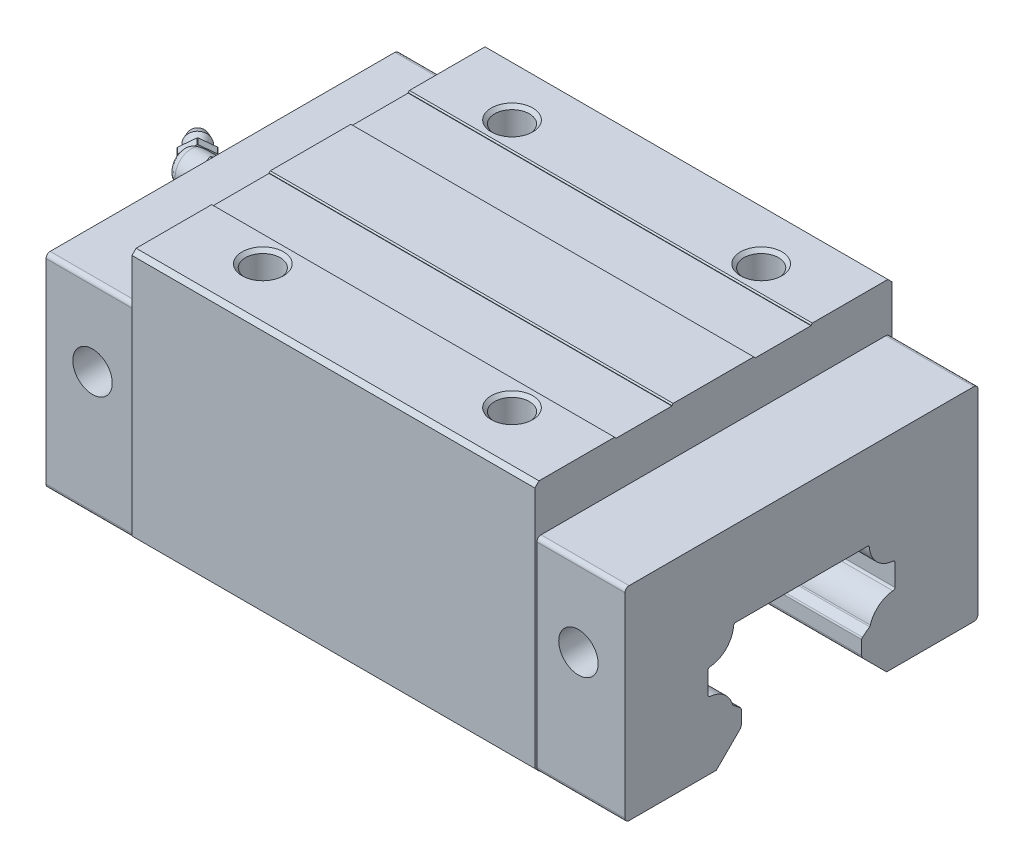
ISO-10303-21;
HEADER;
FILE_DESCRIPTION(('STEP AP214'),'2;1');
FILE_NAME('part.step','',(''),(''),'','','');
FILE_SCHEMA(('AUTOMOTIVE_DESIGN { 1 0 10303 214 1 1 1 1 }'));
ENDSEC;
DATA;
#1=APPLICATION_CONTEXT('core data for automotive mechanical design processes');
#2=APPLICATION_PROTOCOL_DEFINITION('international standard','automotive_design',2000,#1);
#3=PRODUCT_CONTEXT('',#1,'mechanical');
#4=PRODUCT('Part','Part','',(#3));
#5=PRODUCT_RELATED_PRODUCT_CATEGORY('part','',(#4));
#6=PRODUCT_DEFINITION_FORMATION('','',#4);
#7=PRODUCT_DEFINITION_CONTEXT('part definition',#1,'design');
#8=PRODUCT_DEFINITION('design','',#6,#7);
#9=PRODUCT_DEFINITION_SHAPE('','',#8);
#10=(LENGTH_UNIT() NAMED_UNIT(*) SI_UNIT(.MILLI.,.METRE.));
#11=(NAMED_UNIT(*) PLANE_ANGLE_UNIT() SI_UNIT($,.RADIAN.));
#12=(NAMED_UNIT(*) SI_UNIT($,.STERADIAN.) SOLID_ANGLE_UNIT());
#13=UNCERTAINTY_MEASURE_WITH_UNIT(LENGTH_MEASURE(1.E-05),#10,'distance_accuracy_value','');
#14=(GEOMETRIC_REPRESENTATION_CONTEXT(3) GLOBAL_UNCERTAINTY_ASSIGNED_CONTEXT((#13)) GLOBAL_UNIT_ASSIGNED_CONTEXT((#10,
#11,#12)) REPRESENTATION_CONTEXT('',''));
#15=CARTESIAN_POINT('',(0.,0.,0.));
#16=DIRECTION('',(0.,0.,1.));
#17=DIRECTION('',(1.,0.,0.));
#18=AXIS2_PLACEMENT_3D('',#15,#16,#17);
#19=CARTESIAN_POINT('',(-4.67157287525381,42.,-4.32842712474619));
#20=DIRECTION('',(-0.707106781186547,0.,-0.707106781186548));
#21=DIRECTION('',(-0.707106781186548,0.,0.707106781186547));
#22=AXIS2_PLACEMENT_3D('',#19,#20,#21);
#23=PLANE('',#22);
#24=DIRECTION('',(0.,1.,0.));
#25=VECTOR('',#24,1.);
#26=CARTESIAN_POINT('',(-9.97487373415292,42.,0.974873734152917));
#27=LINE('',#26,#25);
#28=CARTESIAN_POINT('',(-9.97487373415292,40.0635083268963,0.97487373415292));
#29=VERTEX_POINT('',#28);
#30=CARTESIAN_POINT('',(-9.97487373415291,43.9364916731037,0.974873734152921));
#31=VERTEX_POINT('',#30);
#32=EDGE_CURVE('E43',#29,#31,#27,.T.);
#33=ORIENTED_EDGE('',*,*,#32,.F.);
#34=CARTESIAN_POINT('',(-7.5,42.,-1.5));
#35=DIRECTION('',(0.707106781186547,0.,0.707106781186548));
#36=DIRECTION('',(0.707106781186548,0.,-0.707106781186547));
#37=AXIS2_PLACEMENT_3D('',#34,#35,#36);
#38=CIRCLE('',#37,4.);
#39=CARTESIAN_POINT('',(-9.9232909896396,39.9371569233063,0.923290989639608));
#40=VERTEX_POINT('',#39);
#41=EDGE_CURVE('E11',#29,#40,#38,.T.);
#42=ORIENTED_EDGE('',*,*,#41,.T.);
#43=DIRECTION('',(-0.612372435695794,0.5,0.612372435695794));
#44=VECTOR('',#43,1.);
#45=CARTESIAN_POINT('',(-6.61611652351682,37.2368602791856,-2.38388347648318));
#46=LINE('',#45,#44);
#47=CARTESIAN_POINT('',(-9.40102717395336,39.5107303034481,0.40102717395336));
#48=VERTEX_POINT('',#47);
#49=EDGE_CURVE('E1562',#48,#40,#46,.T.);
#50=ORIENTED_EDGE('',*,*,#49,.F.);
#51=CARTESIAN_POINT('',(-9.5,40.1669697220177,0.500000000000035));
#52=CARTESIAN_POINT('',(-9.50000017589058,40.14319417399,0.499999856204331));
#53=CARTESIAN_POINT('',(-9.49960542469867,40.1194197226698,0.499602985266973));
#54=CARTESIAN_POINT('',(-9.49800430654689,40.070758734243,0.49799611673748));
#55=CARTESIAN_POINT('',(-9.49675914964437,40.0458747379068,0.496747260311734));
#56=CARTESIAN_POINT('',(-9.49335644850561,39.9950153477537,0.493338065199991));
#57=CARTESIAN_POINT('',(-9.49115761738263,39.9690454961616,0.491136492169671));
#58=CARTESIAN_POINT('',(-9.48574211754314,39.9160482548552,0.485717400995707));
#59=CARTESIAN_POINT('',(-9.48248173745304,39.8890297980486,0.482456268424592));
#60=CARTESIAN_POINT('',(-9.4748334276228,39.8339855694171,0.474808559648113));
#61=CARTESIAN_POINT('',(-9.47039946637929,39.8059725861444,0.470376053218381));
#62=CARTESIAN_POINT('',(-9.46029113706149,39.7490075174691,0.460272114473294));
#63=CARTESIAN_POINT('',(-9.45456858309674,39.720072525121,0.454552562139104));
#64=CARTESIAN_POINT('',(-9.4417683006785,39.6613523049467,0.441758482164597));
#65=CARTESIAN_POINT('',(-9.43464045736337,39.6315889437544,0.434633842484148));
#66=CARTESIAN_POINT('',(-9.41891469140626,39.571321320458,0.418913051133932));
#67=CARTESIAN_POINT('',(-9.41026502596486,39.540844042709,0.410265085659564));
#68=CARTESIAN_POINT('',(-9.40102717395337,39.5107303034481,0.401027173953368));
#69=B_SPLINE_CURVE_WITH_KNOTS('',3,(#51,#52,#53,#54,#55,#56,#57,#58,#59,#60,#61,#62,#63,#64,#65,
#66,#67,#68),.UNSPECIFIED.,.F.,.F.,(4,2,2,2,2,2,2,2,4),(0.,0.0713186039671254,0.146128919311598,
0.224564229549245,0.306756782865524,0.392836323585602,0.482928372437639,0.577152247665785,
0.675618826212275),.UNSPECIFIED.);
#70=CARTESIAN_POINT('',(-9.5,40.1669697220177,0.5));
#71=VERTEX_POINT('',#70);
#72=EDGE_CURVE('E2272',#71,#48,#69,.T.);
#73=ORIENTED_EDGE('',*,*,#72,.F.);
#74=DIRECTION('',(0.,1.,0.));
#75=VECTOR('',#74,1.);
#76=CARTESIAN_POINT('',(-9.5,42.,0.5));
#77=LINE('',#76,#75);
#78=CARTESIAN_POINT('',(-9.5,43.8330302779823,0.5));
#79=VERTEX_POINT('',#78);
#80=EDGE_CURVE('E30',#71,#79,#77,.T.);
#81=ORIENTED_EDGE('',*,*,#80,.T.);
#82=CARTESIAN_POINT('',(-9.40102717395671,44.489269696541,0.401027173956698));
#83=CARTESIAN_POINT('',(-9.41026502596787,44.4591559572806,0.410265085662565));
#84=CARTESIAN_POINT('',(-9.41891469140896,44.4286786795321,0.418913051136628));
#85=CARTESIAN_POINT('',(-9.43464045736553,44.3684110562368,0.434633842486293));
#86=CARTESIAN_POINT('',(-9.44176830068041,44.338647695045,0.441758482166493));
#87=CARTESIAN_POINT('',(-9.45456858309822,44.2799274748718,0.454552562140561));
#88=CARTESIAN_POINT('',(-9.46029113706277,44.2509924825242,0.460272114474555));
#89=CARTESIAN_POINT('',(-9.47039946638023,44.1940274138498,0.470376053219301));
#90=CARTESIAN_POINT('',(-9.47483342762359,44.1660144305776,0.474808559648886));
#91=CARTESIAN_POINT('',(-9.48248173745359,44.1109702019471,0.482456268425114));
#92=CARTESIAN_POINT('',(-9.48574211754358,44.0839517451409,0.485717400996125));
#93=CARTESIAN_POINT('',(-9.4911576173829,44.0309545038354,0.491136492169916));
#94=CARTESIAN_POINT('',(-9.49335644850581,44.0049846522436,0.493338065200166));
#95=CARTESIAN_POINT('',(-9.49675914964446,43.9541252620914,0.496747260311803));
#96=CARTESIAN_POINT('',(-9.49800430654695,43.9292412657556,0.497996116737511));
#97=CARTESIAN_POINT('',(-9.49960542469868,43.8805802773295,0.499602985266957));
#98=CARTESIAN_POINT('',(-9.50000017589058,43.8568058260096,0.499999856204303));
#99=CARTESIAN_POINT('',(-9.5,43.8330302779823,0.500000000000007));
#100=B_SPLINE_CURVE_WITH_KNOTS('',3,(#82,#83,#84,#85,#86,#87,#88,#89,#90,#91,#92,#93,#94,#95,
#96,#97,#98,#99),.UNSPECIFIED.,.F.,.F.,(4,2,2,2,2,2,2,2,4),(0.,0.0984665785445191,
0.192690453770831,0.282782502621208,0.368862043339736,0.451054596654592,0.529489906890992,
0.604300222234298,0.675618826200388),.UNSPECIFIED.);
#101=CARTESIAN_POINT('',(-9.4010271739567,44.489269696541,0.401027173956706));
#102=VERTEX_POINT('',#101);
#103=EDGE_CURVE('E2271',#102,#79,#100,.T.);
#104=ORIENTED_EDGE('',*,*,#103,.F.);
#105=DIRECTION('',(0.612372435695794,0.5,-0.612372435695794));
#106=VECTOR('',#105,1.);
#107=CARTESIAN_POINT('',(-6.61611652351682,46.7631397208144,-2.38388347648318));
#108=LINE('',#107,#106);
#109=CARTESIAN_POINT('',(-9.9232909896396,44.0628430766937,0.923290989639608));
#110=VERTEX_POINT('',#109);
#111=EDGE_CURVE('E1272',#110,#102,#108,.T.);
#112=ORIENTED_EDGE('',*,*,#111,.F.);
#113=CARTESIAN_POINT('',(-7.5,42.,-1.5));
#114=DIRECTION('',(0.707106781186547,0.,0.707106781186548));
#115=DIRECTION('',(0.707106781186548,0.,-0.707106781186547));
#116=AXIS2_PLACEMENT_3D('',#113,#114,#115);
#117=CIRCLE('',#116,4.);
#118=EDGE_CURVE('E1005',#110,#31,#117,.T.);
#119=ORIENTED_EDGE('',*,*,#118,.T.);
#120=EDGE_LOOP('',(#33,#42,#50,#73,#81,#104,#112,#119));
#121=FACE_BOUND('',#120,.T.);
#122=ADVANCED_FACE('F17',(#121),#23,.F.);
#123=CARTESIAN_POINT('',(34.5728534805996,42.,40.5728534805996));
#124=DIRECTION('',(-0.707106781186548,0.,-0.707106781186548));
#125=DIRECTION('',(0.707106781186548,0.,-0.707106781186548));
#126=AXIS2_PLACEMENT_3D('',#123,#124,#125);
#127=CYLINDRICAL_SURFACE('',#126,4.);
#128=DIRECTION('',(0.707106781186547,0.,0.707106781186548));
#129=VECTOR('',#128,1.);
#130=CARTESIAN_POINT('',(32.0979797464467,40.0635083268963,43.0477272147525));
#131=LINE('',#130,#129);
#132=CARTESIAN_POINT('',(-11.389087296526,40.0635083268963,-0.439339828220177));
#133=VERTEX_POINT('',#132);
#134=EDGE_CURVE('E1826',#133,#29,#131,.T.);
#135=ORIENTED_EDGE('',*,*,#134,.F.);
#136=CARTESIAN_POINT('',(-8.9142135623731,42.,-2.91421356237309));
#137=DIRECTION('',(0.707106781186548,0.,0.707106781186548));
#138=DIRECTION('',(0.707106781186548,0.,-0.707106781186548));
#139=AXIS2_PLACEMENT_3D('',#136,#137,#138);
#140=CIRCLE('',#139,4.);
#141=CARTESIAN_POINT('',(-11.3375045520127,39.9371569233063,-0.490922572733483));
#142=VERTEX_POINT('',#141);
#143=EDGE_CURVE('E1001',#133,#142,#140,.T.);
#144=ORIENTED_EDGE('',*,*,#143,.T.);
#145=DIRECTION('',(-0.707106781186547,0.,-0.707106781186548));
#146=VECTOR('',#145,1.);
#147=CARTESIAN_POINT('',(32.14956249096,39.9371569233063,42.9961444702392));
#148=LINE('',#147,#146);
#149=EDGE_CURVE('E1559',#40,#142,#148,.T.);
#150=ORIENTED_EDGE('',*,*,#149,.F.);
#151=ORIENTED_EDGE('',*,*,#41,.F.);
#152=EDGE_LOOP('',(#135,#144,#150,#151));
#153=FACE_BOUND('',#152,.T.);
#154=ADVANCED_FACE('F1798',(#153),#127,.T.);
#155=CARTESIAN_POINT('',(-7.00502525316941,42.,-4.82340187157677));
#156=DIRECTION('',(0.707106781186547,0.,0.707106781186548));
#157=DIRECTION('',(0.,-1.,0.));
#158=AXIS2_PLACEMENT_3D('',#155,#156,#157);
#159=PLANE('',#158);
#160=DIRECTION('',(0.,-1.,0.));
#161=VECTOR('',#160,1.);
#162=CARTESIAN_POINT('',(-6.43933982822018,44.0207259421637,-5.38908729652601));
#163=LINE('',#162,#161);
#164=CARTESIAN_POINT('',(-6.43933982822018,43.9364916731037,-5.38908729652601));
#165=VERTEX_POINT('',#164);
#166=CARTESIAN_POINT('',(-6.43933982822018,40.0635083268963,-5.38908729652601));
#167=VERTEX_POINT('',#166);
#168=EDGE_CURVE('E1006',#165,#167,#163,.T.);
#169=ORIENTED_EDGE('',*,*,#168,.T.);
#170=CARTESIAN_POINT('',(-8.9142135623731,42.,-2.91421356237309));
#171=DIRECTION('',(0.707106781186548,0.,0.707106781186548));
#172=DIRECTION('',(0.707106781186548,0.,-0.707106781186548));
#173=AXIS2_PLACEMENT_3D('',#170,#171,#172);
#174=CIRCLE('',#173,4.);
#175=CARTESIAN_POINT('',(-6.49092257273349,39.9371569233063,-5.3375045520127));
#176=VERTEX_POINT('',#175);
#177=EDGE_CURVE('E1102',#176,#167,#174,.T.);
#178=ORIENTED_EDGE('',*,*,#177,.F.);
#179=DIRECTION('',(-0.612372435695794,-0.5,0.612372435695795));
#180=VECTOR('',#179,1.);
#181=CARTESIAN_POINT('',(-6.43933982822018,39.9792740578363,-5.38908729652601));
#182=LINE('',#181,#180);
#183=CARTESIAN_POINT('',(-8.86263081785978,38.0006652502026,-2.96579630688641));
#184=VERTEX_POINT('',#183);
#185=EDGE_CURVE('E1834',#176,#184,#182,.T.);
#186=ORIENTED_EDGE('',*,*,#185,.T.);
#187=CARTESIAN_POINT('',(-8.9142135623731,42.,-2.91421356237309));
#188=DIRECTION('',(0.707106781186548,0.,0.707106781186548));
#189=DIRECTION('',(0.707106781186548,0.,-0.707106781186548));
#190=AXIS2_PLACEMENT_3D('',#187,#188,#189);
#191=CIRCLE('',#190,4.);
#192=CARTESIAN_POINT('',(-8.96579630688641,38.0006652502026,-2.86263081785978));
#193=VERTEX_POINT('',#192);
#194=EDGE_CURVE('E1016',#193,#184,#191,.T.);
#195=ORIENTED_EDGE('',*,*,#194,.F.);
#196=DIRECTION('',(-0.612372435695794,0.5,0.612372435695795));
#197=VECTOR('',#196,1.);
#198=CARTESIAN_POINT('',(-8.91421356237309,37.9585481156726,-2.91421356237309));
#199=LINE('',#198,#197);
#200=EDGE_CURVE('E896',#193,#142,#199,.T.);
#201=ORIENTED_EDGE('',*,*,#200,.T.);
#202=ORIENTED_EDGE('',*,*,#143,.F.);
#203=DIRECTION('',(0.,1.,0.));
#204=VECTOR('',#203,1.);
#205=CARTESIAN_POINT('',(-11.389087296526,39.9792740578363,-0.439339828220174));
#206=LINE('',#205,#204);
#207=CARTESIAN_POINT('',(-11.389087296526,43.9364916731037,-0.439339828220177));
#208=VERTEX_POINT('',#207);
#209=EDGE_CURVE('E1835',#133,#208,#206,.T.);
#210=ORIENTED_EDGE('',*,*,#209,.T.);
#211=CARTESIAN_POINT('',(-8.9142135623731,42.,-2.91421356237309));
#212=DIRECTION('',(0.707106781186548,0.,0.707106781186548));
#213=DIRECTION('',(0.707106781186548,0.,-0.707106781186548));
#214=AXIS2_PLACEMENT_3D('',#211,#212,#213);
#215=CIRCLE('',#214,4.);
#216=CARTESIAN_POINT('',(-11.3375045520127,44.0628430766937,-0.490922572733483));
#217=VERTEX_POINT('',#216);
#218=EDGE_CURVE('E1012',#217,#208,#215,.T.);
#219=ORIENTED_EDGE('',*,*,#218,.F.);
#220=DIRECTION('',(0.612372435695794,0.5,-0.612372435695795));
#221=VECTOR('',#220,1.);
#222=CARTESIAN_POINT('',(-11.389087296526,44.0207259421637,-0.439339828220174));
#223=LINE('',#222,#221);
#224=CARTESIAN_POINT('',(-8.96579630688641,45.9993347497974,-2.86263081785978));
#225=VERTEX_POINT('',#224);
#226=EDGE_CURVE('E1843',#217,#225,#223,.T.);
#227=ORIENTED_EDGE('',*,*,#226,.T.);
#228=CARTESIAN_POINT('',(-8.9142135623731,42.,-2.91421356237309));
#229=DIRECTION('',(0.707106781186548,0.,0.707106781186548));
#230=DIRECTION('',(0.707106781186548,0.,-0.707106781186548));
#231=AXIS2_PLACEMENT_3D('',#228,#229,#230);
#232=CIRCLE('',#231,4.);
#233=CARTESIAN_POINT('',(-8.86263081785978,45.9993347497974,-2.96579630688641));
#234=VERTEX_POINT('',#233);
#235=EDGE_CURVE('E939',#234,#225,#232,.T.);
#236=ORIENTED_EDGE('',*,*,#235,.F.);
#237=DIRECTION('',(0.612372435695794,-0.5,-0.612372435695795));
#238=VECTOR('',#237,1.);
#239=CARTESIAN_POINT('',(-8.91421356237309,46.0414518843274,-2.91421356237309));
#240=LINE('',#239,#238);
#241=CARTESIAN_POINT('',(-6.49092257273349,44.0628430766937,-5.3375045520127));
#242=VERTEX_POINT('',#241);
#243=EDGE_CURVE('E1347',#234,#242,#240,.T.);
#244=ORIENTED_EDGE('',*,*,#243,.T.);
#245=CARTESIAN_POINT('',(-8.9142135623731,42.,-2.91421356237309));
#246=DIRECTION('',(0.707106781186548,0.,0.707106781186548));
#247=DIRECTION('',(0.707106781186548,0.,-0.707106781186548));
#248=AXIS2_PLACEMENT_3D('',#245,#246,#247);
#249=CIRCLE('',#248,4.);
#250=EDGE_CURVE('E942',#165,#242,#249,.T.);
#251=ORIENTED_EDGE('',*,*,#250,.F.);
#252=EDGE_LOOP('',(#169,#178,#186,#195,#201,#202,#210,#219,#227,#236,#244,#251));
#253=FACE_BOUND('',#252,.T.);
#254=CARTESIAN_POINT('',(-8.9142135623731,42.,-2.91421356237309));
#255=DIRECTION('',(0.707106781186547,0.,0.707106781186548));
#256=DIRECTION('',(0.707106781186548,0.,-0.707106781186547));
#257=AXIS2_PLACEMENT_3D('',#254,#255,#256);
#258=CIRCLE('',#257,2.7);
#259=CARTESIAN_POINT('',(-7.00502525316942,42.,-4.82340187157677));
#260=VERTEX_POINT('',#259);
#261=EDGE_CURVE('E1039',#260,#260,#258,.T.);
#262=ORIENTED_EDGE('',*,*,#261,.T.);
#263=EDGE_LOOP('',(#262));
#264=FACE_BOUND('',#263,.T.);
#265=ADVANCED_FACE('F1799',(#253,#264),#159,.F.);
#266=CARTESIAN_POINT('',(-9.83345237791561,42.,-3.83345237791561));
#267=DIRECTION('',(0.707106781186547,0.,0.707106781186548));
#268=DIRECTION('',(0.707106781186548,0.,-0.707106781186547));
#269=AXIS2_PLACEMENT_3D('',#266,#267,#268);
#270=CONICAL_SURFACE('',#269,2.,0.4939413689);
#271=ORIENTED_EDGE('',*,*,#261,.F.);
#272=EDGE_LOOP('',(#271));
#273=FACE_BOUND('',#272,.T.);
#274=CARTESIAN_POINT('',(-9.83345237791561,42.,-3.83345237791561));
#275=DIRECTION('',(0.707106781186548,0.,0.707106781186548));
#276=DIRECTION('',(0.707106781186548,0.,-0.707106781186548));
#277=AXIS2_PLACEMENT_3D('',#274,#275,#276);
#278=CIRCLE('',#277,2.);
#279=CARTESIAN_POINT('',(-8.41923881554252,42.,-5.24766594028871));
#280=VERTEX_POINT('',#279);
#281=EDGE_CURVE('E1035',#280,#280,#278,.T.);
#282=ORIENTED_EDGE('',*,*,#281,.T.);
#283=EDGE_LOOP('',(#282));
#284=FACE_BOUND('',#283,.T.);
#285=ADVANCED_FACE('F2428',(#273,#284),#270,.T.);
#286=CARTESIAN_POINT('',(-11.601219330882,42.,-5.60121933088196));
#287=DIRECTION('',(-0.707106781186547,0.,-0.707106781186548));
#288=DIRECTION('',(-0.707106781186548,0.,0.707106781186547));
#289=AXIS2_PLACEMENT_3D('',#286,#287,#288);
#290=CONICAL_SURFACE('',#289,2.7,0.2730087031);
#291=CARTESIAN_POINT('',(-11.601219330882,42.,-5.60121933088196));
#292=DIRECTION('',(0.707106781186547,0.,0.707106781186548));
#293=DIRECTION('',(0.707106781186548,0.,-0.707106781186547));
#294=AXIS2_PLACEMENT_3D('',#291,#292,#293);
#295=CIRCLE('',#294,2.7);
#296=CARTESIAN_POINT('',(-9.69203102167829,42.,-7.51040764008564));
#297=VERTEX_POINT('',#296);
#298=EDGE_CURVE('E1040',#297,#297,#295,.T.);
#299=ORIENTED_EDGE('',*,*,#298,.T.);
#300=EDGE_LOOP('',(#299));
#301=FACE_BOUND('',#300,.T.);
#302=ORIENTED_EDGE('',*,*,#281,.F.);
#303=EDGE_LOOP('',(#302));
#304=FACE_BOUND('',#303,.T.);
#305=ADVANCED_FACE('F2424',(#301,#304),#290,.T.);
#306=CARTESIAN_POINT('',(-13.0154328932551,42.,-7.01543289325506));
#307=DIRECTION('',(0.707106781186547,0.,0.707106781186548));
#308=DIRECTION('',(0.707106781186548,0.,-0.707106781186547));
#309=AXIS2_PLACEMENT_3D('',#306,#307,#308);
#310=CONICAL_SURFACE('',#309,2.,0.3366748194);
#311=ORIENTED_EDGE('',*,*,#298,.F.);
#312=EDGE_LOOP('',(#311));
#313=FACE_BOUND('',#312,.T.);
#314=CARTESIAN_POINT('',(-13.0154328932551,42.,-7.01543289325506));
#315=DIRECTION('',(0.707106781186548,0.,0.707106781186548));
#316=DIRECTION('',(0.707106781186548,0.,-0.707106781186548));
#317=AXIS2_PLACEMENT_3D('',#314,#315,#316);
#318=CIRCLE('',#317,2.);
#319=CARTESIAN_POINT('',(-11.601219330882,42.,-8.42964645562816));
#320=VERTEX_POINT('',#319);
#321=EDGE_CURVE('E2031',#320,#320,#318,.T.);
#322=ORIENTED_EDGE('',*,*,#321,.T.);
#323=EDGE_LOOP('',(#322));
#324=FACE_BOUND('',#323,.T.);
#325=ADVANCED_FACE('F2427',(#313,#324),#310,.T.);
#326=CARTESIAN_POINT('',(-13.0154328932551,42.,-7.01543289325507));
#327=DIRECTION('',(0.707106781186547,0.,0.707106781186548));
#328=DIRECTION('',(0.,-1.,0.));
#329=AXIS2_PLACEMENT_3D('',#326,#327,#328);
#330=PLANE('',#329);
#331=ORIENTED_EDGE('',*,*,#321,.F.);
#332=EDGE_LOOP('',(#331));
#333=FACE_BOUND('',#332,.T.);
#334=ADVANCED_FACE('F2638',(#333),#330,.F.);
#335=CARTESIAN_POINT('',(-10.,44.2516660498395,3.9));
#336=DIRECTION('',(0.,0.,1.));
#337=DIRECTION('',(1.,0.,0.));
#338=AXIS2_PLACEMENT_3D('',#335,#336,#337);
#339=PLANE('',#338);
#340=DIRECTION('',(0.,-1.,0.));
#341=VECTOR('',#340,1.);
#342=CARTESIAN_POINT('',(-3.,42.,3.9));
#343=LINE('',#342,#341);
#344=CARTESIAN_POINT('',(-3.,42.,3.9));
#345=VERTEX_POINT('',#344);
#346=CARTESIAN_POINT('',(-3.,39.7550055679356,3.9));
#347=VERTEX_POINT('',#346);
#348=EDGE_CURVE('E1156',#345,#347,#343,.T.);
#349=ORIENTED_EDGE('',*,*,#348,.T.);
#350=DIRECTION('',(1.,0.,0.));
#351=VECTOR('',#350,1.);
#352=CARTESIAN_POINT('',(0.,39.7550055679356,3.9));
#353=LINE('',#352,#351);
#354=CARTESIAN_POINT('',(0.,39.7550055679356,3.9));
#355=VERTEX_POINT('',#354);
#356=EDGE_CURVE('E1152',#347,#355,#353,.T.);
#357=ORIENTED_EDGE('',*,*,#356,.T.);
#358=DIRECTION('',(0.,-1.,0.));
#359=VECTOR('',#358,1.);
#360=CARTESIAN_POINT('',(0.,44.2516660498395,3.9));
#361=LINE('',#360,#359);
#362=CARTESIAN_POINT('',(0.,44.2449944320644,3.9));
#363=VERTEX_POINT('',#362);
#364=EDGE_CURVE('E1131',#363,#355,#361,.T.);
#365=ORIENTED_EDGE('',*,*,#364,.F.);
#366=DIRECTION('',(-1.,0.,0.));
#367=VECTOR('',#366,1.);
#368=CARTESIAN_POINT('',(0.,44.2449944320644,3.9));
#369=LINE('',#368,#367);
#370=CARTESIAN_POINT('',(-3.,44.2449944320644,3.9));
#371=VERTEX_POINT('',#370);
#372=EDGE_CURVE('E1157',#363,#371,#369,.T.);
#373=ORIENTED_EDGE('',*,*,#372,.T.);
#374=DIRECTION('',(0.,-1.,0.));
#375=VECTOR('',#374,1.);
#376=CARTESIAN_POINT('',(-3.,42.,3.9));
#377=LINE('',#376,#375);
#378=EDGE_CURVE('E1388',#371,#345,#377,.T.);
#379=ORIENTED_EDGE('',*,*,#378,.T.);
#380=EDGE_LOOP('',(#349,#357,#365,#373,#379));
#381=FACE_BOUND('',#380,.T.);
#382=ADVANCED_FACE('F2548',(#381),#339,.T.);
#383=CARTESIAN_POINT('',(-10.,46.5033320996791,0.));
#384=DIRECTION('',(0.,0.866025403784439,0.5));
#385=DIRECTION('',(1.,0.,0.));
#386=AXIS2_PLACEMENT_3D('',#383,#384,#385);
#387=PLANE('',#386);
#388=DIRECTION('',(0.,-0.5,0.866025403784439));
#389=VECTOR('',#388,1.);
#390=CARTESIAN_POINT('',(-3.,47.066248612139,-0.975));
#391=LINE('',#390,#389);
#392=CARTESIAN_POINT('',(-3.,45.3774990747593,1.95));
#393=VERTEX_POINT('',#392);
#394=CARTESIAN_POINT('',(-3.,44.2550018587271,3.89422220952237));
#395=VERTEX_POINT('',#394);
#396=EDGE_CURVE('E1384',#393,#395,#391,.T.);
#397=ORIENTED_EDGE('',*,*,#396,.T.);
#398=DIRECTION('',(1.,0.,0.));
#399=VECTOR('',#398,1.);
#400=CARTESIAN_POINT('',(0.,44.2550018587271,3.89422220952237));
#401=LINE('',#400,#399);
#402=CARTESIAN_POINT('',(0.,44.2550018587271,3.89422220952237));
#403=VERTEX_POINT('',#402);
#404=EDGE_CURVE('E1389',#395,#403,#401,.T.);
#405=ORIENTED_EDGE('',*,*,#404,.T.);
#406=DIRECTION('',(0.,-0.5,0.866025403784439));
#407=VECTOR('',#406,1.);
#408=CARTESIAN_POINT('',(0.,46.5033320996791,0.));
#409=LINE('',#408,#407);
#410=CARTESIAN_POINT('',(0.,46.4999962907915,0.00577779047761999));
#411=VERTEX_POINT('',#410);
#412=EDGE_CURVE('E1277',#411,#403,#409,.T.);
#413=ORIENTED_EDGE('',*,*,#412,.F.);
#414=DIRECTION('',(-1.,0.,0.));
#415=VECTOR('',#414,1.);
#416=CARTESIAN_POINT('',(0.,46.4999962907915,0.00577779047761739));
#417=LINE('',#416,#415);
#418=CARTESIAN_POINT('',(-3.,46.4999962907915,0.00577779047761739));
#419=VERTEX_POINT('',#418);
#420=EDGE_CURVE('E1555',#411,#419,#417,.T.);
#421=ORIENTED_EDGE('',*,*,#420,.T.);
#422=DIRECTION('',(0.,-0.5,0.866025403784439));
#423=VECTOR('',#422,1.);
#424=CARTESIAN_POINT('',(-3.,47.066248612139,-0.975));
#425=LINE('',#424,#423);
#426=EDGE_CURVE('E1928',#419,#393,#425,.T.);
#427=ORIENTED_EDGE('',*,*,#426,.T.);
#428=EDGE_LOOP('',(#397,#405,#413,#421,#427));
#429=FACE_BOUND('',#428,.T.);
#430=ADVANCED_FACE('F2401',(#429),#387,.T.);
#431=CARTESIAN_POINT('',(-10.,44.2516660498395,-3.9));
#432=DIRECTION('',(0.,0.866025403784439,-0.5));
#433=DIRECTION('',(-1.,0.,0.));
#434=AXIS2_PLACEMENT_3D('',#431,#432,#433);
#435=PLANE('',#434);
#436=DIRECTION('',(0.,0.5,0.866025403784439));
#437=VECTOR('',#436,1.);
#438=CARTESIAN_POINT('',(-3.,43.6887495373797,-4.875));
#439=LINE('',#438,#437);
#440=CARTESIAN_POINT('',(-3.,45.3774990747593,-1.95));
#441=VERTEX_POINT('',#440);
#442=CARTESIAN_POINT('',(-3.,46.4999962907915,-0.00577779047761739));
#443=VERTEX_POINT('',#442);
#444=EDGE_CURVE('E1413',#441,#443,#439,.T.);
#445=ORIENTED_EDGE('',*,*,#444,.T.);
#446=DIRECTION('',(1.,0.,0.));
#447=VECTOR('',#446,1.);
#448=CARTESIAN_POINT('',(0.,46.4999962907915,-0.00577779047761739));
#449=LINE('',#448,#447);
#450=CARTESIAN_POINT('',(0.,46.4999962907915,-0.00577779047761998));
#451=VERTEX_POINT('',#450);
#452=EDGE_CURVE('E1409',#443,#451,#449,.T.);
#453=ORIENTED_EDGE('',*,*,#452,.T.);
#454=DIRECTION('',(0.,0.5,0.866025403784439));
#455=VECTOR('',#454,1.);
#456=CARTESIAN_POINT('',(0.,44.2516660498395,-3.9));
#457=LINE('',#456,#455);
#458=CARTESIAN_POINT('',(0.,44.2550018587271,-3.89422220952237));
#459=VERTEX_POINT('',#458);
#460=EDGE_CURVE('E1195',#459,#451,#457,.T.);
#461=ORIENTED_EDGE('',*,*,#460,.F.);
#462=DIRECTION('',(-1.,0.,0.));
#463=VECTOR('',#462,1.);
#464=CARTESIAN_POINT('',(0.,44.2550018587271,-3.89422220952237));
#465=LINE('',#464,#463);
#466=CARTESIAN_POINT('',(-3.,44.2550018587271,-3.89422220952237));
#467=VERTEX_POINT('',#466);
#468=EDGE_CURVE('E1260',#459,#467,#465,.T.);
#469=ORIENTED_EDGE('',*,*,#468,.T.);
#470=DIRECTION('',(0.,0.5,0.866025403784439));
#471=VECTOR('',#470,1.);
#472=CARTESIAN_POINT('',(-3.,43.6887495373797,-4.875));
#473=LINE('',#472,#471);
#474=EDGE_CURVE('E1256',#467,#441,#473,.T.);
#475=ORIENTED_EDGE('',*,*,#474,.T.);
#476=EDGE_LOOP('',(#445,#453,#461,#469,#475));
#477=FACE_BOUND('',#476,.T.);
#478=ADVANCED_FACE('F2364',(#477),#435,.T.);
#479=CARTESIAN_POINT('',(-10.,39.7483339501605,-3.9));
#480=DIRECTION('',(0.,0.,-1.));
#481=DIRECTION('',(0.,-1.,0.));
#482=AXIS2_PLACEMENT_3D('',#479,#480,#481);
#483=PLANE('',#482);
#484=DIRECTION('',(0.,1.,0.));
#485=VECTOR('',#484,1.);
#486=CARTESIAN_POINT('',(-3.,42.,-3.9));
#487=LINE('',#486,#485);
#488=CARTESIAN_POINT('',(-3.,42.,-3.9));
#489=VERTEX_POINT('',#488);
#490=CARTESIAN_POINT('',(-3.,44.2449944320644,-3.9));
#491=VERTEX_POINT('',#490);
#492=EDGE_CURVE('E1033',#489,#491,#487,.T.);
#493=ORIENTED_EDGE('',*,*,#492,.T.);
#494=DIRECTION('',(1.,0.,0.));
#495=VECTOR('',#494,1.);
#496=CARTESIAN_POINT('',(0.,44.2449944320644,-3.9));
#497=LINE('',#496,#495);
#498=CARTESIAN_POINT('',(0.,44.2449944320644,-3.9));
#499=VERTEX_POINT('',#498);
#500=EDGE_CURVE('E1029',#491,#499,#497,.T.);
#501=ORIENTED_EDGE('',*,*,#500,.T.);
#502=DIRECTION('',(0.,1.,0.));
#503=VECTOR('',#502,1.);
#504=CARTESIAN_POINT('',(0.,39.7483339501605,-3.9));
#505=LINE('',#504,#503);
#506=CARTESIAN_POINT('',(0.,39.7550055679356,-3.9));
#507=VERTEX_POINT('',#506);
#508=EDGE_CURVE('E1109',#507,#499,#505,.T.);
#509=ORIENTED_EDGE('',*,*,#508,.F.);
#510=DIRECTION('',(-1.,0.,0.));
#511=VECTOR('',#510,1.);
#512=CARTESIAN_POINT('',(0.,39.7550055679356,-3.9));
#513=LINE('',#512,#511);
#514=CARTESIAN_POINT('',(-3.,39.7550055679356,-3.9));
#515=VERTEX_POINT('',#514);
#516=EDGE_CURVE('E1034',#507,#515,#513,.T.);
#517=ORIENTED_EDGE('',*,*,#516,.T.);
#518=DIRECTION('',(0.,1.,0.));
#519=VECTOR('',#518,1.);
#520=CARTESIAN_POINT('',(-3.,42.,-3.9));
#521=LINE('',#520,#519);
#522=EDGE_CURVE('E1080',#515,#489,#521,.T.);
#523=ORIENTED_EDGE('',*,*,#522,.T.);
#524=EDGE_LOOP('',(#493,#501,#509,#517,#523));
#525=FACE_BOUND('',#524,.T.);
#526=ADVANCED_FACE('F1700',(#525),#483,.T.);
#527=CARTESIAN_POINT('',(-10.,37.4966679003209,0.));
#528=DIRECTION('',(0.,-0.866025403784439,-0.5));
#529=DIRECTION('',(0.,0.5,-0.866025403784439));
#530=AXIS2_PLACEMENT_3D('',#527,#528,#529);
#531=PLANE('',#530);
#532=DIRECTION('',(0.,0.5,-0.866025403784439));
#533=VECTOR('',#532,1.);
#534=CARTESIAN_POINT('',(-3.,40.3112504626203,-4.875));
#535=LINE('',#534,#533);
#536=CARTESIAN_POINT('',(-3.,38.6225009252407,-1.95));
#537=VERTEX_POINT('',#536);
#538=CARTESIAN_POINT('',(-3.,39.7449981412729,-3.89422220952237));
#539=VERTEX_POINT('',#538);
#540=EDGE_CURVE('E1216',#537,#539,#535,.T.);
#541=ORIENTED_EDGE('',*,*,#540,.T.);
#542=DIRECTION('',(1.,0.,0.));
#543=VECTOR('',#542,1.);
#544=CARTESIAN_POINT('',(0.,39.7449981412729,-3.89422220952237));
#545=LINE('',#544,#543);
#546=CARTESIAN_POINT('',(0.,39.7449981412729,-3.89422220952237));
#547=VERTEX_POINT('',#546);
#548=EDGE_CURVE('E1212',#539,#547,#545,.T.);
#549=ORIENTED_EDGE('',*,*,#548,.T.);
#550=DIRECTION('',(0.,0.5,-0.866025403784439));
#551=VECTOR('',#550,1.);
#552=CARTESIAN_POINT('',(0.,37.4966679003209,0.));
#553=LINE('',#552,#551);
#554=CARTESIAN_POINT('',(0.,37.5000037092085,-0.00577779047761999));
#555=VERTEX_POINT('',#554);
#556=EDGE_CURVE('E1105',#555,#547,#553,.T.);
#557=ORIENTED_EDGE('',*,*,#556,.F.);
#558=DIRECTION('',(-1.,0.,0.));
#559=VECTOR('',#558,1.);
#560=CARTESIAN_POINT('',(0.,37.5000037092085,-0.00577779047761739));
#561=LINE('',#560,#559);
#562=CARTESIAN_POINT('',(-3.,37.5000037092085,-0.00577779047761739));
#563=VERTEX_POINT('',#562);
#564=EDGE_CURVE('E1027',#555,#563,#561,.T.);
#565=ORIENTED_EDGE('',*,*,#564,.T.);
#566=DIRECTION('',(0.,0.5,-0.866025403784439));
#567=VECTOR('',#566,1.);
#568=CARTESIAN_POINT('',(-3.,40.3112504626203,-4.875));
#569=LINE('',#568,#567);
#570=EDGE_CURVE('E1023',#563,#537,#569,.T.);
#571=ORIENTED_EDGE('',*,*,#570,.T.);
#572=EDGE_LOOP('',(#541,#549,#557,#565,#571));
#573=FACE_BOUND('',#572,.T.);
#574=ADVANCED_FACE('F1696',(#573),#531,.T.);
#575=CARTESIAN_POINT('',(-10.,39.7483339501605,3.9));
#576=DIRECTION('',(0.,-0.866025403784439,0.5));
#577=DIRECTION('',(-1.,0.,0.));
#578=AXIS2_PLACEMENT_3D('',#575,#576,#577);
#579=PLANE('',#578);
#580=DIRECTION('',(0.,-0.5,-0.866025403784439));
#581=VECTOR('',#580,1.);
#582=CARTESIAN_POINT('',(-3.,36.933751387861,-0.975));
#583=LINE('',#582,#581);
#584=CARTESIAN_POINT('',(-3.,38.6225009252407,1.95));
#585=VERTEX_POINT('',#584);
#586=CARTESIAN_POINT('',(-3.,37.5000037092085,0.00577779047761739));
#587=VERTEX_POINT('',#586);
#588=EDGE_CURVE('E1028',#585,#587,#583,.T.);
#589=ORIENTED_EDGE('',*,*,#588,.T.);
#590=DIRECTION('',(1.,0.,0.));
#591=VECTOR('',#590,1.);
#592=CARTESIAN_POINT('',(0.,37.5000037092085,0.00577779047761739));
#593=LINE('',#592,#591);
#594=CARTESIAN_POINT('',(0.,37.5000037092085,0.00577779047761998));
#595=VERTEX_POINT('',#594);
#596=EDGE_CURVE('E1491',#587,#595,#593,.T.);
#597=ORIENTED_EDGE('',*,*,#596,.T.);
#598=DIRECTION('',(0.,-0.5,-0.866025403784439));
#599=VECTOR('',#598,1.);
#600=CARTESIAN_POINT('',(0.,39.7483339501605,3.9));
#601=LINE('',#600,#599);
#602=CARTESIAN_POINT('',(0.,39.7449981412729,3.89422220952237));
#603=VERTEX_POINT('',#602);
#604=EDGE_CURVE('E1108',#603,#595,#601,.T.);
#605=ORIENTED_EDGE('',*,*,#604,.F.);
#606=DIRECTION('',(-1.,0.,0.));
#607=VECTOR('',#606,1.);
#608=CARTESIAN_POINT('',(0.,39.7449981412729,3.89422220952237));
#609=LINE('',#608,#607);
#610=CARTESIAN_POINT('',(-3.,39.7449981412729,3.89422220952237));
#611=VERTEX_POINT('',#610);
#612=EDGE_CURVE('E1255',#603,#611,#609,.T.);
#613=ORIENTED_EDGE('',*,*,#612,.T.);
#614=DIRECTION('',(0.,-0.5,-0.866025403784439));
#615=VECTOR('',#614,1.);
#616=CARTESIAN_POINT('',(-3.,36.933751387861,-0.975));
#617=LINE('',#616,#615);
#618=EDGE_CURVE('E1162',#611,#585,#617,.T.);
#619=ORIENTED_EDGE('',*,*,#618,.T.);
#620=EDGE_LOOP('',(#589,#597,#605,#613,#619));
#621=FACE_BOUND('',#620,.T.);
#622=ADVANCED_FACE('F1699',(#621),#579,.T.);
#623=CARTESIAN_POINT('',(0.,42.,0.));
#624=DIRECTION('',(-1.,0.,0.));
#625=DIRECTION('',(0.,0.,-1.));
#626=AXIS2_PLACEMENT_3D('',#623,#624,#625);
#627=CYLINDRICAL_SURFACE('',#626,4.5);
#628=ORIENTED_EDGE('',*,*,#356,.F.);
#629=CARTESIAN_POINT('',(-3.,42.,0.));
#630=DIRECTION('',(1.,0.,0.));
#631=DIRECTION('',(0.,0.,-1.));
#632=AXIS2_PLACEMENT_3D('',#629,#630,#631);
#633=CIRCLE('',#632,4.5);
#634=EDGE_CURVE('E1158',#347,#611,#633,.T.);
#635=ORIENTED_EDGE('',*,*,#634,.T.);
#636=ORIENTED_EDGE('',*,*,#612,.F.);
#637=CARTESIAN_POINT('',(0.,42.,0.));
#638=DIRECTION('',(-1.,0.,0.));
#639=DIRECTION('',(0.,0.,-1.));
#640=AXIS2_PLACEMENT_3D('',#637,#638,#639);
#641=CIRCLE('',#640,4.5);
#642=EDGE_CURVE('E1163',#603,#355,#641,.T.);
#643=ORIENTED_EDGE('',*,*,#642,.T.);
#644=EDGE_LOOP('',(#628,#635,#636,#643));
#645=FACE_BOUND('',#644,.T.);
#646=ADVANCED_FACE('F1738',(#645),#627,.T.);
#647=CARTESIAN_POINT('',(-3.,42.,-3.9));
#648=DIRECTION('',(1.,0.,0.));
#649=DIRECTION('',(0.,1.,0.));
#650=AXIS2_PLACEMENT_3D('',#647,#648,#649);
#651=PLANE('',#650);
#652=ORIENTED_EDGE('',*,*,#378,.F.);
#653=CARTESIAN_POINT('',(-3.,42.,0.));
#654=DIRECTION('',(1.,0.,0.));
#655=DIRECTION('',(0.,0.,-1.));
#656=AXIS2_PLACEMENT_3D('',#653,#654,#655);
#657=CIRCLE('',#656,4.5);
#658=EDGE_CURVE('E1571',#395,#371,#657,.T.);
#659=ORIENTED_EDGE('',*,*,#658,.F.);
#660=ORIENTED_EDGE('',*,*,#396,.F.);
#661=CARTESIAN_POINT('',(-3.,42.,0.));
#662=DIRECTION('',(1.,0.,0.));
#663=DIRECTION('',(0.,0.,-1.));
#664=AXIS2_PLACEMENT_3D('',#661,#662,#663);
#665=CIRCLE('',#664,3.9);
#666=EDGE_CURVE('E1368',#393,#345,#665,.T.);
#667=ORIENTED_EDGE('',*,*,#666,.T.);
#668=EDGE_LOOP('',(#652,#659,#660,#667));
#669=FACE_BOUND('',#668,.T.);
#670=ADVANCED_FACE('F1741',(#669),#651,.F.);
#671=CARTESIAN_POINT('',(0.,42.,0.));
#672=DIRECTION('',(-1.,0.,0.));
#673=DIRECTION('',(0.,0.,-1.));
#674=AXIS2_PLACEMENT_3D('',#671,#672,#673);
#675=CYLINDRICAL_SURFACE('',#674,3.9);
#676=CARTESIAN_POINT('',(-7.5,42.,0.));
#677=DIRECTION('',(1.,0.,0.));
#678=DIRECTION('',(0.,0.,-1.));
#679=AXIS2_PLACEMENT_3D('',#676,#677,#678);
#680=CIRCLE('',#679,3.9);
#681=CARTESIAN_POINT('',(-7.5,45.6,-1.5));
#682=VERTEX_POINT('',#681);
#683=CARTESIAN_POINT('',(-7.5,38.4,-1.5));
#684=VERTEX_POINT('',#683);
#685=EDGE_CURVE('E2282',#682,#684,#680,.T.);
#686=ORIENTED_EDGE('',*,*,#685,.T.);
#687=CARTESIAN_POINT('',(-9.,42.,0.));
#688=DIRECTION('',(-0.707106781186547,0.,-0.707106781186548));
#689=DIRECTION('',(0.707106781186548,0.,-0.707106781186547));
#690=AXIS2_PLACEMENT_3D('',#687,#688,#689);
#691=ELLIPSE('',#690,5.5154328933,3.9);
#692=EDGE_CURVE('E906',#682,#684,#691,.T.);
#693=ORIENTED_EDGE('',*,*,#692,.F.);
#694=EDGE_LOOP('',(#686,#693));
#695=FACE_BOUND('',#694,.T.);
#696=CARTESIAN_POINT('',(-3.,42.,0.));
#697=DIRECTION('',(1.,0.,0.));
#698=DIRECTION('',(0.,0.,-1.));
#699=AXIS2_PLACEMENT_3D('',#696,#697,#698);
#700=CIRCLE('',#699,3.9);
#701=EDGE_CURVE('E990',#345,#585,#700,.T.);
#702=ORIENTED_EDGE('',*,*,#701,.F.);
#703=ORIENTED_EDGE('',*,*,#666,.F.);
#704=CARTESIAN_POINT('',(-3.,42.,0.));
#705=DIRECTION('',(1.,0.,0.));
#706=DIRECTION('',(0.,0.,-1.));
#707=AXIS2_PLACEMENT_3D('',#704,#705,#706);
#708=CIRCLE('',#707,3.9);
#709=EDGE_CURVE('E993',#441,#393,#708,.T.);
#710=ORIENTED_EDGE('',*,*,#709,.F.);
#711=CARTESIAN_POINT('',(-3.,42.,0.));
#712=DIRECTION('',(1.,0.,0.));
#713=DIRECTION('',(0.,0.,-1.));
#714=AXIS2_PLACEMENT_3D('',#711,#712,#713);
#715=CIRCLE('',#714,3.9);
#716=EDGE_CURVE('E1151',#489,#441,#715,.T.);
#717=ORIENTED_EDGE('',*,*,#716,.F.);
#718=CARTESIAN_POINT('',(-3.,42.,0.));
#719=DIRECTION('',(1.,0.,0.));
#720=DIRECTION('',(0.,0.,-1.));
#721=AXIS2_PLACEMENT_3D('',#718,#719,#720);
#722=CIRCLE('',#721,3.9);
#723=EDGE_CURVE('E1147',#537,#489,#722,.T.);
#724=ORIENTED_EDGE('',*,*,#723,.F.);
#725=CARTESIAN_POINT('',(-3.,42.,0.));
#726=DIRECTION('',(1.,0.,0.));
#727=DIRECTION('',(0.,0.,-1.));
#728=AXIS2_PLACEMENT_3D('',#725,#726,#727);
#729=CIRCLE('',#728,3.9);
#730=EDGE_CURVE('E994',#585,#537,#729,.T.);
#731=ORIENTED_EDGE('',*,*,#730,.F.);
#732=EDGE_LOOP('',(#702,#703,#710,#717,#724,#731));
#733=FACE_BOUND('',#732,.T.);
#734=ADVANCED_FACE('F1631',(#695,#733),#675,.T.);
#735=CARTESIAN_POINT('',(-7.5,45.5636213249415,-1.58448826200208));
#736=CARTESIAN_POINT('',(-7.50000000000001,46.8352380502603,1.27546380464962));
#737=CARTESIAN_POINT('',(-7.50000000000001,45.1299097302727,3.89999999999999));
#738=CARTESIAN_POINT('',(-7.5,42.,3.9));
#739=CARTESIAN_POINT('',(-7.50000000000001,38.8700902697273,3.90000000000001));
#740=CARTESIAN_POINT('',(-7.50000000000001,37.1647619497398,1.27546380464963));
#741=CARTESIAN_POINT('',(-7.5,38.4363786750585,-1.58448826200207));
#742=CARTESIAN_POINT('',(-8.67157287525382,45.5636213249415,-1.58448826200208));
#743=CARTESIAN_POINT('',(-8.67157287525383,46.8352380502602,1.27546380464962));
#744=CARTESIAN_POINT('',(-8.67157287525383,45.1299097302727,3.89999999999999));
#745=CARTESIAN_POINT('',(-8.67157287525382,42.,3.9));
#746=CARTESIAN_POINT('',(-8.67157287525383,38.8700902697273,3.90000000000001));
#747=CARTESIAN_POINT('',(-8.67157287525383,37.1647619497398,1.27546380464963));
#748=CARTESIAN_POINT('',(-8.67157287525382,38.4363786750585,-1.58448826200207));
#749=CARTESIAN_POINT('',(-9.50000000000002,44.8066468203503,-1.2479156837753));
#750=CARTESIAN_POINT('',(-9.50000000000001,45.808150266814,1.00453333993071));
#751=CARTESIAN_POINT('',(-9.50000000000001,44.4650630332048,3.0715728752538));
#752=CARTESIAN_POINT('',(-9.50000000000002,42.,3.0715728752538));
#753=CARTESIAN_POINT('',(-9.50000000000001,39.5349369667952,3.07157287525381));
#754=CARTESIAN_POINT('',(-9.50000000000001,38.191849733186,1.00453333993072));
#755=CARTESIAN_POINT('',(-9.50000000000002,39.1933531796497,-1.24791568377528));
#756=CARTESIAN_POINT('',(-9.5,43.7361232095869,-0.771930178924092));
#757=CARTESIAN_POINT('',(-9.5,44.3556287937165,0.621379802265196));
#758=CARTESIAN_POINT('',(-9.5,43.5248278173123,1.89999999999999));
#759=CARTESIAN_POINT('',(-9.5,42.,1.9));
#760=CARTESIAN_POINT('',(-9.5,40.4751721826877,1.9));
#761=CARTESIAN_POINT('',(-9.5,39.6443712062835,0.6213798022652));
#762=CARTESIAN_POINT('',(-9.5,40.2638767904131,-0.771930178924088));
#763=(BOUNDED_SURFACE() B_SPLINE_SURFACE(3,3,((#735,#736,#737,#738,#739,#740,#741),(#742,#743,
#744,#745,#746,#747,#748),(#749,#750,#751,#752,#753,#754,#755),(#756,#757,#758,#759,#760,#761,
#762)),.UNSPECIFIED.,.F.,.F.,.F.) B_SPLINE_SURFACE_WITH_KNOTS((4,4),(4,3,4),(1.1524181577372,
5.13076714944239),(-1.5707963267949,-0.785398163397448,0.),
.UNSPECIFIED.) GEOMETRIC_REPRESENTATION_ITEM() RATIONAL_B_SPLINE_SURFACE(((1.,0.696566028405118,
0.696566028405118,1.,0.696566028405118,0.696566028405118,1.),(0.804737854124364,
0.560553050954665,0.560553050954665,0.804737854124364,0.560553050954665,0.560553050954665,
0.804737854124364),(0.804737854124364,0.560553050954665,0.560553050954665,0.804737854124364,
0.560553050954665,0.560553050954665,0.804737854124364),(1.,0.696566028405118,0.696566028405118,
1.,0.696566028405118,0.696566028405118,1.))) REPRESENTATION_ITEM('') SURFACE());
#764=CARTESIAN_POINT('',(-7.5,45.6,-1.50000000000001));
#765=CARTESIAN_POINT('',(-7.51620648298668,45.6067528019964,-1.48379351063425));
#766=CARTESIAN_POINT('',(-7.53247856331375,45.6131909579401,-1.46752128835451));
#767=CARTESIAN_POINT('',(-7.56536044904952,45.625510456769,-1.43463899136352));
#768=CARTESIAN_POINT('',(-7.5819718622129,45.6313832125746,-1.41802730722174));
#769=CARTESIAN_POINT('',(-7.61552409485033,45.6425360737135,-1.38447455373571));
#770=CARTESIAN_POINT('',(-7.63246637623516,45.6478073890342,-1.36753202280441));
#771=CARTESIAN_POINT('',(-7.66667016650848,45.6577210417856,-1.33332785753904));
#772=CARTESIAN_POINT('',(-7.68393297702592,45.6623544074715,-1.31606492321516));
#773=CARTESIAN_POINT('',(-7.71876580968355,45.6709553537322,-1.28123202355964));
#774=CARTESIAN_POINT('',(-7.73633696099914,45.6749138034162,-1.26366093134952));
#775=CARTESIAN_POINT('',(-7.77177246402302,45.6821278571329,-1.22822571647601));
#776=CARTESIAN_POINT('',(-7.78963776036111,45.6853741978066,-1.21036065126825));
#777=CARTESIAN_POINT('',(-7.82564549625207,45.6911268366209,-1.17435346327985));
#778=CARTESIAN_POINT('',(-7.84378868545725,45.6936237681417,-1.15621059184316));
#779=CARTESIAN_POINT('',(-7.88033383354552,45.6978407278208,-1.11966595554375));
#780=CARTESIAN_POINT('',(-7.89873633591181,45.699551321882,-1.10126364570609));
#781=CARTESIAN_POINT('',(-7.91715350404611,45.7008474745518,-1.082846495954));
#782=B_SPLINE_CURVE_WITH_KNOTS('',3,(#764,#765,#766,#767,#768,#769,#770,#771,#772,#773,#774,
#775,#776,#777,#778,#779,#780,#781),.UNSPECIFIED.,.F.,.F.,(4,2,2,2,2,2,2,2,4),(0.,
0.0716785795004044,0.144314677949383,0.217904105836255,0.292440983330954,0.367917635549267,
0.444324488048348,0.521649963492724,0.599880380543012),.UNSPECIFIED.);
#783=CARTESIAN_POINT('',(-7.917153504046,45.7008474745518,-1.082846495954));
#784=VERTEX_POINT('',#783);
#785=EDGE_CURVE('E1611',#682,#784,#782,.T.);
#786=CARTESIAN_POINT('',(-7.917153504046,45.7008474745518,-1.08284649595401));
#787=CARTESIAN_POINT('',(-7.93547658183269,45.702137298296,-1.06452337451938));
#788=CARTESIAN_POINT('',(-7.95381268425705,45.7030176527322,-1.04618412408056));
#789=CARTESIAN_POINT('',(-7.99061051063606,45.7039554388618,-1.00937567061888));
#790=CARTESIAN_POINT('',(-8.00907228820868,45.7040075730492,-0.990906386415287));
#791=CARTESIAN_POINT('',(-8.04609769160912,45.7032659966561,-0.95386351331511));
#792=CARTESIAN_POINT('',(-8.06466125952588,45.7024671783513,-0.935289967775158));
#793=CARTESIAN_POINT('',(-8.10186471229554,45.7000026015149,-0.898065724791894));
#794=CARTESIAN_POINT('',(-8.12050443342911,45.6983319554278,-0.879415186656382));
#795=CARTESIAN_POINT('',(-8.15783313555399,45.6941043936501,-0.842065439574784));
#796=CARTESIAN_POINT('',(-8.17652185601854,45.6915428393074,-0.823366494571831));
#797=CARTESIAN_POINT('',(-8.21391996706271,45.6855161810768,-0.785949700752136));
#798=CARTESIAN_POINT('',(-8.23262901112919,45.6820467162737,-0.767232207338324));
#799=CARTESIAN_POINT('',(-8.27003772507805,45.6741891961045,-0.729809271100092));
#800=CARTESIAN_POINT('',(-8.28873697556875,45.6697970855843,-0.71110425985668));
#801=CARTESIAN_POINT('',(-8.32609467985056,45.6600816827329,-0.673738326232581));
#802=CARTESIAN_POINT('',(-8.3447526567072,45.6547546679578,-0.655077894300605));
#803=CARTESIAN_POINT('',(-8.38199511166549,45.6431595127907,-0.617834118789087));
#804=CARTESIAN_POINT('',(-8.40057907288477,45.6368880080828,-0.599251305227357));
#805=CARTESIAN_POINT('',(-8.43763962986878,45.6233967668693,-0.562196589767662));
#806=CARTESIAN_POINT('',(-8.45611568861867,45.616174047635,-0.543725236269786));
#807=CARTESIAN_POINT('',(-8.49292554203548,45.6007762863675,-0.506927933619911));
#808=CARTESIAN_POINT('',(-8.51125880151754,45.59259866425,-0.488602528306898));
#809=CARTESIAN_POINT('',(-8.54774727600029,45.5752901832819,-0.452132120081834));
#810=CARTESIAN_POINT('',(-8.56590198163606,45.5661571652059,-0.433987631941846));
#811=CARTESIAN_POINT('',(-8.60199685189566,45.5469403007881,-0.397914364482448));
#812=CARTESIAN_POINT('',(-8.61993655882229,45.5368547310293,-0.379986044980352));
#813=CARTESIAN_POINT('',(-8.65556440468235,45.5157386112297,-0.34438059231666));
#814=CARTESIAN_POINT('',(-8.67325216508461,45.5047067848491,-0.326703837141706));
#815=CARTESIAN_POINT('',(-8.70833874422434,45.4817075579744,-0.291636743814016));
#816=CARTESIAN_POINT('',(-8.72573729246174,45.4697393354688,-0.274246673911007));
#817=CARTESIAN_POINT('',(-8.76020798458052,45.4448802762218,-0.239788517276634));
#818=CARTESIAN_POINT('',(-8.77727999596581,45.4319890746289,-0.222720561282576));
#819=CARTESIAN_POINT('',(-8.81321044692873,45.4036020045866,-0.186788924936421));
#820=CARTESIAN_POINT('',(-8.83201987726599,45.3879834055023,-0.16797300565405));
#821=CARTESIAN_POINT('',(-8.86884154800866,45.3558696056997,-0.13112952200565));
#822=CARTESIAN_POINT('',(-8.88686173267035,45.3393924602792,-0.113094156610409));
#823=CARTESIAN_POINT('',(-8.92208398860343,45.3056403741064,-0.0778378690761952));
#824=CARTESIAN_POINT('',(-8.93929470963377,45.288383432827,-0.0606083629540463));
#825=CARTESIAN_POINT('',(-8.97288114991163,45.2531519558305,-0.0269841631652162));
#826=CARTESIAN_POINT('',(-8.98926620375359,45.2351952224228,-0.0105801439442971));
#827=CARTESIAN_POINT('',(-9.02118907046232,45.1986444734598,0.0213780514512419));
#828=CARTESIAN_POINT('',(-9.03673686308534,45.1800679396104,0.0369422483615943));
#829=CARTESIAN_POINT('',(-9.0669773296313,45.1423574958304,0.0672110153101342));
#830=CARTESIAN_POINT('',(-9.0816805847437,45.123240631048,0.0819262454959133));
#831=CARTESIAN_POINT('',(-9.11022835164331,45.0845283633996,0.110492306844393));
#832=CARTESIAN_POINT('',(-9.12408399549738,45.0649494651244,0.124354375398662));
#833=CARTESIAN_POINT('',(-9.15093696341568,45.0253903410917,0.151214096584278));
#834=CARTESIAN_POINT('',(-9.1639459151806,45.0054259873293,0.164223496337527));
#835=CARTESIAN_POINT('',(-9.18910974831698,44.9651710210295,0.189382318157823));
#836=CARTESIAN_POINT('',(-9.20127669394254,44.944895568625,0.201543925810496));
#837=CARTESIAN_POINT('',(-9.22476433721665,44.9040908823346,0.225015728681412));
#838=CARTESIAN_POINT('',(-9.23609747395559,44.8835760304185,0.236338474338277));
#839=CARTESIAN_POINT('',(-9.25792862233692,44.8423620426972,0.258144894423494));
#840=CARTESIAN_POINT('',(-9.26843938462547,44.8216764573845,0.268641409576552));
#841=CARTESIAN_POINT('',(-9.28863992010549,44.7801872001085,0.288811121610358));
#842=CARTESIAN_POINT('',(-9.29834269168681,44.7593962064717,0.298497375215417));
#843=CARTESIAN_POINT('',(-9.31694409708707,44.7177587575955,0.317065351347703));
#844=CARTESIAN_POINT('',(-9.32585591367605,44.696924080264,0.325960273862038));
#845=CARTESIAN_POINT('',(-9.34289467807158,44.6552581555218,0.342967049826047));
#846=CARTESIAN_POINT('',(-9.35103493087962,44.6344377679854,0.351092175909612));
#847=CARTESIAN_POINT('',(-9.36655194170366,44.5928552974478,0.366583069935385));
#848=CARTESIAN_POINT('',(-9.37394206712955,44.5721031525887,0.373962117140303));
#849=CARTESIAN_POINT('',(-9.3879820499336,44.5307084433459,0.387986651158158));
#850=CARTESIAN_POINT('',(-9.39464527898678,44.5100748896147,0.394645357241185));
#851=CARTESIAN_POINT('',(-9.40102717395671,44.489269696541,0.40102717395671));
#852=B_SPLINE_CURVE_WITH_KNOTS('',3,(#786,#787,#788,#789,#790,#791,#792,#793,#794,#795,#796,
#797,#798,#799,#800,#801,#802,#803,#804,#805,#806,#807,#808,#809,#810,#811,#812,#813,#814,#815,
#816,#817,#818,#819,#820,#821,#822,#823,#824,#825,#826,#827,#828,#829,#830,#831,#832,#833,#834,
#835,#836,#837,#838,#839,#840,#841,#842,#843,#844,#845,#846,#847,#848,#849,#850,#851),
.UNSPECIFIED.,.F.,.F.,(4,2,2,2,2,2,2,2,2,2,2,2,2,2,2,2,2,2,2,2,2,2,2,2,2,2,2,2,2,2,2,2,4),(0.,
0.0778316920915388,0.156161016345,0.234963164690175,0.314211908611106,0.393879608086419,
0.473937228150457,0.554354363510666,0.635099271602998,0.716138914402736,0.797439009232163,
0.878964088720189,0.960677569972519,1.0425418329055,1.12451830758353,1.20656757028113,
1.28864944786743,1.38117279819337,1.47221367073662,1.56172869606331,1.64967995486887,
1.73603491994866,1.82076635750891,1.90385219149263,1.98527533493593,2.06502349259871,
2.14308893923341,2.21946827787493,2.29416218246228,2.36717512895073,2.43851511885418,
2.50819339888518,2.57622418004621),.UNSPECIFIED.);
#853=EDGE_CURVE('E2296',#784,#102,#852,.T.);
#854=CARTESIAN_POINT('',(-9.5,42.,0.));
#855=DIRECTION('',(1.,0.,0.));
#856=DIRECTION('',(0.,0.,-1.));
#857=AXIS2_PLACEMENT_3D('',#854,#855,#856);
#858=CIRCLE('',#857,1.9);
#859=EDGE_CURVE('E2267',#79,#71,#858,.T.);
#860=CARTESIAN_POINT('',(-9.40102717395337,39.5107303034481,0.401027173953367));
#861=CARTESIAN_POINT('',(-9.39463790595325,39.4899010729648,0.394637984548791));
#862=CARTESIAN_POINT('',(-9.38796665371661,39.4692438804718,0.387971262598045));
#863=CARTESIAN_POINT('',(-9.37390896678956,39.4278015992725,0.373929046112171));
#864=CARTESIAN_POINT('',(-9.36650911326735,39.40702555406,0.36654028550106));
#865=CARTESIAN_POINT('',(-9.35097090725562,39.3653951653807,0.351028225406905));
#866=CARTESIAN_POINT('',(-9.34281914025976,39.3445507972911,0.342891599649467));
#867=CARTESIAN_POINT('',(-9.32575553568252,39.3028369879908,0.325860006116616));
#868=CARTESIAN_POINT('',(-9.31683034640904,39.2819784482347,0.31695171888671));
#869=CARTESIAN_POINT('',(-9.2982003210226,39.2402935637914,0.298355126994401));
#870=CARTESIAN_POINT('',(-9.28848225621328,39.2194790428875,0.288653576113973));
#871=CARTESIAN_POINT('',(-9.26824920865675,39.1779432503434,0.268451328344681));
#872=CARTESIAN_POINT('',(-9.25772118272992,39.1572347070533,0.257937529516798));
#873=CARTESIAN_POINT('',(-9.23585354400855,39.1159755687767,0.236094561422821));
#874=CARTESIAN_POINT('',(-9.22450113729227,39.0954385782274,0.224752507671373));
#875=CARTESIAN_POINT('',(-9.20097296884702,39.0545906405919,0.201240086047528));
#876=CARTESIAN_POINT('',(-9.18878472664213,39.034294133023,0.189057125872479));
#877=CARTESIAN_POINT('',(-9.16357630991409,38.9939983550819,0.163853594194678));
#878=CARTESIAN_POINT('',(-9.15054403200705,38.9740143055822,0.150820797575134));
#879=CARTESIAN_POINT('',(-9.12364243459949,38.9344173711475,0.123912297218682));
#880=CARTESIAN_POINT('',(-9.10976145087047,38.9148204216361,0.110024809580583));
#881=CARTESIAN_POINT('',(-9.0811610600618,38.8760739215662,0.0814059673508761));
#882=CARTESIAN_POINT('',(-9.06643048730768,38.8569409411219,0.0666633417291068));
#883=CARTESIAN_POINT('',(-9.03613349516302,38.8192004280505,0.0363379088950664));
#884=CARTESIAN_POINT('',(-9.02055646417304,38.8006100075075,0.0207444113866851));
#885=CARTESIAN_POINT('',(-8.9885733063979,38.7640339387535,-0.0112741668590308));
#886=CARTESIAN_POINT('',(-8.97215717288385,38.7460658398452,-0.0277092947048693));
#887=CARTESIAN_POINT('',(-8.93850685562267,38.7108143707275,-0.0613973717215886));
#888=CARTESIAN_POINT('',(-8.92126331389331,38.6935488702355,-0.0786596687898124));
#889=CARTESIAN_POINT('',(-8.88597382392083,38.6597826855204,-0.113983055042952));
#890=CARTESIAN_POINT('',(-8.8679192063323,38.6433000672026,-0.132052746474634));
#891=CARTESIAN_POINT('',(-8.83102720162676,38.6111785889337,-0.168966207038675));
#892=CARTESIAN_POINT('',(-8.81218185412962,38.5955578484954,-0.187817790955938));
#893=CARTESIAN_POINT('',(-8.77623042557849,38.5672075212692,-0.223769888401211));
#894=CARTESIAN_POINT('',(-8.75917442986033,38.5543522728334,-0.240821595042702));
#895=CARTESIAN_POINT('',(-8.72473731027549,38.5295628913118,-0.275245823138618));
#896=CARTESIAN_POINT('',(-8.70735631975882,38.517628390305,-0.292618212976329));
#897=CARTESIAN_POINT('',(-8.67230623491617,38.4946942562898,-0.327648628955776));
#898=CARTESIAN_POINT('',(-8.65463741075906,38.4836938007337,-0.345306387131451));
#899=CARTESIAN_POINT('',(-8.61904866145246,38.4626379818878,-0.380872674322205));
#900=CARTESIAN_POINT('',(-8.60112911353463,38.452581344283,-0.398780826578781));
#901=CARTESIAN_POINT('',(-8.56507562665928,38.4334198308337,-0.434812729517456));
#902=CARTESIAN_POINT('',(-8.54694214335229,38.4243132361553,-0.452936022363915));
#903=CARTESIAN_POINT('',(-8.51049702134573,38.407055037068,-0.489363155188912));
#904=CARTESIAN_POINT('',(-8.49218588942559,38.3989012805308,-0.507666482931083));
#905=CARTESIAN_POINT('',(-8.45542104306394,38.383548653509,-0.544418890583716));
#906=CARTESIAN_POINT('',(-8.43696786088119,38.3763472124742,-0.562867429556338));
#907=CARTESIAN_POINT('',(-8.39995365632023,38.3628959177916,-0.59987592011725));
#908=CARTESIAN_POINT('',(-8.38139316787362,38.3566430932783,-0.618435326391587));
#909=CARTESIAN_POINT('',(-8.3441981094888,38.3450826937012,-0.655631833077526));
#910=CARTESIAN_POINT('',(-8.32556405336,38.3397717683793,-0.674268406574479));
#911=CARTESIAN_POINT('',(-8.2882544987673,38.3300859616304,-0.711586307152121));
#912=CARTESIAN_POINT('',(-8.26957947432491,38.3257073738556,-0.730267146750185));
#913=CARTESIAN_POINT('',(-8.23221938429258,38.3178743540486,-0.767641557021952));
#914=CARTESIAN_POINT('',(-8.21353473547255,38.3144158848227,-0.786334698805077));
#915=CARTESIAN_POINT('',(-8.1761854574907,38.3084087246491,-0.823702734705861));
#916=CARTESIAN_POINT('',(-8.15752117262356,38.3058556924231,-0.842377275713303));
#917=CARTESIAN_POINT('',(-8.12024126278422,38.3016427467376,-0.87967828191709));
#918=CARTESIAN_POINT('',(-8.10162589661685,38.2999782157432,-0.898304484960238));
#919=CARTESIAN_POINT('',(-8.0644709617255,38.297523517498,-0.935480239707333));
#920=CARTESIAN_POINT('',(-8.04593155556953,38.2967284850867,-0.954029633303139));
#921=CARTESIAN_POINT('',(-8.00895417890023,38.2959922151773,-0.991024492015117));
#922=CARTESIAN_POINT('',(-7.99051626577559,38.296045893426,-1.00946991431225));
#923=CARTESIAN_POINT('',(-7.95376577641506,38.2969845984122,-1.04623103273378));
#924=CARTESIAN_POINT('',(-7.93545314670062,38.2978643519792,-1.06454680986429));
#925=CARTESIAN_POINT('',(-7.917153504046,38.2991525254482,-1.082846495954));
#926=B_SPLINE_CURVE_WITH_KNOTS('',3,(#860,#861,#862,#863,#864,#865,#866,#867,#868,#869,#870,
#871,#872,#873,#874,#875,#876,#877,#878,#879,#880,#881,#882,#883,#884,#885,#886,#887,#888,#889,
#890,#891,#892,#893,#894,#895,#896,#897,#898,#899,#900,#901,#902,#903,#904,#905,#906,#907,#908,
#909,#910,#911,#912,#913,#914,#915,#916,#917,#918,#919,#920,#921,#922,#923,#924,#925),
.UNSPECIFIED.,.F.,.F.,(4,2,2,2,2,2,2,2,2,2,2,2,2,2,2,2,2,2,2,2,2,2,2,2,2,2,2,2,2,2,2,2,4),(0.,
0.0681093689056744,0.137870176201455,0.209296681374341,0.282400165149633,0.357188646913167,
0.433666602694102,0.511834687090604,0.591689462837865,0.673223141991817,0.756423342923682,
0.841272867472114,0.927749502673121,1.01582585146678,1.10546919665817,1.19664140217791,
1.28929885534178,1.37126966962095,1.45320755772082,1.53507252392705,1.61682531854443,
1.69842754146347,1.77984173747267,1.86103148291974,1.94196146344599,2.02259754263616,
2.10290682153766,2.18285768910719,2.26241986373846,2.34156442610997,2.42026384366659,
2.49849198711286,2.57622413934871),.UNSPECIFIED.);
#927=CARTESIAN_POINT('',(-7.91715350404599,38.2991525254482,-1.082846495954));
#928=VERTEX_POINT('',#927);
#929=EDGE_CURVE('E1677',#48,#928,#926,.T.);
#930=CARTESIAN_POINT('',(-7.9171535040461,38.2991525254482,-1.082846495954));
#931=CARTESIAN_POINT('',(-7.8987363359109,38.3004486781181,-1.10126364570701));
#932=CARTESIAN_POINT('',(-7.88033383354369,38.3021592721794,-1.11966595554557));
#933=CARTESIAN_POINT('',(-7.84378868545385,38.3063762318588,-1.15621059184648));
#934=CARTESIAN_POINT('',(-7.82564549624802,38.3088731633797,-1.17435346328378));
#935=CARTESIAN_POINT('',(-7.78963776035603,38.3146258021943,-1.21036065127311));
#936=CARTESIAN_POINT('',(-7.77177246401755,38.3178721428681,-1.22822571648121));
#937=CARTESIAN_POINT('',(-7.73633696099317,38.3250861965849,-1.26366093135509));
#938=CARTESIAN_POINT('',(-7.71876580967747,38.3290446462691,-1.28123202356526));
#939=CARTESIAN_POINT('',(-7.68393297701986,38.3376455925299,-1.31606492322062));
#940=CARTESIAN_POINT('',(-7.66667016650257,38.3422789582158,-1.33332785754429));
#941=CARTESIAN_POINT('',(-7.63246637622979,38.3521926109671,-1.36753202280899));
#942=CARTESIAN_POINT('',(-7.61552409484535,38.3574639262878,-1.38447455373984));
#943=CARTESIAN_POINT('',(-7.58197186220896,38.3686167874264,-1.41802730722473));
#944=CARTESIAN_POINT('',(-7.56536044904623,38.3744895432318,-1.43463899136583));
#945=CARTESIAN_POINT('',(-7.53247856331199,38.3868090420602,-1.46752128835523));
#946=CARTESIAN_POINT('',(-7.5162064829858,38.3932471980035,-1.48379351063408));
#947=CARTESIAN_POINT('',(-7.5,38.3999999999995,-1.49999999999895));
#948=B_SPLINE_CURVE_WITH_KNOTS('',3,(#930,#931,#932,#933,#934,#935,#936,#937,#938,#939,#940,
#941,#942,#943,#944,#945,#946,#947),.UNSPECIFIED.,.F.,.F.,(4,2,2,2,2,2,2,2,4),(0.,
0.0782304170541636,0.155555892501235,0.231962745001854,0.307439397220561,0.381976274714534,
0.455565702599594,0.528201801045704,0.599880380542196),.UNSPECIFIED.);
#949=EDGE_CURVE('E884',#928,#684,#948,.T.);
#950=ORIENTED_EDGE('',*,*,#685,.F.);
#951=ORIENTED_EDGE('',*,*,#785,.T.);
#952=ORIENTED_EDGE('',*,*,#853,.T.);
#953=ORIENTED_EDGE('',*,*,#103,.T.);
#954=ORIENTED_EDGE('',*,*,#859,.T.);
#955=ORIENTED_EDGE('',*,*,#72,.T.);
#956=ORIENTED_EDGE('',*,*,#929,.T.);
#957=ORIENTED_EDGE('',*,*,#949,.T.);
#958=EDGE_LOOP('',(#950,#951,#952,#953,#954,#955,#956,#957));
#959=FACE_BOUND('',#958,.T.);
#960=ADVANCED_FACE('F1618',(#959),#763,.T.);
#961=CARTESIAN_POINT('',(139.4,60.5,-42.));
#962=DIRECTION('',(0.,-1.,0.));
#963=DIRECTION('',(-1.,0.,0.));
#964=AXIS2_PLACEMENT_3D('',#961,#962,#963);
#965=PLANE('',#964);
#966=DIRECTION('',(-1.,0.,0.));
#967=VECTOR('',#966,1.);
#968=CARTESIAN_POINT('',(139.4,60.5,23.8));
#969=LINE('',#968,#967);
#970=CARTESIAN_POINT('',(118.2,60.5,23.8));
#971=VERTEX_POINT('',#970);
#972=CARTESIAN_POINT('',(21.2,60.5,23.8));
#973=VERTEX_POINT('',#972);
#974=EDGE_CURVE('E1526',#971,#973,#969,.T.);
#975=ORIENTED_EDGE('',*,*,#974,.T.);
#976=DIRECTION('',(0.,0.,1.));
#977=VECTOR('',#976,1.);
#978=CARTESIAN_POINT('',(21.2,60.5,-43.));
#979=LINE('',#978,#977);
#980=CARTESIAN_POINT('',(21.2,60.5,42.));
#981=VERTEX_POINT('',#980);
#982=EDGE_CURVE('E1522',#973,#981,#979,.T.);
#983=ORIENTED_EDGE('',*,*,#982,.T.);
#984=DIRECTION('',(-1.,0.,0.));
#985=VECTOR('',#984,1.);
#986=CARTESIAN_POINT('',(139.4,60.5,42.));
#987=LINE('',#986,#985);
#988=CARTESIAN_POINT('',(118.2,60.5,42.));
#989=VERTEX_POINT('',#988);
#990=EDGE_CURVE('E962',#989,#981,#987,.T.);
#991=ORIENTED_EDGE('',*,*,#990,.F.);
#992=DIRECTION('',(0.,0.,1.));
#993=VECTOR('',#992,1.);
#994=CARTESIAN_POINT('',(118.2,60.5,-43.));
#995=LINE('',#994,#993);
#996=EDGE_CURVE('E2041',#971,#989,#995,.T.);
#997=ORIENTED_EDGE('',*,*,#996,.F.);
#998=EDGE_LOOP('',(#975,#983,#991,#997));
#999=FACE_BOUND('',#998,.T.);
#1000=CARTESIAN_POINT('',(99.7,60.5,30.));
#1001=DIRECTION('',(0.,-1.,0.));
#1002=DIRECTION('',(0.,0.,-1.));
#1003=AXIS2_PLACEMENT_3D('',#1000,#1001,#1002);
#1004=CIRCLE('',#1003,5.);
#1005=CARTESIAN_POINT('',(99.7,60.5,25.));
#1006=VERTEX_POINT('',#1005);
#1007=EDGE_CURVE('E1527',#1006,#1006,#1004,.T.);
#1008=ORIENTED_EDGE('',*,*,#1007,.T.);
#1009=EDGE_LOOP('',(#1008));
#1010=FACE_BOUND('',#1009,.T.);
#1011=CARTESIAN_POINT('',(39.7,60.5,30.));
#1012=DIRECTION('',(0.,-1.,0.));
#1013=DIRECTION('',(0.,0.,-1.));
#1014=AXIS2_PLACEMENT_3D('',#1011,#1012,#1013);
#1015=CIRCLE('',#1014,5.);
#1016=CARTESIAN_POINT('',(39.7,60.5,25.));
#1017=VERTEX_POINT('',#1016);
#1018=EDGE_CURVE('E2091',#1017,#1017,#1015,.T.);
#1019=ORIENTED_EDGE('',*,*,#1018,.T.);
#1020=EDGE_LOOP('',(#1019));
#1021=FACE_BOUND('',#1020,.T.);
#1022=ADVANCED_FACE('F1630',(#999,#1010,#1021),#965,.F.);
#1023=CARTESIAN_POINT('',(139.4,60.5,-42.));
#1024=DIRECTION('',(0.,-1.,0.));
#1025=DIRECTION('',(-1.,0.,0.));
#1026=AXIS2_PLACEMENT_3D('',#1023,#1024,#1025);
#1027=PLANE('',#1026);
#1028=DIRECTION('',(-1.,0.,0.));
#1029=VECTOR('',#1028,1.);
#1030=CARTESIAN_POINT('',(139.4,60.5,9.7));
#1031=LINE('',#1030,#1029);
#1032=CARTESIAN_POINT('',(118.2,60.5,9.7));
#1033=VERTEX_POINT('',#1032);
#1034=CARTESIAN_POINT('',(21.2,60.5,9.7));
#1035=VERTEX_POINT('',#1034);
#1036=EDGE_CURVE('E1320',#1033,#1035,#1031,.T.);
#1037=ORIENTED_EDGE('',*,*,#1036,.F.);
#1038=DIRECTION('',(0.,0.,1.));
#1039=VECTOR('',#1038,1.);
#1040=CARTESIAN_POINT('',(118.2,60.5,-43.));
#1041=LINE('',#1040,#1039);
#1042=CARTESIAN_POINT('',(118.2,60.5,-9.7));
#1043=VERTEX_POINT('',#1042);
#1044=EDGE_CURVE('E2087',#1043,#1033,#1041,.T.);
#1045=ORIENTED_EDGE('',*,*,#1044,.F.);
#1046=DIRECTION('',(-1.,0.,0.));
#1047=VECTOR('',#1046,1.);
#1048=CARTESIAN_POINT('',(139.4,60.5,-9.7));
#1049=LINE('',#1048,#1047);
#1050=CARTESIAN_POINT('',(21.2,60.5,-9.7));
#1051=VERTEX_POINT('',#1050);
#1052=EDGE_CURVE('E1874',#1043,#1051,#1049,.T.);
#1053=ORIENTED_EDGE('',*,*,#1052,.T.);
#1054=DIRECTION('',(0.,0.,1.));
#1055=VECTOR('',#1054,1.);
#1056=CARTESIAN_POINT('',(21.2,60.5,-43.));
#1057=LINE('',#1056,#1055);
#1058=EDGE_CURVE('E1237',#1051,#1035,#1057,.T.);
#1059=ORIENTED_EDGE('',*,*,#1058,.T.);
#1060=EDGE_LOOP('',(#1037,#1045,#1053,#1059));
#1061=FACE_BOUND('',#1060,.T.);
#1062=ADVANCED_FACE('F2378',(#1061),#1027,.F.);
#1063=CARTESIAN_POINT('',(139.4,60.5,-42.));
#1064=DIRECTION('',(0.,-1.,0.));
#1065=DIRECTION('',(-1.,0.,0.));
#1066=AXIS2_PLACEMENT_3D('',#1063,#1064,#1065);
#1067=PLANE('',#1066);
#1068=DIRECTION('',(-1.,0.,0.));
#1069=VECTOR('',#1068,1.);
#1070=CARTESIAN_POINT('',(139.4,60.5,-23.8));
#1071=LINE('',#1070,#1069);
#1072=CARTESIAN_POINT('',(118.2,60.5,-23.8));
#1073=VERTEX_POINT('',#1072);
#1074=CARTESIAN_POINT('',(21.2,60.5,-23.8));
#1075=VERTEX_POINT('',#1074);
#1076=EDGE_CURVE('E1463',#1073,#1075,#1071,.T.);
#1077=ORIENTED_EDGE('',*,*,#1076,.F.);
#1078=DIRECTION('',(0.,0.,1.));
#1079=VECTOR('',#1078,1.);
#1080=CARTESIAN_POINT('',(118.2,60.5,-43.));
#1081=LINE('',#1080,#1079);
#1082=CARTESIAN_POINT('',(118.2,60.5,-42.));
#1083=VERTEX_POINT('',#1082);
#1084=EDGE_CURVE('E1512',#1083,#1073,#1081,.T.);
#1085=ORIENTED_EDGE('',*,*,#1084,.F.);
#1086=DIRECTION('',(-1.,0.,0.));
#1087=VECTOR('',#1086,1.);
#1088=CARTESIAN_POINT('',(139.4,60.5,-42.));
#1089=LINE('',#1088,#1087);
#1090=CARTESIAN_POINT('',(21.2,60.5,-42.));
#1091=VERTEX_POINT('',#1090);
#1092=EDGE_CURVE('E1233',#1083,#1091,#1089,.T.);
#1093=ORIENTED_EDGE('',*,*,#1092,.T.);
#1094=DIRECTION('',(0.,0.,1.));
#1095=VECTOR('',#1094,1.);
#1096=CARTESIAN_POINT('',(21.2,60.5,-43.));
#1097=LINE('',#1096,#1095);
#1098=EDGE_CURVE('E954',#1091,#1075,#1097,.T.);
#1099=ORIENTED_EDGE('',*,*,#1098,.T.);
#1100=EDGE_LOOP('',(#1077,#1085,#1093,#1099));
#1101=FACE_BOUND('',#1100,.T.);
#1102=CARTESIAN_POINT('',(39.7,60.5,-30.));
#1103=DIRECTION('',(0.,-1.,0.));
#1104=DIRECTION('',(0.,0.,-1.));
#1105=AXIS2_PLACEMENT_3D('',#1102,#1103,#1104);
#1106=CIRCLE('',#1105,5.);
#1107=CARTESIAN_POINT('',(39.7,60.5,-35.));
#1108=VERTEX_POINT('',#1107);
#1109=EDGE_CURVE('E950',#1108,#1108,#1106,.T.);
#1110=ORIENTED_EDGE('',*,*,#1109,.T.);
#1111=EDGE_LOOP('',(#1110));
#1112=FACE_BOUND('',#1111,.T.);
#1113=CARTESIAN_POINT('',(99.7,60.5,-30.));
#1114=DIRECTION('',(0.,-1.,0.));
#1115=DIRECTION('',(0.,0.,-1.));
#1116=AXIS2_PLACEMENT_3D('',#1113,#1114,#1115);
#1117=CIRCLE('',#1116,5.);
#1118=CARTESIAN_POINT('',(99.7,60.5,-35.));
#1119=VERTEX_POINT('',#1118);
#1120=EDGE_CURVE('E955',#1119,#1119,#1117,.T.);
#1121=ORIENTED_EDGE('',*,*,#1120,.T.);
#1122=EDGE_LOOP('',(#1121));
#1123=FACE_BOUND('',#1122,.T.);
#1124=ADVANCED_FACE('F1634',(#1101,#1112,#1123),#1067,.F.);
#1125=CARTESIAN_POINT('',(139.4,60.5,42.));
#1126=DIRECTION('',(0.,-0.70710678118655,-0.707106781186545));
#1127=DIRECTION('',(0.,0.707106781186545,-0.70710678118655));
#1128=AXIS2_PLACEMENT_3D('',#1125,#1126,#1127);
#1129=PLANE('',#1128);
#1130=DIRECTION('',(0.,-0.707106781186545,0.70710678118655));
#1131=VECTOR('',#1130,1.);
#1132=CARTESIAN_POINT('',(118.2,60.5,42.));
#1133=LINE('',#1132,#1131);
#1134=CARTESIAN_POINT('',(118.2,59.5,43.));
#1135=VERTEX_POINT('',#1134);
#1136=EDGE_CURVE('E2016',#989,#1135,#1133,.T.);
#1137=ORIENTED_EDGE('',*,*,#1136,.F.);
#1138=ORIENTED_EDGE('',*,*,#990,.T.);
#1139=DIRECTION('',(0.,-0.707106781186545,0.70710678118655));
#1140=VECTOR('',#1139,1.);
#1141=CARTESIAN_POINT('',(21.2,60.5,42.));
#1142=LINE('',#1141,#1140);
#1143=CARTESIAN_POINT('',(21.2,59.5,43.));
#1144=VERTEX_POINT('',#1143);
#1145=EDGE_CURVE('E965',#981,#1144,#1142,.T.);
#1146=ORIENTED_EDGE('',*,*,#1145,.T.);
#1147=DIRECTION('',(-1.,0.,0.));
#1148=VECTOR('',#1147,1.);
#1149=CARTESIAN_POINT('',(139.4,59.5,43.));
#1150=LINE('',#1149,#1148);
#1151=EDGE_CURVE('E1087',#1135,#1144,#1150,.T.);
#1152=ORIENTED_EDGE('',*,*,#1151,.F.);
#1153=EDGE_LOOP('',(#1137,#1138,#1146,#1152));
#1154=FACE_BOUND('',#1153,.T.);
#1155=ADVANCED_FACE('F1764',(#1154),#1129,.F.);
#1156=CARTESIAN_POINT('',(0.,42.,0.));
#1157=DIRECTION('',(-1.,0.,0.));
#1158=DIRECTION('',(0.,0.,-1.));
#1159=AXIS2_PLACEMENT_3D('',#1156,#1157,#1158);
#1160=CYLINDRICAL_SURFACE('',#1159,4.5);
#1161=ORIENTED_EDGE('',*,*,#564,.F.);
#1162=CARTESIAN_POINT('',(0.,42.,0.));
#1163=DIRECTION('',(-1.,0.,0.));
#1164=DIRECTION('',(0.,0.,-1.));
#1165=AXIS2_PLACEMENT_3D('',#1162,#1163,#1164);
#1166=CIRCLE('',#1165,4.5);
#1167=EDGE_CURVE('E979',#555,#595,#1166,.T.);
#1168=ORIENTED_EDGE('',*,*,#1167,.T.);
#1169=ORIENTED_EDGE('',*,*,#596,.F.);
#1170=CARTESIAN_POINT('',(-3.,42.,0.));
#1171=DIRECTION('',(1.,0.,0.));
#1172=DIRECTION('',(0.,0.,-1.));
#1173=AXIS2_PLACEMENT_3D('',#1170,#1171,#1172);
#1174=CIRCLE('',#1173,4.5);
#1175=EDGE_CURVE('E1492',#587,#563,#1174,.T.);
#1176=ORIENTED_EDGE('',*,*,#1175,.T.);
#1177=EDGE_LOOP('',(#1161,#1168,#1169,#1176));
#1178=FACE_BOUND('',#1177,.T.);
#1179=ADVANCED_FACE('F1761',(#1178),#1160,.T.);
#1180=CARTESIAN_POINT('',(139.4,6.4142135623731,14.5));
#1181=DIRECTION('',(0.,0.,1.));
#1182=DIRECTION('',(1.,0.,0.));
#1183=AXIS2_PLACEMENT_3D('',#1180,#1181,#1182);
#1184=PLANE('',#1183);
#1185=DIRECTION('',(0.,1.,0.));
#1186=VECTOR('',#1185,1.);
#1187=CARTESIAN_POINT('',(0.,6.4142135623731,14.5));
#1188=LINE('',#1187,#1186);
#1189=CARTESIAN_POINT('',(0.,6.4142135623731,14.5));
#1190=VERTEX_POINT('',#1189);
#1191=CARTESIAN_POINT('',(0.,9.75411166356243,14.5));
#1192=VERTEX_POINT('',#1191);
#1193=EDGE_CURVE('E1496',#1190,#1192,#1188,.T.);
#1194=ORIENTED_EDGE('',*,*,#1193,.T.);
#1195=DIRECTION('',(-1.,0.,0.));
#1196=VECTOR('',#1195,1.);
#1197=CARTESIAN_POINT('',(139.4,9.75411166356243,14.5));
#1198=LINE('',#1197,#1196);
#1199=CARTESIAN_POINT('',(139.4,9.75411166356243,14.5));
#1200=VERTEX_POINT('',#1199);
#1201=EDGE_CURVE('E1051',#1200,#1192,#1198,.T.);
#1202=ORIENTED_EDGE('',*,*,#1201,.F.);
#1203=DIRECTION('',(0.,1.,0.));
#1204=VECTOR('',#1203,1.);
#1205=CARTESIAN_POINT('',(139.4,6.4142135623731,14.5));
#1206=LINE('',#1205,#1204);
#1207=CARTESIAN_POINT('',(139.4,6.4142135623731,14.5));
#1208=VERTEX_POINT('',#1207);
#1209=EDGE_CURVE('E1932',#1208,#1200,#1206,.T.);
#1210=ORIENTED_EDGE('',*,*,#1209,.F.);
#1211=DIRECTION('',(-1.,0.,0.));
#1212=VECTOR('',#1211,1.);
#1213=CARTESIAN_POINT('',(139.4,6.4142135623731,14.5));
#1214=LINE('',#1213,#1212);
#1215=EDGE_CURVE('E1597',#1208,#1190,#1214,.T.);
#1216=ORIENTED_EDGE('',*,*,#1215,.T.);
#1217=EDGE_LOOP('',(#1194,#1202,#1210,#1216));
#1218=FACE_BOUND('',#1217,.T.);
#1219=ADVANCED_FACE('F1694',(#1218),#1184,.F.);
#1220=CARTESIAN_POINT('',(139.4,9.75411166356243,15.));
#1221=DIRECTION('',(1.,0.,0.));
#1222=DIRECTION('',(0.,0.,1.));
#1223=AXIS2_PLACEMENT_3D('',#1220,#1221,#1222);
#1224=CYLINDRICAL_SURFACE('',#1223,0.5);
#1225=CARTESIAN_POINT('',(0.,9.75411166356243,15.));
#1226=DIRECTION('',(1.,0.,0.));
#1227=DIRECTION('',(0.,0.,-1.));
#1228=AXIS2_PLACEMENT_3D('',#1225,#1226,#1227);
#1229=CIRCLE('',#1228,0.5);
#1230=CARTESIAN_POINT('',(0.,10.1501167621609,14.6947460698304));
#1231=VERTEX_POINT('',#1230);
#1232=EDGE_CURVE('E1849',#1192,#1231,#1229,.T.);
#1233=ORIENTED_EDGE('',*,*,#1232,.T.);
#1234=DIRECTION('',(-1.,0.,0.));
#1235=VECTOR('',#1234,1.);
#1236=CARTESIAN_POINT('',(139.4,10.1501167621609,14.6947460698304));
#1237=LINE('',#1236,#1235);
#1238=CARTESIAN_POINT('',(139.4,10.1501167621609,14.6947460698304));
#1239=VERTEX_POINT('',#1238);
#1240=EDGE_CURVE('E2062',#1239,#1231,#1237,.T.);
#1241=ORIENTED_EDGE('',*,*,#1240,.F.);
#1242=CARTESIAN_POINT('',(139.4,9.75411166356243,15.));
#1243=DIRECTION('',(1.,0.,0.));
#1244=DIRECTION('',(0.,0.,-1.));
#1245=AXIS2_PLACEMENT_3D('',#1242,#1243,#1244);
#1246=CIRCLE('',#1245,0.5);
#1247=EDGE_CURVE('E1265',#1200,#1239,#1246,.T.);
#1248=ORIENTED_EDGE('',*,*,#1247,.F.);
#1249=ORIENTED_EDGE('',*,*,#1201,.T.);
#1250=EDGE_LOOP('',(#1233,#1241,#1248,#1249));
#1251=FACE_BOUND('',#1250,.T.);
#1252=ADVANCED_FACE('F2185',(#1251),#1224,.T.);
#1253=CARTESIAN_POINT('',(139.4,6.41421356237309,15.5));
#1254=DIRECTION('',(1.,0.,0.));
#1255=DIRECTION('',(0.,0.,1.));
#1256=AXIS2_PLACEMENT_3D('',#1253,#1254,#1255);
#1257=CYLINDRICAL_SURFACE('',#1256,1.);
#1258=CARTESIAN_POINT('',(0.,6.41421356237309,15.5));
#1259=DIRECTION('',(1.,0.,0.));
#1260=DIRECTION('',(0.,0.,-1.));
#1261=AXIS2_PLACEMENT_3D('',#1258,#1259,#1260);
#1262=CIRCLE('',#1261,1.);
#1263=CARTESIAN_POINT('',(0.,5.70710678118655,14.7928932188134));
#1264=VERTEX_POINT('',#1263);
#1265=EDGE_CURVE('E1047',#1264,#1190,#1262,.T.);
#1266=ORIENTED_EDGE('',*,*,#1265,.T.);
#1267=ORIENTED_EDGE('',*,*,#1215,.F.);
#1268=CARTESIAN_POINT('',(139.4,6.41421356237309,15.5));
#1269=DIRECTION('',(1.,0.,0.));
#1270=DIRECTION('',(0.,0.,-1.));
#1271=AXIS2_PLACEMENT_3D('',#1268,#1269,#1270);
#1272=CIRCLE('',#1271,1.);
#1273=CARTESIAN_POINT('',(139.4,5.70710678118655,14.7928932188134));
#1274=VERTEX_POINT('',#1273);
#1275=EDGE_CURVE('E1432',#1274,#1208,#1272,.T.);
#1276=ORIENTED_EDGE('',*,*,#1275,.F.);
#1277=DIRECTION('',(-1.,0.,0.));
#1278=VECTOR('',#1277,1.);
#1279=CARTESIAN_POINT('',(139.4,5.70710678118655,14.7928932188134));
#1280=LINE('',#1279,#1278);
#1281=EDGE_CURVE('E1052',#1274,#1264,#1280,.T.);
#1282=ORIENTED_EDGE('',*,*,#1281,.T.);
#1283=EDGE_LOOP('',(#1266,#1267,#1276,#1282));
#1284=FACE_BOUND('',#1283,.T.);
#1285=ADVANCED_FACE('F2192',(#1284),#1257,.T.);
#1286=CARTESIAN_POINT('',(139.4,0.,20.5));
#1287=DIRECTION('',(0.,0.707106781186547,0.707106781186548));
#1288=DIRECTION('',(1.,0.,0.));
#1289=AXIS2_PLACEMENT_3D('',#1286,#1287,#1288);
#1290=PLANE('',#1289);
#1291=DIRECTION('',(0.,0.707106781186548,-0.707106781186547));
#1292=VECTOR('',#1291,1.);
#1293=CARTESIAN_POINT('',(0.,0.,20.5));
#1294=LINE('',#1293,#1292);
#1295=CARTESIAN_POINT('',(0.,0.,20.5));
#1296=VERTEX_POINT('',#1295);
#1297=EDGE_CURVE('E1357',#1296,#1264,#1294,.T.);
#1298=ORIENTED_EDGE('',*,*,#1297,.T.);
#1299=ORIENTED_EDGE('',*,*,#1281,.F.);
#1300=DIRECTION('',(0.,0.707106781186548,-0.707106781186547));
#1301=VECTOR('',#1300,1.);
#1302=CARTESIAN_POINT('',(139.4,0.,20.5));
#1303=LINE('',#1302,#1301);
#1304=CARTESIAN_POINT('',(139.4,0.,20.5));
#1305=VERTEX_POINT('',#1304);
#1306=EDGE_CURVE('E1428',#1305,#1274,#1303,.T.);
#1307=ORIENTED_EDGE('',*,*,#1306,.F.);
#1308=DIRECTION('',(-1.,0.,0.));
#1309=VECTOR('',#1308,1.);
#1310=CARTESIAN_POINT('',(139.4,0.,20.5));
#1311=LINE('',#1310,#1309);
#1312=EDGE_CURVE('E1361',#1305,#1296,#1311,.T.);
#1313=ORIENTED_EDGE('',*,*,#1312,.T.);
#1314=EDGE_LOOP('',(#1298,#1299,#1307,#1313));
#1315=FACE_BOUND('',#1314,.T.);
#1316=ADVANCED_FACE('F2195',(#1315),#1290,.F.);
#1317=CARTESIAN_POINT('',(139.4,0.,42.));
#1318=DIRECTION('',(0.,1.,0.));
#1319=DIRECTION('',(0.,0.,-1.));
#1320=AXIS2_PLACEMENT_3D('',#1317,#1318,#1319);
#1321=PLANE('',#1320);
#1322=DIRECTION('',(0.,0.,-1.));
#1323=VECTOR('',#1322,1.);
#1324=CARTESIAN_POINT('',(118.2,0.,42.));
#1325=LINE('',#1324,#1323);
#1326=CARTESIAN_POINT('',(118.2,0.,42.));
#1327=VERTEX_POINT('',#1326);
#1328=CARTESIAN_POINT('',(118.2,0.,41.5));
#1329=VERTEX_POINT('',#1328);
#1330=EDGE_CURVE('E1330',#1327,#1329,#1325,.T.);
#1331=ORIENTED_EDGE('',*,*,#1330,.F.);
#1332=DIRECTION('',(-1.,0.,0.));
#1333=VECTOR('',#1332,1.);
#1334=CARTESIAN_POINT('',(139.4,0.,42.));
#1335=LINE('',#1334,#1333);
#1336=CARTESIAN_POINT('',(21.2,0.,42.));
#1337=VERTEX_POINT('',#1336);
#1338=EDGE_CURVE('E1879',#1327,#1337,#1335,.T.);
#1339=ORIENTED_EDGE('',*,*,#1338,.T.);
#1340=DIRECTION('',(0.,0.,-1.));
#1341=VECTOR('',#1340,1.);
#1342=CARTESIAN_POINT('',(21.2,0.,42.));
#1343=LINE('',#1342,#1341);
#1344=CARTESIAN_POINT('',(21.2,0.,41.5));
#1345=VERTEX_POINT('',#1344);
#1346=EDGE_CURVE('E1875',#1337,#1345,#1343,.T.);
#1347=ORIENTED_EDGE('',*,*,#1346,.T.);
#1348=DIRECTION('',(1.,0.,0.));
#1349=VECTOR('',#1348,1.);
#1350=CARTESIAN_POINT('',(-118.2,0.,41.5));
#1351=LINE('',#1350,#1349);
#1352=CARTESIAN_POINT('',(0.,0.,41.5));
#1353=VERTEX_POINT('',#1352);
#1354=EDGE_CURVE('E2123',#1353,#1345,#1351,.T.);
#1355=ORIENTED_EDGE('',*,*,#1354,.F.);
#1356=DIRECTION('',(0.,0.,-1.));
#1357=VECTOR('',#1356,1.);
#1358=CARTESIAN_POINT('',(0.,0.,42.));
#1359=LINE('',#1358,#1357);
#1360=EDGE_CURVE('E1880',#1353,#1296,#1359,.T.);
#1361=ORIENTED_EDGE('',*,*,#1360,.T.);
#1362=ORIENTED_EDGE('',*,*,#1312,.F.);
#1363=DIRECTION('',(0.,0.,-1.));
#1364=VECTOR('',#1363,1.);
#1365=CARTESIAN_POINT('',(139.4,0.,42.));
#1366=LINE('',#1365,#1364);
#1367=CARTESIAN_POINT('',(139.4,0.,41.5));
#1368=VERTEX_POINT('',#1367);
#1369=EDGE_CURVE('E961',#1368,#1305,#1366,.T.);
#1370=ORIENTED_EDGE('',*,*,#1369,.F.);
#1371=DIRECTION('',(-1.,0.,0.));
#1372=VECTOR('',#1371,1.);
#1373=CARTESIAN_POINT('',(257.6,0.,41.5));
#1374=LINE('',#1373,#1372);
#1375=EDGE_CURVE('E2020',#1368,#1329,#1374,.T.);
#1376=ORIENTED_EDGE('',*,*,#1375,.T.);
#1377=EDGE_LOOP('',(#1331,#1339,#1347,#1355,#1361,#1362,#1370,#1376));
#1378=FACE_BOUND('',#1377,.T.);
#1379=ADVANCED_FACE('F1736',(#1378),#1321,.F.);
#1380=CARTESIAN_POINT('',(139.4,1.,43.));
#1381=DIRECTION('',(0.,0.707106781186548,-0.707106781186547));
#1382=DIRECTION('',(-1.,0.,0.));
#1383=AXIS2_PLACEMENT_3D('',#1380,#1381,#1382);
#1384=PLANE('',#1383);
#1385=DIRECTION('',(0.,-0.707106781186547,-0.707106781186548));
#1386=VECTOR('',#1385,1.);
#1387=CARTESIAN_POINT('',(118.2,1.,43.));
#1388=LINE('',#1387,#1386);
#1389=CARTESIAN_POINT('',(118.2,1.,43.));
#1390=VERTEX_POINT('',#1389);
#1391=EDGE_CURVE('E1325',#1390,#1327,#1388,.T.);
#1392=ORIENTED_EDGE('',*,*,#1391,.F.);
#1393=DIRECTION('',(-1.,0.,0.));
#1394=VECTOR('',#1393,1.);
#1395=CARTESIAN_POINT('',(139.4,1.,43.));
#1396=LINE('',#1395,#1394);
#1397=CARTESIAN_POINT('',(21.2,1.,43.));
#1398=VERTEX_POINT('',#1397);
#1399=EDGE_CURVE('E1247',#1390,#1398,#1396,.T.);
#1400=ORIENTED_EDGE('',*,*,#1399,.T.);
#1401=DIRECTION('',(0.,-0.707106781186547,-0.707106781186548));
#1402=VECTOR('',#1401,1.);
#1403=CARTESIAN_POINT('',(21.2,1.,43.));
#1404=LINE('',#1403,#1402);
#1405=EDGE_CURVE('E1090',#1398,#1337,#1404,.T.);
#1406=ORIENTED_EDGE('',*,*,#1405,.T.);
#1407=ORIENTED_EDGE('',*,*,#1338,.F.);
#1408=EDGE_LOOP('',(#1392,#1400,#1406,#1407));
#1409=FACE_BOUND('',#1408,.T.);
#1410=ADVANCED_FACE('F1732',(#1409),#1384,.F.);
#1411=CARTESIAN_POINT('',(139.4,59.5,43.));
#1412=DIRECTION('',(0.,0.,-1.));
#1413=DIRECTION('',(0.,-1.,0.));
#1414=AXIS2_PLACEMENT_3D('',#1411,#1412,#1413);
#1415=PLANE('',#1414);
#1416=DIRECTION('',(0.,-1.,0.));
#1417=VECTOR('',#1416,1.);
#1418=CARTESIAN_POINT('',(118.2,60.5,43.));
#1419=LINE('',#1418,#1417);
#1420=EDGE_CURVE('E1329',#1135,#1390,#1419,.T.);
#1421=ORIENTED_EDGE('',*,*,#1420,.F.);
#1422=ORIENTED_EDGE('',*,*,#1151,.T.);
#1423=DIRECTION('',(0.,-1.,0.));
#1424=VECTOR('',#1423,1.);
#1425=CARTESIAN_POINT('',(21.2,60.5,43.));
#1426=LINE('',#1425,#1424);
#1427=EDGE_CURVE('E1091',#1144,#1398,#1426,.T.);
#1428=ORIENTED_EDGE('',*,*,#1427,.T.);
#1429=ORIENTED_EDGE('',*,*,#1399,.F.);
#1430=EDGE_LOOP('',(#1421,#1422,#1428,#1429));
#1431=FACE_BOUND('',#1430,.T.);
#1432=ADVANCED_FACE('F1735',(#1431),#1415,.F.);
#1433=CARTESIAN_POINT('',(139.4,60.5,23.8));
#1434=DIRECTION('',(0.,0.707106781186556,-0.707106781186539));
#1435=DIRECTION('',(-1.,0.,0.));
#1436=AXIS2_PLACEMENT_3D('',#1433,#1434,#1435);
#1437=PLANE('',#1436);
#1438=DIRECTION('',(0.,0.707106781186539,0.707106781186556));
#1439=VECTOR('',#1438,1.);
#1440=CARTESIAN_POINT('',(21.2,18.3500000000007,-18.3500000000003));
#1441=LINE('',#1440,#1439);
#1442=CARTESIAN_POINT('',(21.2,60.2,23.5));
#1443=VERTEX_POINT('',#1442);
#1444=EDGE_CURVE('E988',#1443,#973,#1441,.T.);
#1445=ORIENTED_EDGE('',*,*,#1444,.T.);
#1446=ORIENTED_EDGE('',*,*,#974,.F.);
#1447=DIRECTION('',(0.,0.707106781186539,0.707106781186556));
#1448=VECTOR('',#1447,1.);
#1449=CARTESIAN_POINT('',(118.2,18.3500000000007,-18.3500000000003));
#1450=LINE('',#1449,#1448);
#1451=CARTESIAN_POINT('',(118.2,60.2,23.5));
#1452=VERTEX_POINT('',#1451);
#1453=EDGE_CURVE('E1519',#1452,#971,#1450,.T.);
#1454=ORIENTED_EDGE('',*,*,#1453,.F.);
#1455=DIRECTION('',(-1.,0.,0.));
#1456=VECTOR('',#1455,1.);
#1457=CARTESIAN_POINT('',(139.4,60.2,23.5));
#1458=LINE('',#1457,#1456);
#1459=EDGE_CURVE('E985',#1452,#1443,#1458,.T.);
#1460=ORIENTED_EDGE('',*,*,#1459,.T.);
#1461=EDGE_LOOP('',(#1445,#1446,#1454,#1460));
#1462=FACE_BOUND('',#1461,.T.);
#1463=ADVANCED_FACE('F2368',(#1462),#1437,.T.);
#1464=CARTESIAN_POINT('',(139.4,60.2,23.5));
#1465=DIRECTION('',(0.,0.,-1.));
#1466=DIRECTION('',(0.,-1.,0.));
#1467=AXIS2_PLACEMENT_3D('',#1464,#1465,#1466);
#1468=PLANE('',#1467);
#1469=DIRECTION('',(0.,1.,0.));
#1470=VECTOR('',#1469,1.);
#1471=CARTESIAN_POINT('',(21.2,0.,23.5));
#1472=LINE('',#1471,#1470);
#1473=CARTESIAN_POINT('',(21.2,60.1,23.5));
#1474=VERTEX_POINT('',#1473);
#1475=EDGE_CURVE('E989',#1474,#1443,#1472,.T.);
#1476=ORIENTED_EDGE('',*,*,#1475,.T.);
#1477=ORIENTED_EDGE('',*,*,#1459,.F.);
#1478=DIRECTION('',(0.,1.,0.));
#1479=VECTOR('',#1478,1.);
#1480=CARTESIAN_POINT('',(118.2,0.,23.5));
#1481=LINE('',#1480,#1479);
#1482=CARTESIAN_POINT('',(118.2,60.1,23.5));
#1483=VERTEX_POINT('',#1482);
#1484=EDGE_CURVE('E969',#1483,#1452,#1481,.T.);
#1485=ORIENTED_EDGE('',*,*,#1484,.F.);
#1486=DIRECTION('',(-1.,0.,0.));
#1487=VECTOR('',#1486,1.);
#1488=CARTESIAN_POINT('',(139.4,60.1,23.5));
#1489=LINE('',#1488,#1487);
#1490=EDGE_CURVE('E1862',#1483,#1474,#1489,.T.);
#1491=ORIENTED_EDGE('',*,*,#1490,.T.);
#1492=EDGE_LOOP('',(#1476,#1477,#1485,#1491));
#1493=FACE_BOUND('',#1492,.T.);
#1494=ADVANCED_FACE('F2336',(#1493),#1468,.T.);
#1495=CARTESIAN_POINT('',(-9.97487373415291,39.9792740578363,0.974873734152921));
#1496=DIRECTION('',(-0.707106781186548,0.,0.707106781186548));
#1497=DIRECTION('',(0.,1.,0.));
#1498=AXIS2_PLACEMENT_3D('',#1495,#1496,#1497);
#1499=PLANE('',#1498);
#1500=ORIENTED_EDGE('',*,*,#134,.T.);
#1501=ORIENTED_EDGE('',*,*,#32,.T.);
#1502=DIRECTION('',(-0.707106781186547,0.,-0.707106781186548));
#1503=VECTOR('',#1502,1.);
#1504=CARTESIAN_POINT('',(32.0979797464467,43.9364916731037,43.0477272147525));
#1505=LINE('',#1504,#1503);
#1506=EDGE_CURVE('E899',#31,#208,#1505,.T.);
#1507=ORIENTED_EDGE('',*,*,#1506,.T.);
#1508=ORIENTED_EDGE('',*,*,#209,.F.);
#1509=EDGE_LOOP('',(#1500,#1501,#1507,#1508));
#1510=FACE_BOUND('',#1509,.T.);
#1511=ADVANCED_FACE('F2323',(#1510),#1499,.T.);
#1512=CARTESIAN_POINT('',(-7.5,42.,-1.5));
#1513=DIRECTION('',(-0.707106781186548,0.,-0.707106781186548));
#1514=DIRECTION('',(-0.707106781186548,0.,0.707106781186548));
#1515=AXIS2_PLACEMENT_3D('',#1512,#1513,#1514);
#1516=PLANE('',#1515);
#1517=DIRECTION('',(0.612372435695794,0.5,-0.612372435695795));
#1518=VECTOR('',#1517,1.);
#1519=CARTESIAN_POINT('',(-9.97487373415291,44.0207259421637,0.974873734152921));
#1520=LINE('',#1519,#1518);
#1521=EDGE_CURVE('E2309',#102,#784,#1520,.T.);
#1522=ORIENTED_EDGE('',*,*,#1521,.F.);
#1523=ORIENTED_EDGE('',*,*,#853,.F.);
#1524=EDGE_LOOP('',(#1522,#1523));
#1525=FACE_BOUND('',#1524,.T.);
#1526=ADVANCED_FACE('F2313',(#1525),#1516,.T.);
#1527=CARTESIAN_POINT('',(-7.5,37.9585481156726,-1.5));
#1528=DIRECTION('',(-0.353553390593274,-0.866025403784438,0.353553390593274));
#1529=DIRECTION('',(-0.925820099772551,0.377964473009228,0.));
#1530=AXIS2_PLACEMENT_3D('',#1527,#1528,#1529);
#1531=PLANE('',#1530);
#1532=DIRECTION('',(0.707106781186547,0.,0.707106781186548));
#1533=VECTOR('',#1532,1.);
#1534=CARTESIAN_POINT('',(34.5212707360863,38.0006652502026,40.6244362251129));
#1535=LINE('',#1534,#1533);
#1536=CARTESIAN_POINT('',(-7.55158274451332,38.0006652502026,-1.44841725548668));
#1537=VERTEX_POINT('',#1536);
#1538=EDGE_CURVE('E889',#193,#1537,#1535,.T.);
#1539=ORIENTED_EDGE('',*,*,#1538,.T.);
#1540=DIRECTION('',(-0.612372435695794,0.5,0.612372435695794));
#1541=VECTOR('',#1540,1.);
#1542=CARTESIAN_POINT('',(-6.61611652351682,37.2368602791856,-2.38388347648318));
#1543=LINE('',#1542,#1541);
#1544=EDGE_CURVE('E878',#1537,#928,#1543,.T.);
#1545=ORIENTED_EDGE('',*,*,#1544,.T.);
#1546=DIRECTION('',(-0.612372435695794,0.5,0.612372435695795));
#1547=VECTOR('',#1546,1.);
#1548=CARTESIAN_POINT('',(-7.5,37.9585481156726,-1.5));
#1549=LINE('',#1548,#1547);
#1550=EDGE_CURVE('E890',#928,#48,#1549,.T.);
#1551=ORIENTED_EDGE('',*,*,#1550,.T.);
#1552=ORIENTED_EDGE('',*,*,#49,.T.);
#1553=ORIENTED_EDGE('',*,*,#149,.T.);
#1554=ORIENTED_EDGE('',*,*,#200,.F.);
#1555=EDGE_LOOP('',(#1539,#1545,#1551,#1552,#1553,#1554));
#1556=FACE_BOUND('',#1555,.T.);
#1557=ADVANCED_FACE('F894',(#1556),#1531,.T.);
#1558=CARTESIAN_POINT('',(-5.02512626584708,39.9792740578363,-3.97487373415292));
#1559=DIRECTION('',(0.353553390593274,-0.866025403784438,-0.353553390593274));
#1560=DIRECTION('',(0.,0.377964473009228,-0.925820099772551));
#1561=AXIS2_PLACEMENT_3D('',#1558,#1559,#1560);
#1562=PLANE('',#1561);
#1563=DIRECTION('',(0.707106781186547,0.,0.707106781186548));
#1564=VECTOR('',#1563,1.);
#1565=CARTESIAN_POINT('',(36.9961444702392,39.9371569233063,38.14956249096));
#1566=LINE('',#1565,#1564);
#1567=CARTESIAN_POINT('',(-5.0767090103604,39.9371569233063,-3.92329098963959));
#1568=VERTEX_POINT('',#1567);
#1569=EDGE_CURVE('E1220',#176,#1568,#1566,.T.);
#1570=ORIENTED_EDGE('',*,*,#1569,.T.);
#1571=DIRECTION('',(-0.612372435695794,-0.5,0.612372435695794));
#1572=VECTOR('',#1571,1.);
#1573=CARTESIAN_POINT('',(-4.1412427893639,40.7009618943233,-4.8587572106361));
#1574=LINE('',#1573,#1572);
#1575=CARTESIAN_POINT('',(-7.44841725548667,38.0006652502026,-1.55158274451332));
#1576=VERTEX_POINT('',#1575);
#1577=EDGE_CURVE('E1217',#1568,#1576,#1574,.T.);
#1578=ORIENTED_EDGE('',*,*,#1577,.T.);
#1579=DIRECTION('',(-0.707106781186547,0.,-0.707106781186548));
#1580=VECTOR('',#1579,1.);
#1581=CARTESIAN_POINT('',(34.6244362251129,38.0006652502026,40.5212707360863));
#1582=LINE('',#1581,#1580);
#1583=EDGE_CURVE('E903',#1576,#184,#1582,.T.);
#1584=ORIENTED_EDGE('',*,*,#1583,.T.);
#1585=ORIENTED_EDGE('',*,*,#185,.F.);
#1586=EDGE_LOOP('',(#1570,#1578,#1584,#1585));
#1587=FACE_BOUND('',#1586,.T.);
#1588=ADVANCED_FACE('F2382',(#1587),#1562,.T.);
#1589=CARTESIAN_POINT('',(-5.02512626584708,44.0207259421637,-3.97487373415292));
#1590=DIRECTION('',(0.707106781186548,0.,-0.707106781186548));
#1591=DIRECTION('',(0.,-1.,0.));
#1592=AXIS2_PLACEMENT_3D('',#1589,#1590,#1591);
#1593=PLANE('',#1592);
#1594=DIRECTION('',(0.707106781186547,0.,0.707106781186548));
#1595=VECTOR('',#1594,1.);
#1596=CARTESIAN_POINT('',(37.0477272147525,43.9364916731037,38.0979797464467));
#1597=LINE('',#1596,#1595);
#1598=CARTESIAN_POINT('',(-5.02512626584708,43.9364916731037,-3.97487373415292));
#1599=VERTEX_POINT('',#1598);
#1600=EDGE_CURVE('E1210',#165,#1599,#1597,.T.);
#1601=ORIENTED_EDGE('',*,*,#1600,.T.);
#1602=DIRECTION('',(0.,-1.,0.));
#1603=VECTOR('',#1602,1.);
#1604=CARTESIAN_POINT('',(-5.02512626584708,42.,-3.97487373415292));
#1605=LINE('',#1604,#1603);
#1606=CARTESIAN_POINT('',(-5.02512626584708,40.0635083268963,-3.97487373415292));
#1607=VERTEX_POINT('',#1606);
#1608=EDGE_CURVE('E1206',#1599,#1607,#1605,.T.);
#1609=ORIENTED_EDGE('',*,*,#1608,.T.);
#1610=DIRECTION('',(-0.707106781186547,0.,-0.707106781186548));
#1611=VECTOR('',#1610,1.);
#1612=CARTESIAN_POINT('',(37.0477272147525,40.0635083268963,38.0979797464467));
#1613=LINE('',#1612,#1611);
#1614=EDGE_CURVE('E1211',#1607,#167,#1613,.T.);
#1615=ORIENTED_EDGE('',*,*,#1614,.T.);
#1616=ORIENTED_EDGE('',*,*,#168,.F.);
#1617=EDGE_LOOP('',(#1601,#1609,#1615,#1616));
#1618=FACE_BOUND('',#1617,.T.);
#1619=ADVANCED_FACE('F2385',(#1618),#1593,.T.);
#1620=CARTESIAN_POINT('',(-7.5,46.0414518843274,-1.5));
#1621=DIRECTION('',(0.353553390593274,0.866025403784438,-0.353553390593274));
#1622=DIRECTION('',(-0.707106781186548,0.,-0.707106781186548));
#1623=AXIS2_PLACEMENT_3D('',#1620,#1621,#1622);
#1624=PLANE('',#1623);
#1625=DIRECTION('',(0.707106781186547,0.,0.707106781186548));
#1626=VECTOR('',#1625,1.);
#1627=CARTESIAN_POINT('',(34.6244362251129,45.9993347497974,40.5212707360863));
#1628=LINE('',#1627,#1626);
#1629=CARTESIAN_POINT('',(-7.44841725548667,45.9993347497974,-1.55158274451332));
#1630=VERTEX_POINT('',#1629);
#1631=EDGE_CURVE('E1436',#234,#1630,#1628,.T.);
#1632=ORIENTED_EDGE('',*,*,#1631,.T.);
#1633=DIRECTION('',(0.612372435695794,-0.5,-0.612372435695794));
#1634=VECTOR('',#1633,1.);
#1635=CARTESIAN_POINT('',(-4.1412427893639,43.2990381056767,-4.8587572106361));
#1636=LINE('',#1635,#1634);
#1637=CARTESIAN_POINT('',(-5.07670901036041,44.0628430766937,-3.92329098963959));
#1638=VERTEX_POINT('',#1637);
#1639=EDGE_CURVE('E1045',#1630,#1638,#1636,.T.);
#1640=ORIENTED_EDGE('',*,*,#1639,.T.);
#1641=DIRECTION('',(-0.707106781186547,0.,-0.707106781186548));
#1642=VECTOR('',#1641,1.);
#1643=CARTESIAN_POINT('',(36.9961444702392,44.0628430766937,38.14956249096));
#1644=LINE('',#1643,#1642);
#1645=EDGE_CURVE('E1041',#1638,#242,#1644,.T.);
#1646=ORIENTED_EDGE('',*,*,#1645,.T.);
#1647=ORIENTED_EDGE('',*,*,#243,.F.);
#1648=EDGE_LOOP('',(#1632,#1640,#1646,#1647));
#1649=FACE_BOUND('',#1648,.T.);
#1650=ADVANCED_FACE('F2599',(#1649),#1624,.T.);
#1651=CARTESIAN_POINT('',(39.7,60.5,30.));
#1652=DIRECTION('',(0.,1.,0.));
#1653=DIRECTION('',(0.,0.,1.));
#1654=AXIS2_PLACEMENT_3D('',#1651,#1652,#1653);
#1655=CONICAL_SURFACE('',#1654,5.,0.7853981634);
#1656=ORIENTED_EDGE('',*,*,#1018,.F.);
#1657=EDGE_LOOP('',(#1656));
#1658=FACE_BOUND('',#1657,.T.);
#1659=CARTESIAN_POINT('',(39.7,59.688,30.));
#1660=DIRECTION('',(0.,-1.,0.));
#1661=DIRECTION('',(0.,0.,-1.));
#1662=AXIS2_PLACEMENT_3D('',#1659,#1660,#1661);
#1663=CIRCLE('',#1662,4.188);
#1664=CARTESIAN_POINT('',(39.7,59.688,25.812));
#1665=VERTEX_POINT('',#1664);
#1666=EDGE_CURVE('E1046',#1665,#1665,#1663,.T.);
#1667=ORIENTED_EDGE('',*,*,#1666,.T.);
#1668=EDGE_LOOP('',(#1667));
#1669=FACE_BOUND('',#1668,.T.);
#1670=ADVANCED_FACE('F2596',(#1658,#1669),#1655,.F.);
#1671=CARTESIAN_POINT('',(39.7,43.5,30.));
#1672=DIRECTION('',(0.,1.,0.));
#1673=DIRECTION('',(0.,0.,-1.));
#1674=AXIS2_PLACEMENT_3D('',#1671,#1672,#1673);
#1675=CYLINDRICAL_SURFACE('',#1674,4.188);
#1676=ORIENTED_EDGE('',*,*,#1666,.F.);
#1677=EDGE_LOOP('',(#1676));
#1678=FACE_BOUND('',#1677,.T.);
#1679=CARTESIAN_POINT('',(39.7,43.5,30.));
#1680=DIRECTION('',(0.,-1.,0.));
#1681=DIRECTION('',(0.,0.,-1.));
#1682=AXIS2_PLACEMENT_3D('',#1679,#1680,#1681);
#1683=CIRCLE('',#1682,4.188);
#1684=CARTESIAN_POINT('',(39.7,43.5,25.812));
#1685=VERTEX_POINT('',#1684);
#1686=EDGE_CURVE('E1390',#1685,#1685,#1683,.T.);
#1687=ORIENTED_EDGE('',*,*,#1686,.T.);
#1688=EDGE_LOOP('',(#1687));
#1689=FACE_BOUND('',#1688,.T.);
#1690=ADVANCED_FACE('F2444',(#1678,#1689),#1675,.F.);
#1691=CARTESIAN_POINT('',(257.6,48.,42.5));
#1692=DIRECTION('',(0.,0.,-1.));
#1693=DIRECTION('',(0.,-1.,0.));
#1694=AXIS2_PLACEMENT_3D('',#1691,#1692,#1693);
#1695=PLANE('',#1694);
#1696=DIRECTION('',(0.,1.,0.));
#1697=VECTOR('',#1696,1.);
#1698=CARTESIAN_POINT('',(139.4,6.41421356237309,42.5));
#1699=LINE('',#1698,#1697);
#1700=CARTESIAN_POINT('',(139.4,1.,42.5));
#1701=VERTEX_POINT('',#1700);
#1702=CARTESIAN_POINT('',(139.4,48.,42.5));
#1703=VERTEX_POINT('',#1702);
#1704=EDGE_CURVE('E1394',#1701,#1703,#1699,.T.);
#1705=ORIENTED_EDGE('',*,*,#1704,.T.);
#1706=DIRECTION('',(-1.,0.,0.));
#1707=VECTOR('',#1706,1.);
#1708=CARTESIAN_POINT('',(257.6,48.,42.5));
#1709=LINE('',#1708,#1707);
#1710=CARTESIAN_POINT('',(118.2,48.,42.5));
#1711=VERTEX_POINT('',#1710);
#1712=EDGE_CURVE('E931',#1703,#1711,#1709,.T.);
#1713=ORIENTED_EDGE('',*,*,#1712,.T.);
#1714=DIRECTION('',(0.,-1.,0.));
#1715=VECTOR('',#1714,1.);
#1716=CARTESIAN_POINT('',(118.2,48.,42.5));
#1717=LINE('',#1716,#1715);
#1718=CARTESIAN_POINT('',(118.2,1.,42.5));
#1719=VERTEX_POINT('',#1718);
#1720=EDGE_CURVE('E927',#1711,#1719,#1717,.T.);
#1721=ORIENTED_EDGE('',*,*,#1720,.T.);
#1722=DIRECTION('',(-1.,0.,0.));
#1723=VECTOR('',#1722,1.);
#1724=CARTESIAN_POINT('',(257.6,1.,42.5));
#1725=LINE('',#1724,#1723);
#1726=EDGE_CURVE('E1383',#1701,#1719,#1725,.T.);
#1727=ORIENTED_EDGE('',*,*,#1726,.F.);
#1728=EDGE_LOOP('',(#1705,#1713,#1721,#1727));
#1729=FACE_BOUND('',#1728,.T.);
#1730=CARTESIAN_POINT('',(128.2,30.,42.5));
#1731=DIRECTION('',(0.,0.,-1.));
#1732=DIRECTION('',(-1.,0.,0.));
#1733=AXIS2_PLACEMENT_3D('',#1730,#1731,#1732);
#1734=CIRCLE('',#1733,4.75);
#1735=CARTESIAN_POINT('',(123.45,30.,42.5));
#1736=VERTEX_POINT('',#1735);
#1737=EDGE_CURVE('E932',#1736,#1736,#1734,.T.);
#1738=ORIENTED_EDGE('',*,*,#1737,.T.);
#1739=EDGE_LOOP('',(#1738));
#1740=FACE_BOUND('',#1739,.T.);
#1741=ADVANCED_FACE('F2441',(#1729,#1740),#1695,.F.);
#1742=CARTESIAN_POINT('',(118.2,0.,0.));
#1743=DIRECTION('',(1.,0.,0.));
#1744=DIRECTION('',(0.,1.,0.));
#1745=AXIS2_PLACEMENT_3D('',#1742,#1743,#1744);
#1746=PLANE('',#1745);
#1747=ORIENTED_EDGE('',*,*,#1484,.T.);
#1748=ORIENTED_EDGE('',*,*,#1453,.T.);
#1749=ORIENTED_EDGE('',*,*,#996,.T.);
#1750=ORIENTED_EDGE('',*,*,#1136,.T.);
#1751=ORIENTED_EDGE('',*,*,#1420,.T.);
#1752=ORIENTED_EDGE('',*,*,#1391,.T.);
#1753=ORIENTED_EDGE('',*,*,#1330,.T.);
#1754=CARTESIAN_POINT('',(118.2,1.,41.5));
#1755=DIRECTION('',(1.,0.,0.));
#1756=DIRECTION('',(0.,0.,-1.));
#1757=AXIS2_PLACEMENT_3D('',#1754,#1755,#1756);
#1758=CIRCLE('',#1757,1.);
#1759=EDGE_CURVE('E1285',#1719,#1329,#1758,.T.);
#1760=ORIENTED_EDGE('',*,*,#1759,.F.);
#1761=ORIENTED_EDGE('',*,*,#1720,.F.);
#1762=CARTESIAN_POINT('',(118.2,48.,41.5));
#1763=DIRECTION('',(1.,0.,0.));
#1764=DIRECTION('',(0.,0.,-1.));
#1765=AXIS2_PLACEMENT_3D('',#1762,#1763,#1764);
#1766=CIRCLE('',#1765,1.);
#1767=CARTESIAN_POINT('',(118.2,49.,41.5));
#1768=VERTEX_POINT('',#1767);
#1769=EDGE_CURVE('E1501',#1768,#1711,#1766,.T.);
#1770=ORIENTED_EDGE('',*,*,#1769,.F.);
#1771=DIRECTION('',(0.,0.,1.));
#1772=VECTOR('',#1771,1.);
#1773=CARTESIAN_POINT('',(118.2,49.,-41.5));
#1774=LINE('',#1773,#1772);
#1775=CARTESIAN_POINT('',(118.2,49.,-41.5));
#1776=VERTEX_POINT('',#1775);
#1777=EDGE_CURVE('E1182',#1776,#1768,#1774,.T.);
#1778=ORIENTED_EDGE('',*,*,#1777,.F.);
#1779=CARTESIAN_POINT('',(118.2,48.,-41.5));
#1780=DIRECTION('',(1.,0.,0.));
#1781=DIRECTION('',(0.,0.,-1.));
#1782=AXIS2_PLACEMENT_3D('',#1779,#1780,#1781);
#1783=CIRCLE('',#1782,1.);
#1784=CARTESIAN_POINT('',(118.2,48.,-42.5));
#1785=VERTEX_POINT('',#1784);
#1786=EDGE_CURVE('E1053',#1785,#1776,#1783,.T.);
#1787=ORIENTED_EDGE('',*,*,#1786,.F.);
#1788=DIRECTION('',(0.,1.,0.));
#1789=VECTOR('',#1788,1.);
#1790=CARTESIAN_POINT('',(118.2,1.,-42.5));
#1791=LINE('',#1790,#1789);
#1792=CARTESIAN_POINT('',(118.2,1.,-42.5));
#1793=VERTEX_POINT('',#1792);
#1794=EDGE_CURVE('E1376',#1793,#1785,#1791,.T.);
#1795=ORIENTED_EDGE('',*,*,#1794,.F.);
#1796=CARTESIAN_POINT('',(118.2,1.,-41.5));
#1797=DIRECTION('',(1.,0.,0.));
#1798=DIRECTION('',(0.,0.,-1.));
#1799=AXIS2_PLACEMENT_3D('',#1796,#1797,#1798);
#1800=CIRCLE('',#1799,1.);
#1801=CARTESIAN_POINT('',(118.2,0.,-41.5));
#1802=VERTEX_POINT('',#1801);
#1803=EDGE_CURVE('E1382',#1802,#1793,#1800,.T.);
#1804=ORIENTED_EDGE('',*,*,#1803,.F.);
#1805=DIRECTION('',(0.,0.,-1.));
#1806=VECTOR('',#1805,1.);
#1807=CARTESIAN_POINT('',(118.2,0.,-20.5));
#1808=LINE('',#1807,#1806);
#1809=CARTESIAN_POINT('',(118.2,0.,-42.));
#1810=VERTEX_POINT('',#1809);
#1811=EDGE_CURVE('E1355',#1802,#1810,#1808,.T.);
#1812=ORIENTED_EDGE('',*,*,#1811,.T.);
#1813=DIRECTION('',(0.,0.707106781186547,-0.707106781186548));
#1814=VECTOR('',#1813,1.);
#1815=CARTESIAN_POINT('',(118.2,0.,-42.));
#1816=LINE('',#1815,#1814);
#1817=CARTESIAN_POINT('',(118.2,1.,-43.));
#1818=VERTEX_POINT('',#1817);
#1819=EDGE_CURVE('E1351',#1810,#1818,#1816,.T.);
#1820=ORIENTED_EDGE('',*,*,#1819,.T.);
#1821=DIRECTION('',(0.,1.,0.));
#1822=VECTOR('',#1821,1.);
#1823=CARTESIAN_POINT('',(118.2,-1.,-43.));
#1824=LINE('',#1823,#1822);
#1825=CARTESIAN_POINT('',(118.2,59.5,-43.));
#1826=VERTEX_POINT('',#1825);
#1827=EDGE_CURVE('E1356',#1818,#1826,#1824,.T.);
#1828=ORIENTED_EDGE('',*,*,#1827,.T.);
#1829=DIRECTION('',(0.,0.707106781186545,0.70710678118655));
#1830=VECTOR('',#1829,1.);
#1831=CARTESIAN_POINT('',(118.2,59.5,-43.));
#1832=LINE('',#1831,#1830);
#1833=EDGE_CURVE('E1954',#1826,#1083,#1832,.T.);
#1834=ORIENTED_EDGE('',*,*,#1833,.T.);
#1835=ORIENTED_EDGE('',*,*,#1084,.T.);
#1836=DIRECTION('',(0.,-0.707106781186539,0.707106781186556));
#1837=VECTOR('',#1836,1.);
#1838=CARTESIAN_POINT('',(118.2,18.3500000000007,18.3500000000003));
#1839=LINE('',#1838,#1837);
#1840=CARTESIAN_POINT('',(118.2,60.2,-23.5));
#1841=VERTEX_POINT('',#1840);
#1842=EDGE_CURVE('E1021',#1073,#1841,#1839,.T.);
#1843=ORIENTED_EDGE('',*,*,#1842,.T.);
#1844=DIRECTION('',(0.,-1.,0.));
#1845=VECTOR('',#1844,1.);
#1846=CARTESIAN_POINT('',(118.2,0.,-23.5));
#1847=LINE('',#1846,#1845);
#1848=CARTESIAN_POINT('',(118.2,60.1,-23.5));
#1849=VERTEX_POINT('',#1848);
#1850=EDGE_CURVE('E1017',#1841,#1849,#1847,.T.);
#1851=ORIENTED_EDGE('',*,*,#1850,.T.);
#1852=DIRECTION('',(0.,0.,1.));
#1853=VECTOR('',#1852,1.);
#1854=CARTESIAN_POINT('',(118.2,60.1,0.));
#1855=LINE('',#1854,#1853);
#1856=CARTESIAN_POINT('',(118.2,60.1,-10.));
#1857=VERTEX_POINT('',#1856);
#1858=EDGE_CURVE('E1022',#1849,#1857,#1855,.T.);
#1859=ORIENTED_EDGE('',*,*,#1858,.T.);
#1860=DIRECTION('',(0.,1.,0.));
#1861=VECTOR('',#1860,1.);
#1862=CARTESIAN_POINT('',(118.2,0.,-10.));
#1863=LINE('',#1862,#1861);
#1864=CARTESIAN_POINT('',(118.2,60.2,-10.));
#1865=VERTEX_POINT('',#1864);
#1866=EDGE_CURVE('E2086',#1857,#1865,#1863,.T.);
#1867=ORIENTED_EDGE('',*,*,#1866,.T.);
#1868=DIRECTION('',(0.,0.707106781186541,0.707106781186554));
#1869=VECTOR('',#1868,1.);
#1870=CARTESIAN_POINT('',(118.2,35.1000000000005,-35.1));
#1871=LINE('',#1870,#1869);
#1872=EDGE_CURVE('E2082',#1865,#1043,#1871,.T.);
#1873=ORIENTED_EDGE('',*,*,#1872,.T.);
#1874=ORIENTED_EDGE('',*,*,#1044,.T.);
#1875=DIRECTION('',(0.,-0.707106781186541,0.707106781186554));
#1876=VECTOR('',#1875,1.);
#1877=CARTESIAN_POINT('',(118.2,35.1000000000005,35.1));
#1878=LINE('',#1877,#1876);
#1879=CARTESIAN_POINT('',(118.2,60.2,10.));
#1880=VERTEX_POINT('',#1879);
#1881=EDGE_CURVE('E1920',#1033,#1880,#1878,.T.);
#1882=ORIENTED_EDGE('',*,*,#1881,.T.);
#1883=DIRECTION('',(0.,-1.,0.));
#1884=VECTOR('',#1883,1.);
#1885=CARTESIAN_POINT('',(118.2,0.,10.));
#1886=LINE('',#1885,#1884);
#1887=CARTESIAN_POINT('',(118.2,60.1,10.));
#1888=VERTEX_POINT('',#1887);
#1889=EDGE_CURVE('E1916',#1880,#1888,#1886,.T.);
#1890=ORIENTED_EDGE('',*,*,#1889,.T.);
#1891=DIRECTION('',(0.,0.,1.));
#1892=VECTOR('',#1891,1.);
#1893=CARTESIAN_POINT('',(118.2,60.1,0.));
#1894=LINE('',#1893,#1892);
#1895=EDGE_CURVE('E1482',#1888,#1483,#1894,.T.);
#1896=ORIENTED_EDGE('',*,*,#1895,.T.);
#1897=EDGE_LOOP('',(#1747,#1748,#1749,#1750,#1751,#1752,#1753,#1760,#1761,#1770,#1778,#1787,
#1795,#1804,#1812,#1820,#1828,#1834,#1835,#1843,#1851,#1859,#1867,#1873,#1874,#1882,#1890,#1896));
#1898=FACE_BOUND('',#1897,.T.);
#1899=ADVANCED_FACE('F2205',(#1898),#1746,.T.);
#1900=CARTESIAN_POINT('',(257.6,48.,41.5));
#1901=DIRECTION('',(1.,0.,0.));
#1902=DIRECTION('',(0.,0.,1.));
#1903=AXIS2_PLACEMENT_3D('',#1900,#1901,#1902);
#1904=CYLINDRICAL_SURFACE('',#1903,1.);
#1905=CARTESIAN_POINT('',(139.4,48.,41.5));
#1906=DIRECTION('',(-1.,0.,0.));
#1907=DIRECTION('',(0.,0.,-1.));
#1908=AXIS2_PLACEMENT_3D('',#1905,#1906,#1907);
#1909=CIRCLE('',#1908,1.);
#1910=CARTESIAN_POINT('',(139.4,49.,41.5));
#1911=VERTEX_POINT('',#1910);
#1912=EDGE_CURVE('E1478',#1703,#1911,#1909,.T.);
#1913=ORIENTED_EDGE('',*,*,#1912,.T.);
#1914=DIRECTION('',(-1.,0.,0.));
#1915=VECTOR('',#1914,1.);
#1916=CARTESIAN_POINT('',(257.6,49.,41.5));
#1917=LINE('',#1916,#1915);
#1918=EDGE_CURVE('E1483',#1911,#1768,#1917,.T.);
#1919=ORIENTED_EDGE('',*,*,#1918,.T.);
#1920=ORIENTED_EDGE('',*,*,#1769,.T.);
#1921=ORIENTED_EDGE('',*,*,#1712,.F.);
#1922=EDGE_LOOP('',(#1913,#1919,#1920,#1921));
#1923=FACE_BOUND('',#1922,.T.);
#1924=ADVANCED_FACE('F2861',(#1923),#1904,.T.);
#1925=CARTESIAN_POINT('',(257.6,49.,-41.5));
#1926=DIRECTION('',(0.,-1.,0.));
#1927=DIRECTION('',(0.,0.,-1.));
#1928=AXIS2_PLACEMENT_3D('',#1925,#1926,#1927);
#1929=PLANE('',#1928);
#1930=DIRECTION('',(0.,0.,-1.));
#1931=VECTOR('',#1930,1.);
#1932=CARTESIAN_POINT('',(139.4,49.,15.5));
#1933=LINE('',#1932,#1931);
#1934=CARTESIAN_POINT('',(139.4,49.,-41.5));
#1935=VERTEX_POINT('',#1934);
#1936=EDGE_CURVE('E1497',#1911,#1935,#1933,.T.);
#1937=ORIENTED_EDGE('',*,*,#1936,.T.);
#1938=DIRECTION('',(-1.,0.,0.));
#1939=VECTOR('',#1938,1.);
#1940=CARTESIAN_POINT('',(257.6,49.,-41.5));
#1941=LINE('',#1940,#1939);
#1942=EDGE_CURVE('E1502',#1935,#1776,#1941,.T.);
#1943=ORIENTED_EDGE('',*,*,#1942,.T.);
#1944=ORIENTED_EDGE('',*,*,#1777,.T.);
#1945=ORIENTED_EDGE('',*,*,#1918,.F.);
#1946=EDGE_LOOP('',(#1937,#1943,#1944,#1945));
#1947=FACE_BOUND('',#1946,.T.);
#1948=ADVANCED_FACE('F2869',(#1947),#1929,.F.);
#1949=CARTESIAN_POINT('',(257.6,48.,-41.5));
#1950=DIRECTION('',(1.,0.,0.));
#1951=DIRECTION('',(0.,0.,1.));
#1952=AXIS2_PLACEMENT_3D('',#1949,#1950,#1951);
#1953=CYLINDRICAL_SURFACE('',#1952,1.);
#1954=CARTESIAN_POINT('',(139.4,48.,-41.5));
#1955=DIRECTION('',(-1.,0.,0.));
#1956=DIRECTION('',(0.,0.,-1.));
#1957=AXIS2_PLACEMENT_3D('',#1954,#1955,#1956);
#1958=CIRCLE('',#1957,1.);
#1959=CARTESIAN_POINT('',(139.4,48.,-42.5));
#1960=VERTEX_POINT('',#1959);
#1961=EDGE_CURVE('E1178',#1935,#1960,#1958,.T.);
#1962=ORIENTED_EDGE('',*,*,#1961,.T.);
#1963=DIRECTION('',(-1.,0.,0.));
#1964=VECTOR('',#1963,1.);
#1965=CARTESIAN_POINT('',(257.6,48.,-42.5));
#1966=LINE('',#1965,#1964);
#1967=EDGE_CURVE('E1056',#1960,#1785,#1966,.T.);
#1968=ORIENTED_EDGE('',*,*,#1967,.T.);
#1969=ORIENTED_EDGE('',*,*,#1786,.T.);
#1970=ORIENTED_EDGE('',*,*,#1942,.F.);
#1971=EDGE_LOOP('',(#1962,#1968,#1969,#1970));
#1972=FACE_BOUND('',#1971,.T.);
#1973=ADVANCED_FACE('F2419',(#1972),#1953,.T.);
#1974=CARTESIAN_POINT('',(257.6,1.,-42.5));
#1975=DIRECTION('',(0.,0.,1.));
#1976=DIRECTION('',(1.,0.,0.));
#1977=AXIS2_PLACEMENT_3D('',#1974,#1975,#1976);
#1978=PLANE('',#1977);
#1979=DIRECTION('',(0.,-1.,0.));
#1980=VECTOR('',#1979,1.);
#1981=CARTESIAN_POINT('',(139.4,6.41421356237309,-42.5));
#1982=LINE('',#1981,#1980);
#1983=CARTESIAN_POINT('',(139.4,1.,-42.5));
#1984=VERTEX_POINT('',#1983);
#1985=EDGE_CURVE('E1057',#1960,#1984,#1982,.T.);
#1986=ORIENTED_EDGE('',*,*,#1985,.T.);
#1987=DIRECTION('',(-1.,0.,0.));
#1988=VECTOR('',#1987,1.);
#1989=CARTESIAN_POINT('',(257.6,1.,-42.5));
#1990=LINE('',#1989,#1988);
#1991=EDGE_CURVE('E1251',#1984,#1793,#1990,.T.);
#1992=ORIENTED_EDGE('',*,*,#1991,.T.);
#1993=ORIENTED_EDGE('',*,*,#1794,.T.);
#1994=ORIENTED_EDGE('',*,*,#1967,.F.);
#1995=EDGE_LOOP('',(#1986,#1992,#1993,#1994));
#1996=FACE_BOUND('',#1995,.T.);
#1997=CARTESIAN_POINT('',(128.2,30.,-42.5));
#1998=DIRECTION('',(0.,0.,-1.));
#1999=DIRECTION('',(1.,0.,0.));
#2000=AXIS2_PLACEMENT_3D('',#1997,#1998,#1999);
#2001=CIRCLE('',#2000,4.75);
#2002=CARTESIAN_POINT('',(132.95,30.,-42.5));
#2003=VERTEX_POINT('',#2002);
#2004=EDGE_CURVE('E917',#2003,#2003,#2001,.T.);
#2005=ORIENTED_EDGE('',*,*,#2004,.F.);
#2006=EDGE_LOOP('',(#2005));
#2007=FACE_BOUND('',#2006,.T.);
#2008=ADVANCED_FACE('F2416',(#1996,#2007),#1978,.F.);
#2009=CARTESIAN_POINT('',(257.6,1.,-41.5));
#2010=DIRECTION('',(1.,0.,0.));
#2011=DIRECTION('',(0.,0.,1.));
#2012=AXIS2_PLACEMENT_3D('',#2009,#2010,#2011);
#2013=CYLINDRICAL_SURFACE('',#2012,1.);
#2014=CARTESIAN_POINT('',(139.4,1.,-41.5));
#2015=DIRECTION('',(-1.,0.,0.));
#2016=DIRECTION('',(0.,0.,-1.));
#2017=AXIS2_PLACEMENT_3D('',#2014,#2015,#2016);
#2018=CIRCLE('',#2017,1.);
#2019=CARTESIAN_POINT('',(139.4,0.,-41.5));
#2020=VERTEX_POINT('',#2019);
#2021=EDGE_CURVE('E1372',#1984,#2020,#2018,.T.);
#2022=ORIENTED_EDGE('',*,*,#2021,.T.);
#2023=DIRECTION('',(-1.,0.,0.));
#2024=VECTOR('',#2023,1.);
#2025=CARTESIAN_POINT('',(257.6,0.,-41.5));
#2026=LINE('',#2025,#2024);
#2027=EDGE_CURVE('E1377',#2020,#1802,#2026,.T.);
#2028=ORIENTED_EDGE('',*,*,#2027,.T.);
#2029=ORIENTED_EDGE('',*,*,#1803,.T.);
#2030=ORIENTED_EDGE('',*,*,#1991,.F.);
#2031=EDGE_LOOP('',(#2022,#2028,#2029,#2030));
#2032=FACE_BOUND('',#2031,.T.);
#2033=ADVANCED_FACE('F2389',(#2032),#2013,.T.);
#2034=CARTESIAN_POINT('',(257.6,1.,41.5));
#2035=DIRECTION('',(1.,0.,0.));
#2036=DIRECTION('',(0.,0.,1.));
#2037=AXIS2_PLACEMENT_3D('',#2034,#2035,#2036);
#2038=CYLINDRICAL_SURFACE('',#2037,1.);
#2039=CARTESIAN_POINT('',(139.4,1.,41.5));
#2040=DIRECTION('',(-1.,0.,0.));
#2041=DIRECTION('',(0.,0.,-1.));
#2042=AXIS2_PLACEMENT_3D('',#2039,#2040,#2041);
#2043=CIRCLE('',#2042,1.);
#2044=EDGE_CURVE('E1378',#1368,#1701,#2043,.T.);
#2045=ORIENTED_EDGE('',*,*,#2044,.T.);
#2046=ORIENTED_EDGE('',*,*,#1726,.T.);
#2047=ORIENTED_EDGE('',*,*,#1759,.T.);
#2048=ORIENTED_EDGE('',*,*,#1375,.F.);
#2049=EDGE_LOOP('',(#2045,#2046,#2047,#2048));
#2050=FACE_BOUND('',#2049,.T.);
#2051=ADVANCED_FACE('F2202',(#2050),#2038,.T.);
#2052=CARTESIAN_POINT('',(21.2,0.,0.));
#2053=DIRECTION('',(1.,0.,0.));
#2054=DIRECTION('',(0.,1.,0.));
#2055=AXIS2_PLACEMENT_3D('',#2052,#2053,#2054);
#2056=PLANE('',#2055);
#2057=ORIENTED_EDGE('',*,*,#1444,.F.);
#2058=ORIENTED_EDGE('',*,*,#1475,.F.);
#2059=DIRECTION('',(0.,0.,1.));
#2060=VECTOR('',#2059,1.);
#2061=CARTESIAN_POINT('',(21.2,60.1,0.));
#2062=LINE('',#2061,#2060);
#2063=CARTESIAN_POINT('',(21.2,60.1,10.));
#2064=VERTEX_POINT('',#2063);
#2065=EDGE_CURVE('E1331',#2064,#1474,#2062,.T.);
#2066=ORIENTED_EDGE('',*,*,#2065,.F.);
#2067=DIRECTION('',(0.,-1.,0.));
#2068=VECTOR('',#2067,1.);
#2069=CARTESIAN_POINT('',(21.2,0.,10.));
#2070=LINE('',#2069,#2068);
#2071=CARTESIAN_POINT('',(21.2,60.2,10.));
#2072=VERTEX_POINT('',#2071);
#2073=EDGE_CURVE('E1408',#2072,#2064,#2070,.T.);
#2074=ORIENTED_EDGE('',*,*,#2073,.F.);
#2075=DIRECTION('',(0.,-0.707106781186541,0.707106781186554));
#2076=VECTOR('',#2075,1.);
#2077=CARTESIAN_POINT('',(21.2,35.1000000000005,35.1));
#2078=LINE('',#2077,#2076);
#2079=EDGE_CURVE('E1316',#1035,#2072,#2078,.T.);
#2080=ORIENTED_EDGE('',*,*,#2079,.F.);
#2081=ORIENTED_EDGE('',*,*,#1058,.F.);
#2082=DIRECTION('',(0.,0.707106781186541,0.707106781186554));
#2083=VECTOR('',#2082,1.);
#2084=CARTESIAN_POINT('',(21.2,35.1000000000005,-35.1));
#2085=LINE('',#2084,#2083);
#2086=CARTESIAN_POINT('',(21.2,60.2,-10.));
#2087=VERTEX_POINT('',#2086);
#2088=EDGE_CURVE('E926',#2087,#1051,#2085,.T.);
#2089=ORIENTED_EDGE('',*,*,#2088,.F.);
#2090=DIRECTION('',(0.,1.,0.));
#2091=VECTOR('',#2090,1.);
#2092=CARTESIAN_POINT('',(21.2,0.,-10.));
#2093=LINE('',#2092,#2091);
#2094=CARTESIAN_POINT('',(21.2,60.1,-10.));
#2095=VERTEX_POINT('',#2094);
#2096=EDGE_CURVE('E925',#2095,#2087,#2093,.T.);
#2097=ORIENTED_EDGE('',*,*,#2096,.F.);
#2098=DIRECTION('',(0.,0.,1.));
#2099=VECTOR('',#2098,1.);
#2100=CARTESIAN_POINT('',(21.2,60.1,0.));
#2101=LINE('',#2100,#2099);
#2102=CARTESIAN_POINT('',(21.2,60.1,-23.5));
#2103=VERTEX_POINT('',#2102);
#2104=EDGE_CURVE('E1903',#2103,#2095,#2101,.T.);
#2105=ORIENTED_EDGE('',*,*,#2104,.F.);
#2106=DIRECTION('',(0.,-1.,0.));
#2107=VECTOR('',#2106,1.);
#2108=CARTESIAN_POINT('',(21.2,0.,-23.5));
#2109=LINE('',#2108,#2107);
#2110=CARTESIAN_POINT('',(21.2,60.2,-23.5));
#2111=VERTEX_POINT('',#2110);
#2112=EDGE_CURVE('E1459',#2111,#2103,#2109,.T.);
#2113=ORIENTED_EDGE('',*,*,#2112,.F.);
#2114=DIRECTION('',(0.,-0.707106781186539,0.707106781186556));
#2115=VECTOR('',#2114,1.);
#2116=CARTESIAN_POINT('',(21.2,18.3500000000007,18.3500000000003));
#2117=LINE('',#2116,#2115);
#2118=EDGE_CURVE('E921',#1075,#2111,#2117,.T.);
#2119=ORIENTED_EDGE('',*,*,#2118,.F.);
#2120=ORIENTED_EDGE('',*,*,#1098,.F.);
#2121=DIRECTION('',(0.,0.707106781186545,0.70710678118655));
#2122=VECTOR('',#2121,1.);
#2123=CARTESIAN_POINT('',(21.2,59.5,-43.));
#2124=LINE('',#2123,#2122);
#2125=CARTESIAN_POINT('',(21.2,59.5,-43.));
#2126=VERTEX_POINT('',#2125);
#2127=EDGE_CURVE('E1015',#2126,#1091,#2124,.T.);
#2128=ORIENTED_EDGE('',*,*,#2127,.F.);
#2129=DIRECTION('',(0.,1.,0.));
#2130=VECTOR('',#2129,1.);
#2131=CARTESIAN_POINT('',(21.2,-1.,-43.));
#2132=LINE('',#2131,#2130);
#2133=CARTESIAN_POINT('',(21.2,1.,-43.));
#2134=VERTEX_POINT('',#2133);
#2135=EDGE_CURVE('E1062',#2134,#2126,#2132,.T.);
#2136=ORIENTED_EDGE('',*,*,#2135,.F.);
#2137=DIRECTION('',(0.,0.707106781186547,-0.707106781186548));
#2138=VECTOR('',#2137,1.);
#2139=CARTESIAN_POINT('',(21.2,0.,-42.));
#2140=LINE('',#2139,#2138);
#2141=CARTESIAN_POINT('',(21.2,0.,-42.));
#2142=VERTEX_POINT('',#2141);
#2143=EDGE_CURVE('E1311',#2142,#2134,#2140,.T.);
#2144=ORIENTED_EDGE('',*,*,#2143,.F.);
#2145=DIRECTION('',(0.,0.,-1.));
#2146=VECTOR('',#2145,1.);
#2147=CARTESIAN_POINT('',(21.2,0.,-20.5));
#2148=LINE('',#2147,#2146);
#2149=CARTESIAN_POINT('',(21.2,0.,-41.5));
#2150=VERTEX_POINT('',#2149);
#2151=EDGE_CURVE('E1418',#2150,#2142,#2148,.T.);
#2152=ORIENTED_EDGE('',*,*,#2151,.F.);
#2153=CARTESIAN_POINT('',(21.2,1.,-41.5));
#2154=DIRECTION('',(1.,0.,0.));
#2155=DIRECTION('',(0.,0.,-1.));
#2156=AXIS2_PLACEMENT_3D('',#2153,#2154,#2155);
#2157=CIRCLE('',#2156,1.);
#2158=CARTESIAN_POINT('',(21.2,1.,-42.5));
#2159=VERTEX_POINT('',#2158);
#2160=EDGE_CURVE('E1281',#2150,#2159,#2157,.T.);
#2161=ORIENTED_EDGE('',*,*,#2160,.T.);
#2162=DIRECTION('',(0.,1.,0.));
#2163=VECTOR('',#2162,1.);
#2164=CARTESIAN_POINT('',(21.2,1.,-42.5));
#2165=LINE('',#2164,#2163);
#2166=CARTESIAN_POINT('',(21.2,48.,-42.5));
#2167=VERTEX_POINT('',#2166);
#2168=EDGE_CURVE('E937',#2159,#2167,#2165,.T.);
#2169=ORIENTED_EDGE('',*,*,#2168,.T.);
#2170=CARTESIAN_POINT('',(21.2,48.,-41.5));
#2171=DIRECTION('',(1.,0.,0.));
#2172=DIRECTION('',(0.,0.,-1.));
#2173=AXIS2_PLACEMENT_3D('',#2170,#2171,#2172);
#2174=CIRCLE('',#2173,1.);
#2175=CARTESIAN_POINT('',(21.2,49.,-41.5));
#2176=VERTEX_POINT('',#2175);
#2177=EDGE_CURVE('E933',#2167,#2176,#2174,.T.);
#2178=ORIENTED_EDGE('',*,*,#2177,.T.);
#2179=DIRECTION('',(0.,0.,1.));
#2180=VECTOR('',#2179,1.);
#2181=CARTESIAN_POINT('',(21.2,49.,-41.5));
#2182=LINE('',#2181,#2180);
#2183=CARTESIAN_POINT('',(21.2,49.,41.5));
#2184=VERTEX_POINT('',#2183);
#2185=EDGE_CURVE('E938',#2176,#2184,#2182,.T.);
#2186=ORIENTED_EDGE('',*,*,#2185,.T.);
#2187=CARTESIAN_POINT('',(21.2,48.,41.5));
#2188=DIRECTION('',(1.,0.,0.));
#2189=DIRECTION('',(0.,0.,-1.));
#2190=AXIS2_PLACEMENT_3D('',#2187,#2188,#2189);
#2191=CIRCLE('',#2190,1.);
#2192=CARTESIAN_POINT('',(21.2,48.,42.5));
#2193=VERTEX_POINT('',#2192);
#2194=EDGE_CURVE('E1071',#2184,#2193,#2191,.T.);
#2195=ORIENTED_EDGE('',*,*,#2194,.T.);
#2196=DIRECTION('',(0.,-1.,0.));
#2197=VECTOR('',#2196,1.);
#2198=CARTESIAN_POINT('',(21.2,48.,42.5));
#2199=LINE('',#2198,#2197);
#2200=CARTESIAN_POINT('',(21.2,1.,42.5));
#2201=VERTEX_POINT('',#2200);
#2202=EDGE_CURVE('E1067',#2193,#2201,#2199,.T.);
#2203=ORIENTED_EDGE('',*,*,#2202,.T.);
#2204=CARTESIAN_POINT('',(21.2,1.,41.5));
#2205=DIRECTION('',(1.,0.,0.));
#2206=DIRECTION('',(0.,0.,-1.));
#2207=AXIS2_PLACEMENT_3D('',#2204,#2205,#2206);
#2208=CIRCLE('',#2207,1.);
#2209=EDGE_CURVE('E1072',#2201,#1345,#2208,.T.);
#2210=ORIENTED_EDGE('',*,*,#2209,.T.);
#2211=ORIENTED_EDGE('',*,*,#1346,.F.);
#2212=ORIENTED_EDGE('',*,*,#1405,.F.);
#2213=ORIENTED_EDGE('',*,*,#1427,.F.);
#2214=ORIENTED_EDGE('',*,*,#1145,.F.);
#2215=ORIENTED_EDGE('',*,*,#982,.F.);
#2216=EDGE_LOOP('',(#2057,#2058,#2066,#2074,#2080,#2081,#2089,#2097,#2105,#2113,#2119,#2120,
#2128,#2136,#2144,#2152,#2161,#2169,#2178,#2186,#2195,#2203,#2210,#2211,#2212,#2213,#2214,#2215));
#2217=FACE_BOUND('',#2216,.T.);
#2218=ADVANCED_FACE('F2212',(#2217),#2056,.F.);
#2219=CARTESIAN_POINT('',(-118.2,48.,41.5));
#2220=DIRECTION('',(-1.,0.,0.));
#2221=DIRECTION('',(0.,0.,-1.));
#2222=AXIS2_PLACEMENT_3D('',#2219,#2220,#2221);
#2223=CYLINDRICAL_SURFACE('',#2222,1.);
#2224=CARTESIAN_POINT('',(0.,48.,41.5));
#2225=DIRECTION('',(1.,0.,0.));
#2226=DIRECTION('',(0.,0.,-1.));
#2227=AXIS2_PLACEMENT_3D('',#2224,#2225,#2226);
#2228=CIRCLE('',#2227,1.);
#2229=CARTESIAN_POINT('',(0.,49.,41.5));
#2230=VERTEX_POINT('',#2229);
#2231=CARTESIAN_POINT('',(0.,48.,42.5));
#2232=VERTEX_POINT('',#2231);
#2233=EDGE_CURVE('E1470',#2230,#2232,#2228,.T.);
#2234=ORIENTED_EDGE('',*,*,#2233,.T.);
#2235=DIRECTION('',(1.,0.,0.));
#2236=VECTOR('',#2235,1.);
#2237=CARTESIAN_POINT('',(-118.2,48.,42.5));
#2238=LINE('',#2237,#2236);
#2239=EDGE_CURVE('E1474',#2232,#2193,#2238,.T.);
#2240=ORIENTED_EDGE('',*,*,#2239,.T.);
#2241=ORIENTED_EDGE('',*,*,#2194,.F.);
#2242=DIRECTION('',(1.,0.,0.));
#2243=VECTOR('',#2242,1.);
#2244=CARTESIAN_POINT('',(-118.2,49.,41.5));
#2245=LINE('',#2244,#2243);
#2246=EDGE_CURVE('E1081',#2230,#2184,#2245,.T.);
#2247=ORIENTED_EDGE('',*,*,#2246,.F.);
#2248=EDGE_LOOP('',(#2234,#2240,#2241,#2247));
#2249=FACE_BOUND('',#2248,.T.);
#2250=ADVANCED_FACE('F1712',(#2249),#2223,.T.);
#2251=CARTESIAN_POINT('',(-118.2,49.,-41.5));
#2252=DIRECTION('',(0.,1.,0.));
#2253=DIRECTION('',(1.,0.,0.));
#2254=AXIS2_PLACEMENT_3D('',#2251,#2252,#2253);
#2255=PLANE('',#2254);
#2256=DIRECTION('',(0.,0.,1.));
#2257=VECTOR('',#2256,1.);
#2258=CARTESIAN_POINT('',(0.,49.,15.5));
#2259=LINE('',#2258,#2257);
#2260=CARTESIAN_POINT('',(0.,49.,-41.5));
#2261=VERTEX_POINT('',#2260);
#2262=EDGE_CURVE('E1085',#2261,#2230,#2259,.T.);
#2263=ORIENTED_EDGE('',*,*,#2262,.T.);
#2264=ORIENTED_EDGE('',*,*,#2246,.T.);
#2265=ORIENTED_EDGE('',*,*,#2185,.F.);
#2266=DIRECTION('',(1.,0.,0.));
#2267=VECTOR('',#2266,1.);
#2268=CARTESIAN_POINT('',(-118.2,49.,-41.5));
#2269=LINE('',#2268,#2267);
#2270=EDGE_CURVE('E999',#2261,#2176,#2269,.T.);
#2271=ORIENTED_EDGE('',*,*,#2270,.F.);
#2272=EDGE_LOOP('',(#2263,#2264,#2265,#2271));
#2273=FACE_BOUND('',#2272,.T.);
#2274=ADVANCED_FACE('F1708',(#2273),#2255,.T.);
#2275=CARTESIAN_POINT('',(-118.2,48.,-41.5));
#2276=DIRECTION('',(-1.,0.,0.));
#2277=DIRECTION('',(0.,0.,-1.));
#2278=AXIS2_PLACEMENT_3D('',#2275,#2276,#2277);
#2279=CYLINDRICAL_SURFACE('',#2278,1.);
#2280=CARTESIAN_POINT('',(0.,48.,-41.5));
#2281=DIRECTION('',(1.,0.,0.));
#2282=DIRECTION('',(0.,0.,-1.));
#2283=AXIS2_PLACEMENT_3D('',#2280,#2281,#2282);
#2284=CIRCLE('',#2283,1.);
#2285=CARTESIAN_POINT('',(0.,48.,-42.5));
#2286=VERTEX_POINT('',#2285);
#2287=EDGE_CURVE('E1086',#2286,#2261,#2284,.T.);
#2288=ORIENTED_EDGE('',*,*,#2287,.T.);
#2289=ORIENTED_EDGE('',*,*,#2270,.T.);
#2290=ORIENTED_EDGE('',*,*,#2177,.F.);
#2291=DIRECTION('',(1.,0.,0.));
#2292=VECTOR('',#2291,1.);
#2293=CARTESIAN_POINT('',(-118.2,48.,-42.5));
#2294=LINE('',#2293,#2292);
#2295=EDGE_CURVE('E1000',#2286,#2167,#2294,.T.);
#2296=ORIENTED_EDGE('',*,*,#2295,.F.);
#2297=EDGE_LOOP('',(#2288,#2289,#2290,#2296));
#2298=FACE_BOUND('',#2297,.T.);
#2299=ADVANCED_FACE('F1711',(#2298),#2279,.T.);
#2300=CARTESIAN_POINT('',(-118.2,1.,-42.5));
#2301=DIRECTION('',(0.,0.,-1.));
#2302=DIRECTION('',(0.,-1.,0.));
#2303=AXIS2_PLACEMENT_3D('',#2300,#2301,#2302);
#2304=PLANE('',#2303);
#2305=DIRECTION('',(0.,1.,0.));
#2306=VECTOR('',#2305,1.);
#2307=CARTESIAN_POINT('',(0.,6.41421356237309,-42.5));
#2308=LINE('',#2307,#2306);
#2309=CARTESIAN_POINT('',(0.,1.,-42.5));
#2310=VERTEX_POINT('',#2309);
#2311=EDGE_CURVE('E995',#2310,#2286,#2308,.T.);
#2312=ORIENTED_EDGE('',*,*,#2311,.T.);
#2313=ORIENTED_EDGE('',*,*,#2295,.T.);
#2314=ORIENTED_EDGE('',*,*,#2168,.F.);
#2315=DIRECTION('',(1.,0.,0.));
#2316=VECTOR('',#2315,1.);
#2317=CARTESIAN_POINT('',(-118.2,1.,-42.5));
#2318=LINE('',#2317,#2316);
#2319=EDGE_CURVE('E1141',#2310,#2159,#2318,.T.);
#2320=ORIENTED_EDGE('',*,*,#2319,.F.);
#2321=EDGE_LOOP('',(#2312,#2313,#2314,#2320));
#2322=FACE_BOUND('',#2321,.T.);
#2323=CARTESIAN_POINT('',(11.2,30.,-42.5));
#2324=DIRECTION('',(0.,0.,1.));
#2325=DIRECTION('',(-1.,0.,0.));
#2326=AXIS2_PLACEMENT_3D('',#2323,#2324,#2325);
#2327=CIRCLE('',#2326,4.75);
#2328=CARTESIAN_POINT('',(6.45,30.,-42.5));
#2329=VERTEX_POINT('',#2328);
#2330=EDGE_CURVE('E1186',#2329,#2329,#2327,.T.);
#2331=ORIENTED_EDGE('',*,*,#2330,.T.);
#2332=EDGE_LOOP('',(#2331));
#2333=FACE_BOUND('',#2332,.T.);
#2334=ADVANCED_FACE('F2459',(#2322,#2333),#2304,.T.);
#2335=CARTESIAN_POINT('',(-118.2,1.,-41.5));
#2336=DIRECTION('',(-1.,0.,0.));
#2337=DIRECTION('',(0.,0.,-1.));
#2338=AXIS2_PLACEMENT_3D('',#2335,#2336,#2337);
#2339=CYLINDRICAL_SURFACE('',#2338,1.);
#2340=CARTESIAN_POINT('',(0.,1.,-41.5));
#2341=DIRECTION('',(1.,0.,0.));
#2342=DIRECTION('',(0.,0.,-1.));
#2343=AXIS2_PLACEMENT_3D('',#2340,#2341,#2342);
#2344=CIRCLE('',#2343,1.);
#2345=CARTESIAN_POINT('',(0.,0.,-41.5));
#2346=VERTEX_POINT('',#2345);
#2347=EDGE_CURVE('E1145',#2346,#2310,#2344,.T.);
#2348=ORIENTED_EDGE('',*,*,#2347,.T.);
#2349=ORIENTED_EDGE('',*,*,#2319,.T.);
#2350=ORIENTED_EDGE('',*,*,#2160,.F.);
#2351=DIRECTION('',(1.,0.,0.));
#2352=VECTOR('',#2351,1.);
#2353=CARTESIAN_POINT('',(-118.2,0.,-41.5));
#2354=LINE('',#2353,#2352);
#2355=EDGE_CURVE('E1414',#2346,#2150,#2354,.T.);
#2356=ORIENTED_EDGE('',*,*,#2355,.F.);
#2357=EDGE_LOOP('',(#2348,#2349,#2350,#2356));
#2358=FACE_BOUND('',#2357,.T.);
#2359=ADVANCED_FACE('F1788',(#2358),#2339,.T.);
#2360=CARTESIAN_POINT('',(-118.2,1.,41.5));
#2361=DIRECTION('',(-1.,0.,0.));
#2362=DIRECTION('',(0.,0.,-1.));
#2363=AXIS2_PLACEMENT_3D('',#2360,#2361,#2362);
#2364=CYLINDRICAL_SURFACE('',#2363,1.);
#2365=CARTESIAN_POINT('',(0.,1.,41.5));
#2366=DIRECTION('',(1.,0.,0.));
#2367=DIRECTION('',(0.,0.,-1.));
#2368=AXIS2_PLACEMENT_3D('',#2365,#2366,#2367);
#2369=CIRCLE('',#2368,1.);
#2370=CARTESIAN_POINT('',(0.,1.,42.5));
#2371=VERTEX_POINT('',#2370);
#2372=EDGE_CURVE('E1146',#2371,#1353,#2369,.T.);
#2373=ORIENTED_EDGE('',*,*,#2372,.T.);
#2374=ORIENTED_EDGE('',*,*,#1354,.T.);
#2375=ORIENTED_EDGE('',*,*,#2209,.F.);
#2376=DIRECTION('',(1.,0.,0.));
#2377=VECTOR('',#2376,1.);
#2378=CARTESIAN_POINT('',(-118.2,1.,42.5));
#2379=LINE('',#2378,#2377);
#2380=EDGE_CURVE('E956',#2371,#2201,#2379,.T.);
#2381=ORIENTED_EDGE('',*,*,#2380,.F.);
#2382=EDGE_LOOP('',(#2373,#2374,#2375,#2381));
#2383=FACE_BOUND('',#2382,.T.);
#2384=ADVANCED_FACE('F1784',(#2383),#2364,.T.);
#2385=CARTESIAN_POINT('',(-118.2,48.,42.5));
#2386=DIRECTION('',(0.,0.,1.));
#2387=DIRECTION('',(1.,0.,0.));
#2388=AXIS2_PLACEMENT_3D('',#2385,#2386,#2387);
#2389=PLANE('',#2388);
#2390=DIRECTION('',(0.,-1.,0.));
#2391=VECTOR('',#2390,1.);
#2392=CARTESIAN_POINT('',(0.,6.41421356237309,42.5));
#2393=LINE('',#2392,#2391);
#2394=EDGE_CURVE('E960',#2232,#2371,#2393,.T.);
#2395=ORIENTED_EDGE('',*,*,#2394,.T.);
#2396=ORIENTED_EDGE('',*,*,#2380,.T.);
#2397=ORIENTED_EDGE('',*,*,#2202,.F.);
#2398=ORIENTED_EDGE('',*,*,#2239,.F.);
#2399=EDGE_LOOP('',(#2395,#2396,#2397,#2398));
#2400=FACE_BOUND('',#2399,.T.);
#2401=CARTESIAN_POINT('',(11.2,30.,42.5));
#2402=DIRECTION('',(0.,0.,1.));
#2403=DIRECTION('',(1.,0.,0.));
#2404=AXIS2_PLACEMENT_3D('',#2401,#2402,#2403);
#2405=CIRCLE('',#2404,4.75);
#2406=CARTESIAN_POINT('',(15.95,30.,42.5));
#2407=VERTEX_POINT('',#2406);
#2408=EDGE_CURVE('E1243',#2407,#2407,#2405,.T.);
#2409=ORIENTED_EDGE('',*,*,#2408,.F.);
#2410=EDGE_LOOP('',(#2409));
#2411=FACE_BOUND('',#2410,.T.);
#2412=ADVANCED_FACE('F1787',(#2400,#2411),#2389,.T.);
#2413=CARTESIAN_POINT('',(139.4,6.41421356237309,15.5));
#2414=DIRECTION('',(1.,0.,0.));
#2415=DIRECTION('',(0.,1.,0.));
#2416=AXIS2_PLACEMENT_3D('',#2413,#2414,#2415);
#2417=PLANE('',#2416);
#2418=ORIENTED_EDGE('',*,*,#2021,.F.);
#2419=ORIENTED_EDGE('',*,*,#1985,.F.);
#2420=ORIENTED_EDGE('',*,*,#1961,.F.);
#2421=ORIENTED_EDGE('',*,*,#1936,.F.);
#2422=ORIENTED_EDGE('',*,*,#1912,.F.);
#2423=ORIENTED_EDGE('',*,*,#1704,.F.);
#2424=ORIENTED_EDGE('',*,*,#2044,.F.);
#2425=ORIENTED_EDGE('',*,*,#1369,.T.);
#2426=ORIENTED_EDGE('',*,*,#1306,.T.);
#2427=ORIENTED_EDGE('',*,*,#1275,.T.);
#2428=ORIENTED_EDGE('',*,*,#1209,.T.);
#2429=ORIENTED_EDGE('',*,*,#1247,.T.);
#2430=DIRECTION('',(0.,0.610507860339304,0.792010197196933));
#2431=VECTOR('',#2430,1.);
#2432=CARTESIAN_POINT('',(139.4,10.1501167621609,14.6947460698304));
#2433=LINE('',#2432,#2431);
#2434=CARTESIAN_POINT('',(139.4,11.4680455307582,16.4044914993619));
#2435=VERTEX_POINT('',#2434);
#2436=EDGE_CURVE('E1261',#1239,#2435,#2433,.T.);
#2437=ORIENTED_EDGE('',*,*,#2436,.T.);
#2438=CARTESIAN_POINT('',(139.4,11.8640506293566,16.0992375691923));
#2439=DIRECTION('',(1.,0.,0.));
#2440=DIRECTION('',(0.,0.,-1.));
#2441=AXIS2_PLACEMENT_3D('',#2438,#2439,#2440);
#2442=CIRCLE('',#2441,0.5);
#2443=CARTESIAN_POINT('',(139.4,11.7242467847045,16.5792947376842));
#2444=VERTEX_POINT('',#2443);
#2445=EDGE_CURVE('E1469',#2444,#2435,#2442,.T.);
#2446=ORIENTED_EDGE('',*,*,#2445,.F.);
#2447=CARTESIAN_POINT('',(139.4,10.,22.5));
#2448=DIRECTION('',(1.,0.,0.));
#2449=DIRECTION('',(0.,0.,-1.));
#2450=AXIS2_PLACEMENT_3D('',#2447,#2448,#2449);
#2451=CIRCLE('',#2450,6.1666666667);
#2452=CARTESIAN_POINT('',(139.4,16.1492984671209,22.0375001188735));
#2453=VERTEX_POINT('',#2452);
#2454=EDGE_CURVE('E1266',#2444,#2453,#2451,.T.);
#2455=ORIENTED_EDGE('',*,*,#2454,.T.);
#2456=CARTESIAN_POINT('',(139.4,16.6478902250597,22.));
#2457=DIRECTION('',(1.,0.,0.));
#2458=DIRECTION('',(0.,0.,-1.));
#2459=AXIS2_PLACEMENT_3D('',#2456,#2457,#2458);
#2460=CIRCLE('',#2459,0.5);
#2461=CARTESIAN_POINT('',(139.4,16.6478902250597,22.5));
#2462=VERTEX_POINT('',#2461);
#2463=EDGE_CURVE('E974',#2462,#2453,#2460,.T.);
#2464=ORIENTED_EDGE('',*,*,#2463,.F.);
#2465=DIRECTION('',(0.,1.,0.));
#2466=VECTOR('',#2465,1.);
#2467=CARTESIAN_POINT('',(139.4,16.6478902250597,22.5));
#2468=LINE('',#2467,#2466);
#2469=CARTESIAN_POINT('',(139.4,21.8521097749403,22.5));
#2470=VERTEX_POINT('',#2469);
#2471=EDGE_CURVE('E1336',#2462,#2470,#2468,.T.);
#2472=ORIENTED_EDGE('',*,*,#2471,.T.);
#2473=CARTESIAN_POINT('',(139.4,21.8521097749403,22.));
#2474=DIRECTION('',(1.,0.,0.));
#2475=DIRECTION('',(0.,0.,-1.));
#2476=AXIS2_PLACEMENT_3D('',#2473,#2474,#2475);
#2477=CIRCLE('',#2476,0.5);
#2478=CARTESIAN_POINT('',(139.4,22.3507015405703,22.0375000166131));
#2479=VERTEX_POINT('',#2478);
#2480=EDGE_CURVE('E1092',#2479,#2470,#2477,.T.);
#2481=ORIENTED_EDGE('',*,*,#2480,.F.);
#2482=CARTESIAN_POINT('',(139.4,28.5,22.5));
#2483=DIRECTION('',(1.,0.,0.));
#2484=DIRECTION('',(0.,0.,-1.));
#2485=AXIS2_PLACEMENT_3D('',#2482,#2483,#2484);
#2486=CIRCLE('',#2485,6.1666666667);
#2487=CARTESIAN_POINT('',(139.4,28.0375,16.3507015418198));
#2488=VERTEX_POINT('',#2487);
#2489=EDGE_CURVE('E1340',#2479,#2488,#2486,.T.);
#2490=ORIENTED_EDGE('',*,*,#2489,.T.);
#2491=CARTESIAN_POINT('',(139.4,28.,15.8521097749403));
#2492=DIRECTION('',(1.,0.,0.));
#2493=DIRECTION('',(0.,0.,-1.));
#2494=AXIS2_PLACEMENT_3D('',#2491,#2492,#2493);
#2495=CIRCLE('',#2494,0.5);
#2496=CARTESIAN_POINT('',(139.4,28.5,15.8521097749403));
#2497=VERTEX_POINT('',#2496);
#2498=EDGE_CURVE('E1542',#2497,#2488,#2495,.T.);
#2499=ORIENTED_EDGE('',*,*,#2498,.F.);
#2500=DIRECTION('',(0.,0.,-1.));
#2501=VECTOR('',#2500,1.);
#2502=CARTESIAN_POINT('',(139.4,28.5,15.8521097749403));
#2503=LINE('',#2502,#2501);
#2504=CARTESIAN_POINT('',(139.4,28.5,-15.8521097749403));
#2505=VERTEX_POINT('',#2504);
#2506=EDGE_CURVE('E1225',#2497,#2505,#2503,.T.);
#2507=ORIENTED_EDGE('',*,*,#2506,.T.);
#2508=CARTESIAN_POINT('',(139.4,28.,-15.8521097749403));
#2509=DIRECTION('',(1.,0.,0.));
#2510=DIRECTION('',(0.,0.,-1.));
#2511=AXIS2_PLACEMENT_3D('',#2508,#2509,#2510);
#2512=CIRCLE('',#2511,0.5);
#2513=CARTESIAN_POINT('',(139.4,28.0375000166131,-16.3507015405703));
#2514=VERTEX_POINT('',#2513);
#2515=EDGE_CURVE('E1137',#2514,#2505,#2512,.T.);
#2516=ORIENTED_EDGE('',*,*,#2515,.F.);
#2517=CARTESIAN_POINT('',(139.4,28.5,-22.5));
#2518=DIRECTION('',(1.,0.,0.));
#2519=DIRECTION('',(0.,0.,-1.));
#2520=AXIS2_PLACEMENT_3D('',#2517,#2518,#2519);
#2521=CIRCLE('',#2520,6.1666666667);
#2522=CARTESIAN_POINT('',(139.4,22.3507015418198,-22.0375));
#2523=VERTEX_POINT('',#2522);
#2524=EDGE_CURVE('E1221',#2514,#2523,#2521,.T.);
#2525=ORIENTED_EDGE('',*,*,#2524,.T.);
#2526=CARTESIAN_POINT('',(139.4,21.8521097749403,-22.));
#2527=DIRECTION('',(1.,0.,0.));
#2528=DIRECTION('',(0.,0.,-1.));
#2529=AXIS2_PLACEMENT_3D('',#2526,#2527,#2528);
#2530=CIRCLE('',#2529,0.5);
#2531=CARTESIAN_POINT('',(139.4,21.8521097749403,-22.5));
#2532=VERTEX_POINT('',#2531);
#2533=EDGE_CURVE('E949',#2532,#2523,#2530,.T.);
#2534=ORIENTED_EDGE('',*,*,#2533,.F.);
#2535=DIRECTION('',(0.,-1.,0.));
#2536=VECTOR('',#2535,1.);
#2537=CARTESIAN_POINT('',(139.4,21.8521097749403,-22.5));
#2538=LINE('',#2537,#2536);
#2539=CARTESIAN_POINT('',(139.4,16.6478902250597,-22.5));
#2540=VERTEX_POINT('',#2539);
#2541=EDGE_CURVE('E1226',#2532,#2540,#2538,.T.);
#2542=ORIENTED_EDGE('',*,*,#2541,.T.);
#2543=CARTESIAN_POINT('',(139.4,16.6478902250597,-22.));
#2544=DIRECTION('',(1.,0.,0.));
#2545=DIRECTION('',(0.,0.,-1.));
#2546=AXIS2_PLACEMENT_3D('',#2543,#2544,#2545);
#2547=CIRCLE('',#2546,0.5);
#2548=CARTESIAN_POINT('',(139.4,16.1492984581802,-22.0375));
#2549=VERTEX_POINT('',#2548);
#2550=EDGE_CURVE('E1101',#2549,#2540,#2547,.T.);
#2551=ORIENTED_EDGE('',*,*,#2550,.F.);
#2552=CARTESIAN_POINT('',(139.4,10.,-22.5));
#2553=DIRECTION('',(1.,0.,0.));
#2554=DIRECTION('',(0.,0.,-1.));
#2555=AXIS2_PLACEMENT_3D('',#2552,#2553,#2554);
#2556=CIRCLE('',#2555,6.1666666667);
#2557=CARTESIAN_POINT('',(139.4,11.7242467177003,-16.579294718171));
#2558=VERTEX_POINT('',#2557);
#2559=EDGE_CURVE('E1297',#2549,#2558,#2556,.T.);
#2560=ORIENTED_EDGE('',*,*,#2559,.T.);
#2561=CARTESIAN_POINT('',(139.4,11.8640506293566,-16.0992375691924));
#2562=DIRECTION('',(1.,0.,0.));
#2563=DIRECTION('',(0.,0.,-1.));
#2564=AXIS2_PLACEMENT_3D('',#2561,#2562,#2563);
#2565=CIRCLE('',#2564,0.5);
#2566=CARTESIAN_POINT('',(139.4,11.4680455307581,-16.4044914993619));
#2567=VERTEX_POINT('',#2566);
#2568=EDGE_CURVE('E980',#2567,#2558,#2565,.T.);
#2569=ORIENTED_EDGE('',*,*,#2568,.F.);
#2570=DIRECTION('',(0.,-0.610507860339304,0.792010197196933));
#2571=VECTOR('',#2570,1.);
#2572=CARTESIAN_POINT('',(139.4,11.4680455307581,-16.4044914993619));
#2573=LINE('',#2572,#2571);
#2574=CARTESIAN_POINT('',(139.4,10.1501167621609,-14.6947460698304));
#2575=VERTEX_POINT('',#2574);
#2576=EDGE_CURVE('E1324',#2567,#2575,#2573,.T.);
#2577=ORIENTED_EDGE('',*,*,#2576,.T.);
#2578=CARTESIAN_POINT('',(139.4,9.75411166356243,-15.));
#2579=DIRECTION('',(1.,0.,0.));
#2580=DIRECTION('',(0.,0.,-1.));
#2581=AXIS2_PLACEMENT_3D('',#2578,#2579,#2580);
#2582=CIRCLE('',#2581,0.5);
#2583=CARTESIAN_POINT('',(139.4,9.75411166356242,-14.5));
#2584=VERTEX_POINT('',#2583);
#2585=EDGE_CURVE('E1534',#2575,#2584,#2582,.T.);
#2586=ORIENTED_EDGE('',*,*,#2585,.T.);
#2587=DIRECTION('',(0.,-1.,0.));
#2588=VECTOR('',#2587,1.);
#2589=CARTESIAN_POINT('',(139.4,9.75411166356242,-14.5));
#2590=LINE('',#2589,#2588);
#2591=CARTESIAN_POINT('',(139.4,6.41421356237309,-14.5));
#2592=VERTEX_POINT('',#2591);
#2593=EDGE_CURVE('E1530',#2584,#2592,#2590,.T.);
#2594=ORIENTED_EDGE('',*,*,#2593,.T.);
#2595=CARTESIAN_POINT('',(139.4,6.41421356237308,-15.5));
#2596=DIRECTION('',(1.,0.,0.));
#2597=DIRECTION('',(0.,0.,-1.));
#2598=AXIS2_PLACEMENT_3D('',#2595,#2596,#2597);
#2599=CIRCLE('',#2598,1.);
#2600=CARTESIAN_POINT('',(139.4,5.70710678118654,-14.7928932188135));
#2601=VERTEX_POINT('',#2600);
#2602=EDGE_CURVE('E1205',#2592,#2601,#2599,.T.);
#2603=ORIENTED_EDGE('',*,*,#2602,.T.);
#2604=DIRECTION('',(0.,-0.707106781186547,-0.707106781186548));
#2605=VECTOR('',#2604,1.);
#2606=CARTESIAN_POINT('',(139.4,5.70710678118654,-14.7928932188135));
#2607=LINE('',#2606,#2605);
#2608=CARTESIAN_POINT('',(139.4,0.,-20.5));
#2609=VERTEX_POINT('',#2608);
#2610=EDGE_CURVE('E1120',#2601,#2609,#2607,.T.);
#2611=ORIENTED_EDGE('',*,*,#2610,.T.);
#2612=DIRECTION('',(0.,0.,-1.));
#2613=VECTOR('',#2612,1.);
#2614=CARTESIAN_POINT('',(139.4,0.,-20.5));
#2615=LINE('',#2614,#2613);
#2616=EDGE_CURVE('E1116',#2609,#2020,#2615,.T.);
#2617=ORIENTED_EDGE('',*,*,#2616,.T.);
#2618=EDGE_LOOP('',(#2418,#2419,#2420,#2421,#2422,#2423,#2424,#2425,#2426,#2427,#2428,#2429,
#2437,#2446,#2455,#2464,#2472,#2481,#2490,#2499,#2507,#2516,#2525,#2534,#2542,#2551,#2560,#2569,
#2577,#2586,#2594,#2603,#2611,#2617));
#2619=FACE_BOUND('',#2618,.T.);
#2620=ADVANCED_FACE('F1790',(#2619),#2417,.T.);
#2621=CARTESIAN_POINT('',(0.,6.41421356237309,15.5));
#2622=DIRECTION('',(1.,0.,0.));
#2623=DIRECTION('',(0.,1.,0.));
#2624=AXIS2_PLACEMENT_3D('',#2621,#2622,#2623);
#2625=PLANE('',#2624);
#2626=ORIENTED_EDGE('',*,*,#2347,.F.);
#2627=DIRECTION('',(0.,0.,-1.));
#2628=VECTOR('',#2627,1.);
#2629=CARTESIAN_POINT('',(0.,0.,-20.5));
#2630=LINE('',#2629,#2628);
#2631=CARTESIAN_POINT('',(0.,0.,-20.5));
#2632=VERTEX_POINT('',#2631);
#2633=EDGE_CURVE('E1312',#2632,#2346,#2630,.T.);
#2634=ORIENTED_EDGE('',*,*,#2633,.F.);
#2635=DIRECTION('',(0.,-0.707106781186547,-0.707106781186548));
#2636=VECTOR('',#2635,1.);
#2637=CARTESIAN_POINT('',(0.,5.70710678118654,-14.7928932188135));
#2638=LINE('',#2637,#2636);
#2639=CARTESIAN_POINT('',(0.,5.70710678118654,-14.7928932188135));
#2640=VERTEX_POINT('',#2639);
#2641=EDGE_CURVE('E1503',#2640,#2632,#2638,.T.);
#2642=ORIENTED_EDGE('',*,*,#2641,.F.);
#2643=CARTESIAN_POINT('',(0.,6.41421356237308,-15.5));
#2644=DIRECTION('',(1.,0.,0.));
#2645=DIRECTION('',(0.,0.,-1.));
#2646=AXIS2_PLACEMENT_3D('',#2643,#2644,#2645);
#2647=CIRCLE('',#2646,1.);
#2648=CARTESIAN_POINT('',(0.,6.41421356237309,-14.5));
#2649=VERTEX_POINT('',#2648);
#2650=EDGE_CURVE('E2071',#2649,#2640,#2647,.T.);
#2651=ORIENTED_EDGE('',*,*,#2650,.F.);
#2652=DIRECTION('',(0.,-1.,0.));
#2653=VECTOR('',#2652,1.);
#2654=CARTESIAN_POINT('',(0.,9.75411166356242,-14.5));
#2655=LINE('',#2654,#2653);
#2656=CARTESIAN_POINT('',(0.,9.75411166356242,-14.5));
#2657=VERTEX_POINT('',#2656);
#2658=EDGE_CURVE('E1860',#2657,#2649,#2655,.T.);
#2659=ORIENTED_EDGE('',*,*,#2658,.F.);
#2660=CARTESIAN_POINT('',(0.,9.75411166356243,-15.));
#2661=DIRECTION('',(1.,0.,0.));
#2662=DIRECTION('',(0.,0.,-1.));
#2663=AXIS2_PLACEMENT_3D('',#2660,#2661,#2662);
#2664=CIRCLE('',#2663,0.5);
#2665=CARTESIAN_POINT('',(0.,10.1501167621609,-14.6947460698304));
#2666=VERTEX_POINT('',#2665);
#2667=EDGE_CURVE('E1861',#2666,#2657,#2664,.T.);
#2668=ORIENTED_EDGE('',*,*,#2667,.F.);
#2669=DIRECTION('',(0.,-0.610507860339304,0.792010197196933));
#2670=VECTOR('',#2669,1.);
#2671=CARTESIAN_POINT('',(0.,11.4680455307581,-16.4044914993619));
#2672=LINE('',#2671,#2670);
#2673=CARTESIAN_POINT('',(0.,11.4680455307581,-16.4044914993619));
#2674=VERTEX_POINT('',#2673);
#2675=EDGE_CURVE('E1896',#2674,#2666,#2672,.T.);
#2676=ORIENTED_EDGE('',*,*,#2675,.F.);
#2677=CARTESIAN_POINT('',(0.,11.8640506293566,-16.0992375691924));
#2678=DIRECTION('',(1.,0.,0.));
#2679=DIRECTION('',(0.,0.,-1.));
#2680=AXIS2_PLACEMENT_3D('',#2677,#2678,#2679);
#2681=CIRCLE('',#2680,0.5);
#2682=CARTESIAN_POINT('',(0.,11.7242467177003,-16.579294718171));
#2683=VERTEX_POINT('',#2682);
#2684=EDGE_CURVE('E1121',#2674,#2683,#2681,.T.);
#2685=ORIENTED_EDGE('',*,*,#2684,.T.);
#2686=CARTESIAN_POINT('',(0.,10.,-22.5));
#2687=DIRECTION('',(1.,0.,0.));
#2688=DIRECTION('',(0.,0.,-1.));
#2689=AXIS2_PLACEMENT_3D('',#2686,#2687,#2688);
#2690=CIRCLE('',#2689,6.1666666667);
#2691=CARTESIAN_POINT('',(0.,16.1492984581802,-22.0375));
#2692=VERTEX_POINT('',#2691);
#2693=EDGE_CURVE('E1076',#2692,#2683,#2690,.T.);
#2694=ORIENTED_EDGE('',*,*,#2693,.F.);
#2695=CARTESIAN_POINT('',(0.,16.6478902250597,-22.));
#2696=DIRECTION('',(1.,0.,0.));
#2697=DIRECTION('',(0.,0.,-1.));
#2698=AXIS2_PLACEMENT_3D('',#2695,#2696,#2697);
#2699=CIRCLE('',#2698,0.5);
#2700=CARTESIAN_POINT('',(0.,16.6478902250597,-22.5));
#2701=VERTEX_POINT('',#2700);
#2702=EDGE_CURVE('E1173',#2692,#2701,#2699,.T.);
#2703=ORIENTED_EDGE('',*,*,#2702,.T.);
#2704=DIRECTION('',(0.,-1.,0.));
#2705=VECTOR('',#2704,1.);
#2706=CARTESIAN_POINT('',(0.,21.8521097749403,-22.5));
#2707=LINE('',#2706,#2705);
#2708=CARTESIAN_POINT('',(0.,21.8521097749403,-22.5));
#2709=VERTEX_POINT('',#2708);
#2710=EDGE_CURVE('E948',#2709,#2701,#2707,.T.);
#2711=ORIENTED_EDGE('',*,*,#2710,.F.);
#2712=CARTESIAN_POINT('',(0.,21.8521097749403,-22.));
#2713=DIRECTION('',(1.,0.,0.));
#2714=DIRECTION('',(0.,0.,-1.));
#2715=AXIS2_PLACEMENT_3D('',#2712,#2713,#2714);
#2716=CIRCLE('',#2715,0.5);
#2717=CARTESIAN_POINT('',(0.,22.3507015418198,-22.0375));
#2718=VERTEX_POINT('',#2717);
#2719=EDGE_CURVE('E1169',#2709,#2718,#2716,.T.);
#2720=ORIENTED_EDGE('',*,*,#2719,.T.);
#2721=CARTESIAN_POINT('',(0.,28.5,-22.5));
#2722=DIRECTION('',(1.,0.,0.));
#2723=DIRECTION('',(0.,0.,-1.));
#2724=AXIS2_PLACEMENT_3D('',#2721,#2722,#2723);
#2725=CIRCLE('',#2724,6.1666666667);
#2726=CARTESIAN_POINT('',(0.,28.0375000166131,-16.3507015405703));
#2727=VERTEX_POINT('',#2726);
#2728=EDGE_CURVE('E1136',#2727,#2718,#2725,.T.);
#2729=ORIENTED_EDGE('',*,*,#2728,.F.);
#2730=CARTESIAN_POINT('',(0.,28.,-15.8521097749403));
#2731=DIRECTION('',(1.,0.,0.));
#2732=DIRECTION('',(0.,0.,-1.));
#2733=AXIS2_PLACEMENT_3D('',#2730,#2731,#2732);
#2734=CIRCLE('',#2733,0.5);
#2735=CARTESIAN_POINT('',(0.,28.5,-15.8521097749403));
#2736=VERTEX_POINT('',#2735);
#2737=EDGE_CURVE('E1174',#2727,#2736,#2734,.T.);
#2738=ORIENTED_EDGE('',*,*,#2737,.T.);
#2739=DIRECTION('',(0.,0.,-1.));
#2740=VECTOR('',#2739,1.);
#2741=CARTESIAN_POINT('',(0.,28.5,15.8521097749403));
#2742=LINE('',#2741,#2740);
#2743=CARTESIAN_POINT('',(0.,28.5,15.8521097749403));
#2744=VERTEX_POINT('',#2743);
#2745=EDGE_CURVE('E1168',#2744,#2736,#2742,.T.);
#2746=ORIENTED_EDGE('',*,*,#2745,.F.);
#2747=CARTESIAN_POINT('',(0.,28.,15.8521097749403));
#2748=DIRECTION('',(1.,0.,0.));
#2749=DIRECTION('',(0.,0.,-1.));
#2750=AXIS2_PLACEMENT_3D('',#2747,#2748,#2749);
#2751=CIRCLE('',#2750,0.5);
#2752=CARTESIAN_POINT('',(0.,28.0375,16.3507015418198));
#2753=VERTEX_POINT('',#2752);
#2754=EDGE_CURVE('E1114',#2744,#2753,#2751,.T.);
#2755=ORIENTED_EDGE('',*,*,#2754,.T.);
#2756=CARTESIAN_POINT('',(0.,28.5,22.5));
#2757=DIRECTION('',(1.,0.,0.));
#2758=DIRECTION('',(0.,0.,-1.));
#2759=AXIS2_PLACEMENT_3D('',#2756,#2757,#2758);
#2760=CIRCLE('',#2759,6.1666666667);
#2761=CARTESIAN_POINT('',(0.,22.3507015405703,22.0375000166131));
#2762=VERTEX_POINT('',#2761);
#2763=EDGE_CURVE('E1441',#2762,#2753,#2760,.T.);
#2764=ORIENTED_EDGE('',*,*,#2763,.F.);
#2765=CARTESIAN_POINT('',(0.,21.8521097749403,22.));
#2766=DIRECTION('',(1.,0.,0.));
#2767=DIRECTION('',(0.,0.,-1.));
#2768=AXIS2_PLACEMENT_3D('',#2765,#2766,#2767);
#2769=CIRCLE('',#2768,0.5);
#2770=CARTESIAN_POINT('',(0.,21.8521097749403,22.5));
#2771=VERTEX_POINT('',#2770);
#2772=EDGE_CURVE('E1110',#2762,#2771,#2769,.T.);
#2773=ORIENTED_EDGE('',*,*,#2772,.T.);
#2774=DIRECTION('',(0.,1.,0.));
#2775=VECTOR('',#2774,1.);
#2776=CARTESIAN_POINT('',(0.,16.6478902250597,22.5));
#2777=LINE('',#2776,#2775);
#2778=CARTESIAN_POINT('',(0.,16.6478902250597,22.5));
#2779=VERTEX_POINT('',#2778);
#2780=EDGE_CURVE('E1011',#2779,#2771,#2777,.T.);
#2781=ORIENTED_EDGE('',*,*,#2780,.F.);
#2782=CARTESIAN_POINT('',(0.,16.6478902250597,22.));
#2783=DIRECTION('',(1.,0.,0.));
#2784=DIRECTION('',(0.,0.,-1.));
#2785=AXIS2_PLACEMENT_3D('',#2782,#2783,#2784);
#2786=CIRCLE('',#2785,0.5);
#2787=CARTESIAN_POINT('',(0.,16.1492984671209,22.0375001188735));
#2788=VERTEX_POINT('',#2787);
#2789=EDGE_CURVE('E1115',#2779,#2788,#2786,.T.);
#2790=ORIENTED_EDGE('',*,*,#2789,.T.);
#2791=CARTESIAN_POINT('',(0.,10.,22.5));
#2792=DIRECTION('',(1.,0.,0.));
#2793=DIRECTION('',(0.,0.,-1.));
#2794=AXIS2_PLACEMENT_3D('',#2791,#2792,#2793);
#2795=CIRCLE('',#2794,6.1666666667);
#2796=CARTESIAN_POINT('',(0.,11.7242467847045,16.5792947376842));
#2797=VERTEX_POINT('',#2796);
#2798=EDGE_CURVE('E975',#2797,#2788,#2795,.T.);
#2799=ORIENTED_EDGE('',*,*,#2798,.F.);
#2800=CARTESIAN_POINT('',(0.,11.8640506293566,16.0992375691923));
#2801=DIRECTION('',(1.,0.,0.));
#2802=DIRECTION('',(0.,0.,-1.));
#2803=AXIS2_PLACEMENT_3D('',#2800,#2801,#2802);
#2804=CIRCLE('',#2803,0.5);
#2805=CARTESIAN_POINT('',(0.,11.4680455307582,16.4044914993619));
#2806=VERTEX_POINT('',#2805);
#2807=EDGE_CURVE('E1127',#2797,#2806,#2804,.T.);
#2808=ORIENTED_EDGE('',*,*,#2807,.T.);
#2809=DIRECTION('',(0.,0.610507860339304,0.792010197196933));
#2810=VECTOR('',#2809,1.);
#2811=CARTESIAN_POINT('',(0.,10.1501167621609,14.6947460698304));
#2812=LINE('',#2811,#2810);
#2813=EDGE_CURVE('E2065',#1231,#2806,#2812,.T.);
#2814=ORIENTED_EDGE('',*,*,#2813,.F.);
#2815=ORIENTED_EDGE('',*,*,#1232,.F.);
#2816=ORIENTED_EDGE('',*,*,#1193,.F.);
#2817=ORIENTED_EDGE('',*,*,#1265,.F.);
#2818=ORIENTED_EDGE('',*,*,#1297,.F.);
#2819=ORIENTED_EDGE('',*,*,#1360,.F.);
#2820=ORIENTED_EDGE('',*,*,#2372,.F.);
#2821=ORIENTED_EDGE('',*,*,#2394,.F.);
#2822=ORIENTED_EDGE('',*,*,#2233,.F.);
#2823=ORIENTED_EDGE('',*,*,#2262,.F.);
#2824=ORIENTED_EDGE('',*,*,#2287,.F.);
#2825=ORIENTED_EDGE('',*,*,#2311,.F.);
#2826=EDGE_LOOP('',(#2626,#2634,#2642,#2651,#2659,#2668,#2676,#2685,#2694,#2703,#2711,#2720,
#2729,#2738,#2746,#2755,#2764,#2773,#2781,#2790,#2799,#2808,#2814,#2815,#2816,#2817,#2818,#2819,
#2820,#2821,#2822,#2823,#2824,#2825));
#2827=FACE_BOUND('',#2826,.T.);
#2828=CARTESIAN_POINT('',(0.,42.,0.));
#2829=DIRECTION('',(-1.,0.,0.));
#2830=DIRECTION('',(0.,0.,-1.));
#2831=AXIS2_PLACEMENT_3D('',#2828,#2829,#2830);
#2832=CIRCLE('',#2831,4.5);
#2833=EDGE_CURVE('E1487',#363,#403,#2832,.T.);
#2834=ORIENTED_EDGE('',*,*,#2833,.F.);
#2835=ORIENTED_EDGE('',*,*,#364,.T.);
#2836=ORIENTED_EDGE('',*,*,#642,.F.);
#2837=ORIENTED_EDGE('',*,*,#604,.T.);
#2838=ORIENTED_EDGE('',*,*,#1167,.F.);
#2839=ORIENTED_EDGE('',*,*,#556,.T.);
#2840=CARTESIAN_POINT('',(0.,42.,0.));
#2841=DIRECTION('',(-1.,0.,0.));
#2842=DIRECTION('',(0.,0.,-1.));
#2843=AXIS2_PLACEMENT_3D('',#2840,#2841,#2842);
#2844=CIRCLE('',#2843,4.5);
#2845=EDGE_CURVE('E1187',#507,#547,#2844,.T.);
#2846=ORIENTED_EDGE('',*,*,#2845,.F.);
#2847=ORIENTED_EDGE('',*,*,#508,.T.);
#2848=CARTESIAN_POINT('',(0.,42.,0.));
#2849=DIRECTION('',(-1.,0.,0.));
#2850=DIRECTION('',(0.,0.,-1.));
#2851=AXIS2_PLACEMENT_3D('',#2848,#2849,#2850);
#2852=CIRCLE('',#2851,4.5);
#2853=EDGE_CURVE('E2012',#459,#499,#2852,.T.);
#2854=ORIENTED_EDGE('',*,*,#2853,.F.);
#2855=ORIENTED_EDGE('',*,*,#460,.T.);
#2856=CARTESIAN_POINT('',(0.,42.,0.));
#2857=DIRECTION('',(-1.,0.,0.));
#2858=DIRECTION('',(0.,0.,-1.));
#2859=AXIS2_PLACEMENT_3D('',#2856,#2857,#2858);
#2860=CIRCLE('',#2859,4.5);
#2861=EDGE_CURVE('E1575',#411,#451,#2860,.T.);
#2862=ORIENTED_EDGE('',*,*,#2861,.F.);
#2863=ORIENTED_EDGE('',*,*,#412,.T.);
#2864=EDGE_LOOP('',(#2834,#2835,#2836,#2837,#2838,#2839,#2846,#2847,#2854,#2855,#2862,#2863));
#2865=FACE_BOUND('',#2864,.T.);
#2866=ADVANCED_FACE('F1793',(#2827,#2865),#2625,.F.);
#2867=CARTESIAN_POINT('',(139.4,59.5,-43.));
#2868=DIRECTION('',(0.,-0.70710678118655,0.707106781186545));
#2869=DIRECTION('',(-1.,0.,0.));
#2870=AXIS2_PLACEMENT_3D('',#2867,#2868,#2869);
#2871=PLANE('',#2870);
#2872=ORIENTED_EDGE('',*,*,#1833,.F.);
#2873=DIRECTION('',(-1.,0.,0.));
#2874=VECTOR('',#2873,1.);
#2875=CARTESIAN_POINT('',(139.4,59.5,-43.));
#2876=LINE('',#2875,#2874);
#2877=EDGE_CURVE('E1273',#1826,#2126,#2876,.T.);
#2878=ORIENTED_EDGE('',*,*,#2877,.T.);
#2879=ORIENTED_EDGE('',*,*,#2127,.T.);
#2880=ORIENTED_EDGE('',*,*,#1092,.F.);
#2881=EDGE_LOOP('',(#2872,#2878,#2879,#2880));
#2882=FACE_BOUND('',#2881,.T.);
#2883=ADVANCED_FACE('F2584',(#2882),#2871,.F.);
#2884=CARTESIAN_POINT('',(34.5728534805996,42.,40.5728534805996));
#2885=DIRECTION('',(-0.707106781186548,0.,-0.707106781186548));
#2886=DIRECTION('',(0.707106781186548,0.,-0.707106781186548));
#2887=AXIS2_PLACEMENT_3D('',#2884,#2885,#2886);
#2888=CYLINDRICAL_SURFACE('',#2887,4.);
#2889=ORIENTED_EDGE('',*,*,#1506,.F.);
#2890=ORIENTED_EDGE('',*,*,#118,.F.);
#2891=DIRECTION('',(0.707106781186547,0.,0.707106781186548));
#2892=VECTOR('',#2891,1.);
#2893=CARTESIAN_POINT('',(32.14956249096,44.0628430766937,42.9961444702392));
#2894=LINE('',#2893,#2892);
#2895=EDGE_CURVE('E1267',#217,#110,#2894,.T.);
#2896=ORIENTED_EDGE('',*,*,#2895,.F.);
#2897=ORIENTED_EDGE('',*,*,#218,.T.);
#2898=EDGE_LOOP('',(#2889,#2890,#2896,#2897));
#2899=FACE_BOUND('',#2898,.T.);
#2900=ADVANCED_FACE('F2587',(#2899),#2888,.T.);
#2901=CARTESIAN_POINT('',(34.5728534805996,42.,40.5728534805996));
#2902=DIRECTION('',(-0.707106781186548,0.,-0.707106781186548));
#2903=DIRECTION('',(0.707106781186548,0.,-0.707106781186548));
#2904=AXIS2_PLACEMENT_3D('',#2901,#2902,#2903);
#2905=CYLINDRICAL_SURFACE('',#2904,4.);
#2906=ORIENTED_EDGE('',*,*,#1538,.F.);
#2907=ORIENTED_EDGE('',*,*,#194,.T.);
#2908=ORIENTED_EDGE('',*,*,#1583,.F.);
#2909=CARTESIAN_POINT('',(-7.5,42.,-1.5));
#2910=DIRECTION('',(0.707106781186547,0.,0.707106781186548));
#2911=DIRECTION('',(0.707106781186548,0.,-0.707106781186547));
#2912=AXIS2_PLACEMENT_3D('',#2909,#2910,#2911);
#2913=CIRCLE('',#2912,4.);
#2914=EDGE_CURVE('E882',#1537,#1576,#2913,.T.);
#2915=ORIENTED_EDGE('',*,*,#2914,.F.);
#2916=EDGE_LOOP('',(#2906,#2907,#2908,#2915));
#2917=FACE_BOUND('',#2916,.T.);
#2918=ADVANCED_FACE('F901',(#2917),#2905,.T.);
#2919=CARTESIAN_POINT('',(34.5728534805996,42.,40.5728534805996));
#2920=DIRECTION('',(-0.707106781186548,0.,-0.707106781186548));
#2921=DIRECTION('',(0.707106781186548,0.,-0.707106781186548));
#2922=AXIS2_PLACEMENT_3D('',#2919,#2920,#2921);
#2923=CYLINDRICAL_SURFACE('',#2922,4.);
#2924=ORIENTED_EDGE('',*,*,#1569,.F.);
#2925=ORIENTED_EDGE('',*,*,#177,.T.);
#2926=ORIENTED_EDGE('',*,*,#1614,.F.);
#2927=CARTESIAN_POINT('',(-7.5,42.,-1.5));
#2928=DIRECTION('',(0.707106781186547,0.,0.707106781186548));
#2929=DIRECTION('',(0.707106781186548,0.,-0.707106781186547));
#2930=AXIS2_PLACEMENT_3D('',#2927,#2928,#2929);
#2931=CIRCLE('',#2930,4.);
#2932=EDGE_CURVE('E907',#1568,#1607,#2931,.T.);
#2933=ORIENTED_EDGE('',*,*,#2932,.F.);
#2934=EDGE_LOOP('',(#2924,#2925,#2926,#2933));
#2935=FACE_BOUND('',#2934,.T.);
#2936=ADVANCED_FACE('F2448',(#2935),#2923,.T.);
#2937=CARTESIAN_POINT('',(34.5728534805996,42.,40.5728534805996));
#2938=DIRECTION('',(-0.707106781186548,0.,-0.707106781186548));
#2939=DIRECTION('',(0.707106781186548,0.,-0.707106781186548));
#2940=AXIS2_PLACEMENT_3D('',#2937,#2938,#2939);
#2941=CYLINDRICAL_SURFACE('',#2940,4.);
#2942=ORIENTED_EDGE('',*,*,#1600,.F.);
#2943=ORIENTED_EDGE('',*,*,#250,.T.);
#2944=ORIENTED_EDGE('',*,*,#1645,.F.);
#2945=CARTESIAN_POINT('',(-7.5,42.,-1.5));
#2946=DIRECTION('',(0.707106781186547,0.,0.707106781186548));
#2947=DIRECTION('',(0.707106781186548,0.,-0.707106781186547));
#2948=AXIS2_PLACEMENT_3D('',#2945,#2946,#2947);
#2949=CIRCLE('',#2948,4.);
#2950=EDGE_CURVE('E943',#1599,#1638,#2949,.T.);
#2951=ORIENTED_EDGE('',*,*,#2950,.F.);
#2952=EDGE_LOOP('',(#2942,#2943,#2944,#2951));
#2953=FACE_BOUND('',#2952,.T.);
#2954=ADVANCED_FACE('F2353',(#2953),#2941,.T.);
#2955=CARTESIAN_POINT('',(34.5728534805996,42.,40.5728534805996));
#2956=DIRECTION('',(-0.707106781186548,0.,-0.707106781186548));
#2957=DIRECTION('',(0.707106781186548,0.,-0.707106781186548));
#2958=AXIS2_PLACEMENT_3D('',#2955,#2956,#2957);
#2959=CYLINDRICAL_SURFACE('',#2958,4.);
#2960=ORIENTED_EDGE('',*,*,#1631,.F.);
#2961=ORIENTED_EDGE('',*,*,#235,.T.);
#2962=DIRECTION('',(-0.707106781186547,0.,-0.707106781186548));
#2963=VECTOR('',#2962,1.);
#2964=CARTESIAN_POINT('',(34.5212707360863,45.9993347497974,40.6244362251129));
#2965=LINE('',#2964,#2963);
#2966=CARTESIAN_POINT('',(-7.55158274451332,45.9993347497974,-1.44841725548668));
#2967=VERTEX_POINT('',#2966);
#2968=EDGE_CURVE('E2001',#2967,#225,#2965,.T.);
#2969=ORIENTED_EDGE('',*,*,#2968,.F.);
#2970=CARTESIAN_POINT('',(-7.5,42.,-1.5));
#2971=DIRECTION('',(0.707106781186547,0.,0.707106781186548));
#2972=DIRECTION('',(0.707106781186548,0.,-0.707106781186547));
#2973=AXIS2_PLACEMENT_3D('',#2970,#2971,#2972);
#2974=CIRCLE('',#2973,4.);
#2975=EDGE_CURVE('E913',#1630,#2967,#2974,.T.);
#2976=ORIENTED_EDGE('',*,*,#2975,.F.);
#2977=EDGE_LOOP('',(#2960,#2961,#2969,#2976));
#2978=FACE_BOUND('',#2977,.T.);
#2979=ADVANCED_FACE('F2350',(#2978),#2959,.T.);
#2980=CARTESIAN_POINT('',(-4.67157287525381,42.,-4.32842712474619));
#2981=DIRECTION('',(-0.707106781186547,0.,-0.707106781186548));
#2982=DIRECTION('',(-0.707106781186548,0.,0.707106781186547));
#2983=AXIS2_PLACEMENT_3D('',#2980,#2981,#2982);
#2984=PLANE('',#2983);
#2985=ORIENTED_EDGE('',*,*,#1608,.F.);
#2986=ORIENTED_EDGE('',*,*,#2950,.T.);
#2987=ORIENTED_EDGE('',*,*,#1639,.F.);
#2988=ORIENTED_EDGE('',*,*,#2975,.T.);
#2989=DIRECTION('',(0.612372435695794,0.5,-0.612372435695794));
#2990=VECTOR('',#2989,1.);
#2991=CARTESIAN_POINT('',(-6.61611652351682,46.7631397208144,-2.38388347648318));
#2992=LINE('',#2991,#2990);
#2993=EDGE_CURVE('E2005',#784,#2967,#2992,.T.);
#2994=ORIENTED_EDGE('',*,*,#2993,.F.);
#2995=ORIENTED_EDGE('',*,*,#785,.F.);
#2996=ORIENTED_EDGE('',*,*,#692,.T.);
#2997=ORIENTED_EDGE('',*,*,#949,.F.);
#2998=ORIENTED_EDGE('',*,*,#1544,.F.);
#2999=ORIENTED_EDGE('',*,*,#2914,.T.);
#3000=ORIENTED_EDGE('',*,*,#1577,.F.);
#3001=ORIENTED_EDGE('',*,*,#2932,.T.);
#3002=EDGE_LOOP('',(#2985,#2986,#2987,#2988,#2994,#2995,#2996,#2997,#2998,#2999,#3000,#3001));
#3003=FACE_BOUND('',#3002,.T.);
#3004=ADVANCED_FACE('F880',(#3003),#2984,.F.);
#3005=CARTESIAN_POINT('',(-9.5,42.,0.));
#3006=DIRECTION('',(1.,0.,0.));
#3007=DIRECTION('',(0.,1.,0.));
#3008=AXIS2_PLACEMENT_3D('',#3005,#3006,#3007);
#3009=PLANE('',#3008);
#3010=ORIENTED_EDGE('',*,*,#80,.F.);
#3011=ORIENTED_EDGE('',*,*,#859,.F.);
#3012=EDGE_LOOP('',(#3010,#3011));
#3013=FACE_BOUND('',#3012,.T.);
#3014=ADVANCED_FACE('F2470',(#3013),#3009,.F.);
#3015=CARTESIAN_POINT('',(128.2,30.,-33.5));
#3016=DIRECTION('',(0.,0.,1.));
#3017=DIRECTION('',(1.,0.,0.));
#3018=AXIS2_PLACEMENT_3D('',#3015,#3016,#3017);
#3019=PLANE('',#3018);
#3020=CARTESIAN_POINT('',(128.2,30.,-33.5));
#3021=DIRECTION('',(0.,0.,1.));
#3022=DIRECTION('',(1.,0.,0.));
#3023=AXIS2_PLACEMENT_3D('',#3020,#3021,#3022);
#3024=CIRCLE('',#3023,4.75);
#3025=CARTESIAN_POINT('',(132.95,30.,-33.5));
#3026=VERTEX_POINT('',#3025);
#3027=EDGE_CURVE('E1066',#3026,#3026,#3024,.T.);
#3028=ORIENTED_EDGE('',*,*,#3027,.F.);
#3029=EDGE_LOOP('',(#3028));
#3030=FACE_BOUND('',#3029,.T.);
#3031=ADVANCED_FACE('F2463',(#3030),#3019,.F.);
#3032=CARTESIAN_POINT('',(128.2,30.,-33.5));
#3033=DIRECTION('',(0.,0.,1.));
#3034=DIRECTION('',(-1.,0.,0.));
#3035=AXIS2_PLACEMENT_3D('',#3032,#3033,#3034);
#3036=CYLINDRICAL_SURFACE('',#3035,4.75);
#3037=ORIENTED_EDGE('',*,*,#2004,.T.);
#3038=EDGE_LOOP('',(#3037));
#3039=FACE_BOUND('',#3038,.T.);
#3040=ORIENTED_EDGE('',*,*,#3027,.T.);
#3041=EDGE_LOOP('',(#3040));
#3042=FACE_BOUND('',#3041,.T.);
#3043=ADVANCED_FACE('F2394',(#3039,#3042),#3036,.F.);
#3044=CARTESIAN_POINT('',(11.2,30.,-33.5));
#3045=DIRECTION('',(0.,0.,1.));
#3046=DIRECTION('',(1.,0.,0.));
#3047=AXIS2_PLACEMENT_3D('',#3044,#3045,#3046);
#3048=PLANE('',#3047);
#3049=CARTESIAN_POINT('',(11.2,30.,-33.5));
#3050=DIRECTION('',(0.,0.,1.));
#3051=DIRECTION('',(1.,0.,0.));
#3052=AXIS2_PLACEMENT_3D('',#3049,#3050,#3051);
#3053=CIRCLE('',#3052,4.75);
#3054=CARTESIAN_POINT('',(15.95,30.,-33.5));
#3055=VERTEX_POINT('',#3054);
#3056=EDGE_CURVE('E1303',#3055,#3055,#3053,.T.);
#3057=ORIENTED_EDGE('',*,*,#3056,.F.);
#3058=EDGE_LOOP('',(#3057));
#3059=FACE_BOUND('',#3058,.T.);
#3060=ADVANCED_FACE('F2390',(#3059),#3048,.F.);
#3061=CARTESIAN_POINT('',(11.2,30.,-33.5));
#3062=DIRECTION('',(0.,0.,1.));
#3063=DIRECTION('',(-1.,0.,0.));
#3064=AXIS2_PLACEMENT_3D('',#3061,#3062,#3063);
#3065=CYLINDRICAL_SURFACE('',#3064,4.75);
#3066=ORIENTED_EDGE('',*,*,#3056,.T.);
#3067=EDGE_LOOP('',(#3066));
#3068=FACE_BOUND('',#3067,.T.);
#3069=ORIENTED_EDGE('',*,*,#2330,.F.);
#3070=EDGE_LOOP('',(#3069));
#3071=FACE_BOUND('',#3070,.T.);
#3072=ADVANCED_FACE('F2393',(#3068,#3071),#3065,.F.);
#3073=CARTESIAN_POINT('',(128.2,30.,33.5));
#3074=DIRECTION('',(0.,0.,1.));
#3075=DIRECTION('',(1.,0.,0.));
#3076=AXIS2_PLACEMENT_3D('',#3073,#3074,#3075);
#3077=PLANE('',#3076);
#3078=CARTESIAN_POINT('',(128.2,30.,33.5));
#3079=DIRECTION('',(0.,0.,1.));
#3080=DIRECTION('',(1.,0.,0.));
#3081=AXIS2_PLACEMENT_3D('',#3078,#3079,#3080);
#3082=CIRCLE('',#3081,4.75);
#3083=CARTESIAN_POINT('',(132.95,30.,33.5));
#3084=VERTEX_POINT('',#3083);
#3085=EDGE_CURVE('E1242',#3084,#3084,#3082,.T.);
#3086=ORIENTED_EDGE('',*,*,#3085,.T.);
#3087=EDGE_LOOP('',(#3086));
#3088=FACE_BOUND('',#3087,.T.);
#3089=ADVANCED_FACE('F2491',(#3088),#3077,.T.);
#3090=CARTESIAN_POINT('',(128.2,30.,33.5));
#3091=DIRECTION('',(0.,0.,-1.));
#3092=DIRECTION('',(1.,0.,0.));
#3093=AXIS2_PLACEMENT_3D('',#3090,#3091,#3092);
#3094=CYLINDRICAL_SURFACE('',#3093,4.75);
#3095=ORIENTED_EDGE('',*,*,#1737,.F.);
#3096=EDGE_LOOP('',(#3095));
#3097=FACE_BOUND('',#3096,.T.);
#3098=ORIENTED_EDGE('',*,*,#3085,.F.);
#3099=EDGE_LOOP('',(#3098));
#3100=FACE_BOUND('',#3099,.T.);
#3101=ADVANCED_FACE('F2493',(#3097,#3100),#3094,.F.);
#3102=CARTESIAN_POINT('',(11.2,30.,33.5));
#3103=DIRECTION('',(0.,0.,1.));
#3104=DIRECTION('',(1.,0.,0.));
#3105=AXIS2_PLACEMENT_3D('',#3102,#3103,#3104);
#3106=PLANE('',#3105);
#3107=CARTESIAN_POINT('',(11.2,30.,33.5));
#3108=DIRECTION('',(0.,0.,1.));
#3109=DIRECTION('',(1.,0.,0.));
#3110=AXIS2_PLACEMENT_3D('',#3107,#3108,#3109);
#3111=CIRCLE('',#3110,4.75);
#3112=CARTESIAN_POINT('',(15.95,30.,33.5));
#3113=VERTEX_POINT('',#3112);
#3114=EDGE_CURVE('E1238',#3113,#3113,#3111,.T.);
#3115=ORIENTED_EDGE('',*,*,#3114,.T.);
#3116=EDGE_LOOP('',(#3115));
#3117=FACE_BOUND('',#3116,.T.);
#3118=ADVANCED_FACE('F3342',(#3117),#3106,.T.);
#3119=CARTESIAN_POINT('',(11.2,30.,33.5));
#3120=DIRECTION('',(0.,0.,-1.));
#3121=DIRECTION('',(1.,0.,0.));
#3122=AXIS2_PLACEMENT_3D('',#3119,#3120,#3121);
#3123=CYLINDRICAL_SURFACE('',#3122,4.75);
#3124=ORIENTED_EDGE('',*,*,#3114,.F.);
#3125=EDGE_LOOP('',(#3124));
#3126=FACE_BOUND('',#3125,.T.);
#3127=ORIENTED_EDGE('',*,*,#2408,.T.);
#3128=EDGE_LOOP('',(#3127));
#3129=FACE_BOUND('',#3128,.T.);
#3130=ADVANCED_FACE('F3346',(#3126,#3129),#3123,.F.);
#3131=CARTESIAN_POINT('',(139.4,60.2,-23.5));
#3132=DIRECTION('',(0.,0.707106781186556,0.707106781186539));
#3133=DIRECTION('',(1.,0.,0.));
#3134=AXIS2_PLACEMENT_3D('',#3131,#3132,#3133);
#3135=PLANE('',#3134);
#3136=ORIENTED_EDGE('',*,*,#2118,.T.);
#3137=DIRECTION('',(-1.,0.,0.));
#3138=VECTOR('',#3137,1.);
#3139=CARTESIAN_POINT('',(139.4,60.2,-23.5));
#3140=LINE('',#3139,#3138);
#3141=EDGE_CURVE('E1464',#1841,#2111,#3140,.T.);
#3142=ORIENTED_EDGE('',*,*,#3141,.F.);
#3143=ORIENTED_EDGE('',*,*,#1842,.F.);
#3144=ORIENTED_EDGE('',*,*,#1076,.T.);
#3145=EDGE_LOOP('',(#3136,#3142,#3143,#3144));
#3146=FACE_BOUND('',#3145,.T.);
#3147=ADVANCED_FACE('F1776',(#3146),#3135,.T.);
#3148=CARTESIAN_POINT('',(139.4,60.1,-23.5));
#3149=DIRECTION('',(0.,0.,1.));
#3150=DIRECTION('',(1.,0.,0.));
#3151=AXIS2_PLACEMENT_3D('',#3148,#3149,#3150);
#3152=PLANE('',#3151);
#3153=ORIENTED_EDGE('',*,*,#2112,.T.);
#3154=DIRECTION('',(-1.,0.,0.));
#3155=VECTOR('',#3154,1.);
#3156=CARTESIAN_POINT('',(139.4,60.1,-23.5));
#3157=LINE('',#3156,#3155);
#3158=EDGE_CURVE('E1440',#1849,#2103,#3157,.T.);
#3159=ORIENTED_EDGE('',*,*,#3158,.F.);
#3160=ORIENTED_EDGE('',*,*,#1850,.F.);
#3161=ORIENTED_EDGE('',*,*,#3141,.T.);
#3162=EDGE_LOOP('',(#3153,#3159,#3160,#3161));
#3163=FACE_BOUND('',#3162,.T.);
#3164=ADVANCED_FACE('F1772',(#3163),#3152,.T.);
#3165=CARTESIAN_POINT('',(139.4,60.1,-10.));
#3166=DIRECTION('',(0.,1.,0.));
#3167=DIRECTION('',(1.,0.,0.));
#3168=AXIS2_PLACEMENT_3D('',#3165,#3166,#3167);
#3169=PLANE('',#3168);
#3170=ORIENTED_EDGE('',*,*,#2104,.T.);
#3171=DIRECTION('',(-1.,0.,0.));
#3172=VECTOR('',#3171,1.);
#3173=CARTESIAN_POINT('',(139.4,60.1,-10.));
#3174=LINE('',#3173,#3172);
#3175=EDGE_CURVE('E922',#1857,#2095,#3174,.T.);
#3176=ORIENTED_EDGE('',*,*,#3175,.F.);
#3177=ORIENTED_EDGE('',*,*,#1858,.F.);
#3178=ORIENTED_EDGE('',*,*,#3158,.T.);
#3179=EDGE_LOOP('',(#3170,#3176,#3177,#3178));
#3180=FACE_BOUND('',#3179,.T.);
#3181=ADVANCED_FACE('F1775',(#3180),#3169,.T.);
#3182=CARTESIAN_POINT('',(139.4,60.2,-10.));
#3183=DIRECTION('',(0.,0.,-1.));
#3184=DIRECTION('',(0.,-1.,0.));
#3185=AXIS2_PLACEMENT_3D('',#3182,#3183,#3184);
#3186=PLANE('',#3185);
#3187=ORIENTED_EDGE('',*,*,#2096,.T.);
#3188=DIRECTION('',(-1.,0.,0.));
#3189=VECTOR('',#3188,1.);
#3190=CARTESIAN_POINT('',(139.4,60.2,-10.));
#3191=LINE('',#3190,#3189);
#3192=EDGE_CURVE('E1401',#1865,#2087,#3191,.T.);
#3193=ORIENTED_EDGE('',*,*,#3192,.F.);
#3194=ORIENTED_EDGE('',*,*,#1866,.F.);
#3195=ORIENTED_EDGE('',*,*,#3175,.T.);
#3196=EDGE_LOOP('',(#3187,#3193,#3194,#3195));
#3197=FACE_BOUND('',#3196,.T.);
#3198=ADVANCED_FACE('F2376',(#3197),#3186,.T.);
#3199=CARTESIAN_POINT('',(139.4,60.5,-9.7));
#3200=DIRECTION('',(0.,0.707106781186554,-0.707106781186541));
#3201=DIRECTION('',(-1.,0.,0.));
#3202=AXIS2_PLACEMENT_3D('',#3199,#3200,#3201);
#3203=PLANE('',#3202);
#3204=ORIENTED_EDGE('',*,*,#2088,.T.);
#3205=ORIENTED_EDGE('',*,*,#1052,.F.);
#3206=ORIENTED_EDGE('',*,*,#1872,.F.);
#3207=ORIENTED_EDGE('',*,*,#3192,.T.);
#3208=EDGE_LOOP('',(#3204,#3205,#3206,#3207));
#3209=FACE_BOUND('',#3208,.T.);
#3210=ADVANCED_FACE('F2372',(#3209),#3203,.T.);
#3211=CARTESIAN_POINT('',(103.888,43.5,-30.));
#3212=DIRECTION('',(0.,1.,0.));
#3213=DIRECTION('',(1.,0.,0.));
#3214=AXIS2_PLACEMENT_3D('',#3211,#3212,#3213);
#3215=PLANE('',#3214);
#3216=CARTESIAN_POINT('',(99.7,43.5,-30.));
#3217=DIRECTION('',(0.,-1.,0.));
#3218=DIRECTION('',(0.,0.,-1.));
#3219=AXIS2_PLACEMENT_3D('',#3216,#3217,#3218);
#3220=CIRCLE('',#3219,4.188);
#3221=CARTESIAN_POINT('',(99.7,43.5,-34.188));
#3222=VERTEX_POINT('',#3221);
#3223=EDGE_CURVE('E1456',#3222,#3222,#3220,.T.);
#3224=ORIENTED_EDGE('',*,*,#3223,.F.);
#3225=EDGE_LOOP('',(#3224));
#3226=FACE_BOUND('',#3225,.T.);
#3227=ADVANCED_FACE('F2375',(#3226),#3215,.T.);
#3228=CARTESIAN_POINT('',(99.7,43.5,-30.));
#3229=DIRECTION('',(0.,1.,0.));
#3230=DIRECTION('',(0.,0.,-1.));
#3231=AXIS2_PLACEMENT_3D('',#3228,#3229,#3230);
#3232=CYLINDRICAL_SURFACE('',#3231,4.188);
#3233=CARTESIAN_POINT('',(99.7,59.688,-30.));
#3234=DIRECTION('',(0.,-1.,0.));
#3235=DIRECTION('',(0.,0.,-1.));
#3236=AXIS2_PLACEMENT_3D('',#3233,#3234,#3235);
#3237=CIRCLE('',#3236,4.188);
#3238=CARTESIAN_POINT('',(99.7,59.688,-34.188));
#3239=VERTEX_POINT('',#3238);
#3240=EDGE_CURVE('E1907',#3239,#3239,#3237,.T.);
#3241=ORIENTED_EDGE('',*,*,#3240,.F.);
#3242=EDGE_LOOP('',(#3241));
#3243=FACE_BOUND('',#3242,.T.);
#3244=ORIENTED_EDGE('',*,*,#3223,.T.);
#3245=EDGE_LOOP('',(#3244));
#3246=FACE_BOUND('',#3245,.T.);
#3247=ADVANCED_FACE('F2342',(#3243,#3246),#3232,.F.);
#3248=CARTESIAN_POINT('',(99.7,60.5,-30.));
#3249=DIRECTION('',(0.,1.,0.));
#3250=DIRECTION('',(0.,0.,1.));
#3251=AXIS2_PLACEMENT_3D('',#3248,#3249,#3250);
#3252=CONICAL_SURFACE('',#3251,5.,0.7853981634);
#3253=ORIENTED_EDGE('',*,*,#1120,.F.);
#3254=EDGE_LOOP('',(#3253));
#3255=FACE_BOUND('',#3254,.T.);
#3256=ORIENTED_EDGE('',*,*,#3240,.T.);
#3257=EDGE_LOOP('',(#3256));
#3258=FACE_BOUND('',#3257,.T.);
#3259=ADVANCED_FACE('F2338',(#3255,#3258),#3252,.F.);
#3260=CARTESIAN_POINT('',(43.888,43.5,-30.));
#3261=DIRECTION('',(0.,1.,0.));
#3262=DIRECTION('',(1.,0.,0.));
#3263=AXIS2_PLACEMENT_3D('',#3260,#3261,#3262);
#3264=PLANE('',#3263);
#3265=CARTESIAN_POINT('',(39.7,43.5,-30.));
#3266=DIRECTION('',(0.,-1.,0.));
#3267=DIRECTION('',(0.,0.,-1.));
#3268=AXIS2_PLACEMENT_3D('',#3265,#3266,#3267);
#3269=CIRCLE('',#3268,4.188);
#3270=CARTESIAN_POINT('',(39.7,43.5,-34.188));
#3271=VERTEX_POINT('',#3270);
#3272=EDGE_CURVE('E1939',#3271,#3271,#3269,.T.);
#3273=ORIENTED_EDGE('',*,*,#3272,.F.);
#3274=EDGE_LOOP('',(#3273));
#3275=FACE_BOUND('',#3274,.T.);
#3276=ADVANCED_FACE('F2341',(#3275),#3264,.T.);
#3277=CARTESIAN_POINT('',(39.7,43.5,-30.));
#3278=DIRECTION('',(0.,1.,0.));
#3279=DIRECTION('',(0.,0.,-1.));
#3280=AXIS2_PLACEMENT_3D('',#3277,#3278,#3279);
#3281=CYLINDRICAL_SURFACE('',#3280,4.188);
#3282=CARTESIAN_POINT('',(39.7,59.688,-30.));
#3283=DIRECTION('',(0.,-1.,0.));
#3284=DIRECTION('',(0.,0.,-1.));
#3285=AXIS2_PLACEMENT_3D('',#3282,#3283,#3284);
#3286=CIRCLE('',#3285,4.188);
#3287=CARTESIAN_POINT('',(39.7,59.688,-34.188));
#3288=VERTEX_POINT('',#3287);
#3289=EDGE_CURVE('E1915',#3288,#3288,#3286,.T.);
#3290=ORIENTED_EDGE('',*,*,#3289,.F.);
#3291=EDGE_LOOP('',(#3290));
#3292=FACE_BOUND('',#3291,.T.);
#3293=ORIENTED_EDGE('',*,*,#3272,.T.);
#3294=EDGE_LOOP('',(#3293));
#3295=FACE_BOUND('',#3294,.T.);
#3296=ADVANCED_FACE('F2497',(#3292,#3295),#3281,.F.);
#3297=CARTESIAN_POINT('',(39.7,60.5,-30.));
#3298=DIRECTION('',(0.,1.,0.));
#3299=DIRECTION('',(0.,0.,1.));
#3300=AXIS2_PLACEMENT_3D('',#3297,#3298,#3299);
#3301=CONICAL_SURFACE('',#3300,5.,0.7853981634);
#3302=ORIENTED_EDGE('',*,*,#1109,.F.);
#3303=EDGE_LOOP('',(#3302));
#3304=FACE_BOUND('',#3303,.T.);
#3305=ORIENTED_EDGE('',*,*,#3289,.T.);
#3306=EDGE_LOOP('',(#3305));
#3307=FACE_BOUND('',#3306,.T.);
#3308=ADVANCED_FACE('F2495',(#3304,#3307),#3301,.F.);
#3309=CARTESIAN_POINT('',(103.888,43.5,30.));
#3310=DIRECTION('',(0.,1.,0.));
#3311=DIRECTION('',(1.,0.,0.));
#3312=AXIS2_PLACEMENT_3D('',#3309,#3310,#3311);
#3313=PLANE('',#3312);
#3314=CARTESIAN_POINT('',(99.7,43.5,30.));
#3315=DIRECTION('',(0.,-1.,0.));
#3316=DIRECTION('',(0.,0.,-1.));
#3317=AXIS2_PLACEMENT_3D('',#3314,#3315,#3316);
#3318=CIRCLE('',#3317,4.188);
#3319=CARTESIAN_POINT('',(99.7,43.5,25.812));
#3320=VERTEX_POINT('',#3319);
#3321=EDGE_CURVE('E1911',#3320,#3320,#3318,.T.);
#3322=ORIENTED_EDGE('',*,*,#3321,.F.);
#3323=EDGE_LOOP('',(#3322));
#3324=FACE_BOUND('',#3323,.T.);
#3325=ADVANCED_FACE('F1770',(#3324),#3313,.T.);
#3326=CARTESIAN_POINT('',(99.7,43.5,30.));
#3327=DIRECTION('',(0.,1.,0.));
#3328=DIRECTION('',(0.,0.,-1.));
#3329=AXIS2_PLACEMENT_3D('',#3326,#3327,#3328);
#3330=CYLINDRICAL_SURFACE('',#3329,4.188);
#3331=CARTESIAN_POINT('',(99.7,59.688,30.));
#3332=DIRECTION('',(0.,-1.,0.));
#3333=DIRECTION('',(0.,0.,-1.));
#3334=AXIS2_PLACEMENT_3D('',#3331,#3332,#3333);
#3335=CIRCLE('',#3334,4.188);
#3336=CARTESIAN_POINT('',(99.7,59.688,25.812));
#3337=VERTEX_POINT('',#3336);
#3338=EDGE_CURVE('E1271',#3337,#3337,#3335,.T.);
#3339=ORIENTED_EDGE('',*,*,#3338,.F.);
#3340=EDGE_LOOP('',(#3339));
#3341=FACE_BOUND('',#3340,.T.);
#3342=ORIENTED_EDGE('',*,*,#3321,.T.);
#3343=EDGE_LOOP('',(#3342));
#3344=FACE_BOUND('',#3343,.T.);
#3345=ADVANCED_FACE('F1766',(#3341,#3344),#3330,.F.);
#3346=CARTESIAN_POINT('',(99.7,60.5,30.));
#3347=DIRECTION('',(0.,1.,0.));
#3348=DIRECTION('',(0.,0.,1.));
#3349=AXIS2_PLACEMENT_3D('',#3346,#3347,#3348);
#3350=CONICAL_SURFACE('',#3349,5.,0.7853981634);
#3351=ORIENTED_EDGE('',*,*,#1007,.F.);
#3352=EDGE_LOOP('',(#3351));
#3353=FACE_BOUND('',#3352,.T.);
#3354=ORIENTED_EDGE('',*,*,#3338,.T.);
#3355=EDGE_LOOP('',(#3354));
#3356=FACE_BOUND('',#3355,.T.);
#3357=ADVANCED_FACE('F1769',(#3353,#3356),#3350,.F.);
#3358=CARTESIAN_POINT('',(43.888,43.5,30.));
#3359=DIRECTION('',(0.,1.,0.));
#3360=DIRECTION('',(1.,0.,0.));
#3361=AXIS2_PLACEMENT_3D('',#3358,#3359,#3360);
#3362=PLANE('',#3361);
#3363=ORIENTED_EDGE('',*,*,#1686,.F.);
#3364=EDGE_LOOP('',(#3363));
#3365=FACE_BOUND('',#3364,.T.);
#3366=ADVANCED_FACE('F2348',(#3365),#3362,.T.);
#3367=CARTESIAN_POINT('',(-9.97487373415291,44.0207259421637,0.974873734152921));
#3368=DIRECTION('',(-0.353553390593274,0.866025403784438,0.353553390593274));
#3369=DIRECTION('',(0.707106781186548,0.,0.707106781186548));
#3370=AXIS2_PLACEMENT_3D('',#3367,#3368,#3369);
#3371=PLANE('',#3370);
#3372=ORIENTED_EDGE('',*,*,#2895,.T.);
#3373=ORIENTED_EDGE('',*,*,#111,.T.);
#3374=ORIENTED_EDGE('',*,*,#1521,.T.);
#3375=ORIENTED_EDGE('',*,*,#2993,.T.);
#3376=ORIENTED_EDGE('',*,*,#2968,.T.);
#3377=ORIENTED_EDGE('',*,*,#226,.F.);
#3378=EDGE_LOOP('',(#3372,#3373,#3374,#3375,#3376,#3377));
#3379=FACE_BOUND('',#3378,.T.);
#3380=ADVANCED_FACE('F2344',(#3379),#3371,.T.);
#3381=CARTESIAN_POINT('',(139.4,60.1,10.));
#3382=DIRECTION('',(0.,0.,1.));
#3383=DIRECTION('',(1.,0.,0.));
#3384=AXIS2_PLACEMENT_3D('',#3381,#3382,#3383);
#3385=PLANE('',#3384);
#3386=ORIENTED_EDGE('',*,*,#2073,.T.);
#3387=DIRECTION('',(-1.,0.,0.));
#3388=VECTOR('',#3387,1.);
#3389=CARTESIAN_POINT('',(139.4,60.1,10.));
#3390=LINE('',#3389,#3388);
#3391=EDGE_CURVE('E1335',#1888,#2064,#3390,.T.);
#3392=ORIENTED_EDGE('',*,*,#3391,.F.);
#3393=ORIENTED_EDGE('',*,*,#1889,.F.);
#3394=DIRECTION('',(-1.,0.,0.));
#3395=VECTOR('',#3394,1.);
#3396=CARTESIAN_POINT('',(139.4,60.2,10.));
#3397=LINE('',#3396,#3395);
#3398=EDGE_CURVE('E1319',#1880,#2072,#3397,.T.);
#3399=ORIENTED_EDGE('',*,*,#3398,.T.);
#3400=EDGE_LOOP('',(#3386,#3392,#3393,#3399));
#3401=FACE_BOUND('',#3400,.T.);
#3402=ADVANCED_FACE('F2347',(#3401),#3385,.T.);
#3403=CARTESIAN_POINT('',(139.4,60.2,10.));
#3404=DIRECTION('',(0.,0.707106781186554,0.707106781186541));
#3405=DIRECTION('',(1.,0.,0.));
#3406=AXIS2_PLACEMENT_3D('',#3403,#3404,#3405);
#3407=PLANE('',#3406);
#3408=ORIENTED_EDGE('',*,*,#2079,.T.);
#3409=ORIENTED_EDGE('',*,*,#3398,.F.);
#3410=ORIENTED_EDGE('',*,*,#1881,.F.);
#3411=ORIENTED_EDGE('',*,*,#1036,.T.);
#3412=EDGE_LOOP('',(#3408,#3409,#3410,#3411));
#3413=FACE_BOUND('',#3412,.T.);
#3414=ADVANCED_FACE('F2357',(#3413),#3407,.T.);
#3415=CARTESIAN_POINT('',(139.4,60.1,23.5));
#3416=DIRECTION('',(0.,1.,0.));
#3417=DIRECTION('',(1.,0.,0.));
#3418=AXIS2_PLACEMENT_3D('',#3415,#3416,#3417);
#3419=PLANE('',#3418);
#3420=ORIENTED_EDGE('',*,*,#2065,.T.);
#3421=ORIENTED_EDGE('',*,*,#1490,.F.);
#3422=ORIENTED_EDGE('',*,*,#1895,.F.);
#3423=ORIENTED_EDGE('',*,*,#3391,.T.);
#3424=EDGE_LOOP('',(#3420,#3421,#3422,#3423));
#3425=FACE_BOUND('',#3424,.T.);
#3426=ADVANCED_FACE('F2407',(#3425),#3419,.T.);
#3427=CARTESIAN_POINT('',(0.,42.,0.));
#3428=DIRECTION('',(-1.,0.,0.));
#3429=DIRECTION('',(0.,0.,-1.));
#3430=AXIS2_PLACEMENT_3D('',#3427,#3428,#3429);
#3431=CYLINDRICAL_SURFACE('',#3430,4.5);
#3432=ORIENTED_EDGE('',*,*,#372,.F.);
#3433=ORIENTED_EDGE('',*,*,#2833,.T.);
#3434=ORIENTED_EDGE('',*,*,#404,.F.);
#3435=ORIENTED_EDGE('',*,*,#658,.T.);
#3436=EDGE_LOOP('',(#3432,#3433,#3434,#3435));
#3437=FACE_BOUND('',#3436,.T.);
#3438=ADVANCED_FACE('F2403',(#3437),#3431,.T.);
#3439=CARTESIAN_POINT('',(0.,42.,0.));
#3440=DIRECTION('',(-1.,0.,0.));
#3441=DIRECTION('',(0.,0.,-1.));
#3442=AXIS2_PLACEMENT_3D('',#3439,#3440,#3441);
#3443=CYLINDRICAL_SURFACE('',#3442,4.5);
#3444=ORIENTED_EDGE('',*,*,#420,.F.);
#3445=ORIENTED_EDGE('',*,*,#2861,.T.);
#3446=ORIENTED_EDGE('',*,*,#452,.F.);
#3447=CARTESIAN_POINT('',(-3.,42.,0.));
#3448=DIRECTION('',(1.,0.,0.));
#3449=DIRECTION('',(0.,0.,-1.));
#3450=AXIS2_PLACEMENT_3D('',#3447,#3448,#3449);
#3451=CIRCLE('',#3450,4.5);
#3452=EDGE_CURVE('E1924',#443,#419,#3451,.T.);
#3453=ORIENTED_EDGE('',*,*,#3452,.T.);
#3454=EDGE_LOOP('',(#3444,#3445,#3446,#3453));
#3455=FACE_BOUND('',#3454,.T.);
#3456=ADVANCED_FACE('F2406',(#3455),#3443,.T.);
#3457=CARTESIAN_POINT('',(0.,42.,0.));
#3458=DIRECTION('',(-1.,0.,0.));
#3459=DIRECTION('',(0.,0.,-1.));
#3460=AXIS2_PLACEMENT_3D('',#3457,#3458,#3459);
#3461=CYLINDRICAL_SURFACE('',#3460,4.5);
#3462=ORIENTED_EDGE('',*,*,#468,.F.);
#3463=ORIENTED_EDGE('',*,*,#2853,.T.);
#3464=ORIENTED_EDGE('',*,*,#500,.F.);
#3465=CARTESIAN_POINT('',(-3.,42.,0.));
#3466=DIRECTION('',(1.,0.,0.));
#3467=DIRECTION('',(0.,0.,-1.));
#3468=AXIS2_PLACEMENT_3D('',#3465,#3466,#3467);
#3469=CIRCLE('',#3468,4.5);
#3470=EDGE_CURVE('E1191',#491,#467,#3469,.T.);
#3471=ORIENTED_EDGE('',*,*,#3470,.T.);
#3472=EDGE_LOOP('',(#3462,#3463,#3464,#3471));
#3473=FACE_BOUND('',#3472,.T.);
#3474=ADVANCED_FACE('F2487',(#3473),#3461,.T.);
#3475=CARTESIAN_POINT('',(0.,42.,0.));
#3476=DIRECTION('',(-1.,0.,0.));
#3477=DIRECTION('',(0.,0.,-1.));
#3478=AXIS2_PLACEMENT_3D('',#3475,#3476,#3477);
#3479=CYLINDRICAL_SURFACE('',#3478,4.5);
#3480=ORIENTED_EDGE('',*,*,#516,.F.);
#3481=ORIENTED_EDGE('',*,*,#2845,.T.);
#3482=ORIENTED_EDGE('',*,*,#548,.F.);
#3483=CARTESIAN_POINT('',(-3.,42.,0.));
#3484=DIRECTION('',(1.,0.,0.));
#3485=DIRECTION('',(0.,0.,-1.));
#3486=AXIS2_PLACEMENT_3D('',#3483,#3484,#3485);
#3487=CIRCLE('',#3486,4.5);
#3488=EDGE_CURVE('E1192',#539,#515,#3487,.T.);
#3489=ORIENTED_EDGE('',*,*,#3488,.T.);
#3490=EDGE_LOOP('',(#3480,#3481,#3482,#3489));
#3491=FACE_BOUND('',#3490,.T.);
#3492=ADVANCED_FACE('F2332',(#3491),#3479,.T.);
#3493=CARTESIAN_POINT('',(-3.,42.,-3.9));
#3494=DIRECTION('',(1.,0.,0.));
#3495=DIRECTION('',(0.,1.,0.));
#3496=AXIS2_PLACEMENT_3D('',#3493,#3494,#3495);
#3497=PLANE('',#3496);
#3498=ORIENTED_EDGE('',*,*,#474,.F.);
#3499=ORIENTED_EDGE('',*,*,#3470,.F.);
#3500=ORIENTED_EDGE('',*,*,#492,.F.);
#3501=ORIENTED_EDGE('',*,*,#716,.T.);
#3502=EDGE_LOOP('',(#3498,#3499,#3500,#3501));
#3503=FACE_BOUND('',#3502,.T.);
#3504=ADVANCED_FACE('F1753',(#3503),#3497,.F.);
#3505=CARTESIAN_POINT('',(-3.,42.,-3.9));
#3506=DIRECTION('',(1.,0.,0.));
#3507=DIRECTION('',(0.,1.,0.));
#3508=AXIS2_PLACEMENT_3D('',#3505,#3506,#3507);
#3509=PLANE('',#3508);
#3510=ORIENTED_EDGE('',*,*,#522,.F.);
#3511=ORIENTED_EDGE('',*,*,#3488,.F.);
#3512=ORIENTED_EDGE('',*,*,#540,.F.);
#3513=ORIENTED_EDGE('',*,*,#723,.T.);
#3514=EDGE_LOOP('',(#3510,#3511,#3512,#3513));
#3515=FACE_BOUND('',#3514,.T.);
#3516=ADVANCED_FACE('F1750',(#3515),#3509,.F.);
#3517=CARTESIAN_POINT('',(-3.,42.,-3.9));
#3518=DIRECTION('',(1.,0.,0.));
#3519=DIRECTION('',(0.,1.,0.));
#3520=AXIS2_PLACEMENT_3D('',#3517,#3518,#3519);
#3521=PLANE('',#3520);
#3522=ORIENTED_EDGE('',*,*,#426,.F.);
#3523=ORIENTED_EDGE('',*,*,#3452,.F.);
#3524=ORIENTED_EDGE('',*,*,#444,.F.);
#3525=ORIENTED_EDGE('',*,*,#709,.T.);
#3526=EDGE_LOOP('',(#3522,#3523,#3524,#3525));
#3527=FACE_BOUND('',#3526,.T.);
#3528=ADVANCED_FACE('F1718',(#3527),#3521,.F.);
#3529=CARTESIAN_POINT('',(-3.,42.,-3.9));
#3530=DIRECTION('',(1.,0.,0.));
#3531=DIRECTION('',(0.,1.,0.));
#3532=AXIS2_PLACEMENT_3D('',#3529,#3530,#3531);
#3533=PLANE('',#3532);
#3534=ORIENTED_EDGE('',*,*,#348,.F.);
#3535=ORIENTED_EDGE('',*,*,#701,.T.);
#3536=ORIENTED_EDGE('',*,*,#618,.F.);
#3537=ORIENTED_EDGE('',*,*,#634,.F.);
#3538=EDGE_LOOP('',(#3534,#3535,#3536,#3537));
#3539=FACE_BOUND('',#3538,.T.);
#3540=ADVANCED_FACE('F1714',(#3539),#3533,.F.);
#3541=CARTESIAN_POINT('',(-3.,42.,-3.9));
#3542=DIRECTION('',(1.,0.,0.));
#3543=DIRECTION('',(0.,1.,0.));
#3544=AXIS2_PLACEMENT_3D('',#3541,#3542,#3543);
#3545=PLANE('',#3544);
#3546=ORIENTED_EDGE('',*,*,#570,.F.);
#3547=ORIENTED_EDGE('',*,*,#1175,.F.);
#3548=ORIENTED_EDGE('',*,*,#588,.F.);
#3549=ORIENTED_EDGE('',*,*,#730,.T.);
#3550=EDGE_LOOP('',(#3546,#3547,#3548,#3549));
#3551=FACE_BOUND('',#3550,.T.);
#3552=ADVANCED_FACE('F1717',(#3551),#3545,.F.);
#3553=CARTESIAN_POINT('',(139.4,1.,-43.));
#3554=DIRECTION('',(0.,0.,1.));
#3555=DIRECTION('',(1.,0.,0.));
#3556=AXIS2_PLACEMENT_3D('',#3553,#3554,#3555);
#3557=PLANE('',#3556);
#3558=ORIENTED_EDGE('',*,*,#1827,.F.);
#3559=DIRECTION('',(-1.,0.,0.));
#3560=VECTOR('',#3559,1.);
#3561=CARTESIAN_POINT('',(139.4,1.,-43.));
#3562=LINE('',#3561,#3560);
#3563=EDGE_CURVE('E1058',#1818,#2134,#3562,.T.);
#3564=ORIENTED_EDGE('',*,*,#3563,.T.);
#3565=ORIENTED_EDGE('',*,*,#2135,.T.);
#3566=ORIENTED_EDGE('',*,*,#2877,.F.);
#3567=EDGE_LOOP('',(#3558,#3564,#3565,#3566));
#3568=FACE_BOUND('',#3567,.T.);
#3569=ADVANCED_FACE('F1743',(#3568),#3557,.F.);
#3570=CARTESIAN_POINT('',(139.4,0.,-42.));
#3571=DIRECTION('',(0.,0.707106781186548,0.707106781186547));
#3572=DIRECTION('',(1.,0.,0.));
#3573=AXIS2_PLACEMENT_3D('',#3570,#3571,#3572);
#3574=PLANE('',#3573);
#3575=ORIENTED_EDGE('',*,*,#1819,.F.);
#3576=DIRECTION('',(-1.,0.,0.));
#3577=VECTOR('',#3576,1.);
#3578=CARTESIAN_POINT('',(139.4,0.,-42.));
#3579=LINE('',#3578,#3577);
#3580=EDGE_CURVE('E1957',#1810,#2142,#3579,.T.);
#3581=ORIENTED_EDGE('',*,*,#3580,.T.);
#3582=ORIENTED_EDGE('',*,*,#2143,.T.);
#3583=ORIENTED_EDGE('',*,*,#3563,.F.);
#3584=EDGE_LOOP('',(#3575,#3581,#3582,#3583));
#3585=FACE_BOUND('',#3584,.T.);
#3586=ADVANCED_FACE('F1730',(#3585),#3574,.F.);
#3587=CARTESIAN_POINT('',(139.4,0.,-20.5));
#3588=DIRECTION('',(0.,1.,0.));
#3589=DIRECTION('',(0.,0.,-1.));
#3590=AXIS2_PLACEMENT_3D('',#3587,#3588,#3589);
#3591=PLANE('',#3590);
#3592=DIRECTION('',(-1.,0.,0.));
#3593=VECTOR('',#3592,1.);
#3594=CARTESIAN_POINT('',(139.4,0.,-20.5));
#3595=LINE('',#3594,#3593);
#3596=EDGE_CURVE('E1307',#2609,#2632,#3595,.T.);
#3597=ORIENTED_EDGE('',*,*,#3596,.T.);
#3598=ORIENTED_EDGE('',*,*,#2633,.T.);
#3599=ORIENTED_EDGE('',*,*,#2355,.T.);
#3600=ORIENTED_EDGE('',*,*,#2151,.T.);
#3601=ORIENTED_EDGE('',*,*,#3580,.F.);
#3602=ORIENTED_EDGE('',*,*,#1811,.F.);
#3603=ORIENTED_EDGE('',*,*,#2027,.F.);
#3604=ORIENTED_EDGE('',*,*,#2616,.F.);
#3605=EDGE_LOOP('',(#3597,#3598,#3599,#3600,#3601,#3602,#3603,#3604));
#3606=FACE_BOUND('',#3605,.T.);
#3607=ADVANCED_FACE('F1726',(#3606),#3591,.F.);
#3608=CARTESIAN_POINT('',(139.4,5.70710678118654,-14.7928932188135));
#3609=DIRECTION('',(0.,0.707106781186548,-0.707106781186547));
#3610=DIRECTION('',(-1.,0.,0.));
#3611=AXIS2_PLACEMENT_3D('',#3608,#3609,#3610);
#3612=PLANE('',#3611);
#3613=ORIENTED_EDGE('',*,*,#2641,.T.);
#3614=ORIENTED_EDGE('',*,*,#3596,.F.);
#3615=ORIENTED_EDGE('',*,*,#2610,.F.);
#3616=DIRECTION('',(-1.,0.,0.));
#3617=VECTOR('',#3616,1.);
#3618=CARTESIAN_POINT('',(139.4,5.70710678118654,-14.7928932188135));
#3619=LINE('',#3618,#3617);
#3620=EDGE_CURVE('E1506',#2601,#2640,#3619,.T.);
#3621=ORIENTED_EDGE('',*,*,#3620,.T.);
#3622=EDGE_LOOP('',(#3613,#3614,#3615,#3621));
#3623=FACE_BOUND('',#3622,.T.);
#3624=ADVANCED_FACE('F1729',(#3623),#3612,.F.);
#3625=CARTESIAN_POINT('',(139.4,6.41421356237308,-15.5));
#3626=DIRECTION('',(1.,0.,0.));
#3627=DIRECTION('',(0.,0.,1.));
#3628=AXIS2_PLACEMENT_3D('',#3625,#3626,#3627);
#3629=CYLINDRICAL_SURFACE('',#3628,1.);
#3630=ORIENTED_EDGE('',*,*,#2650,.T.);
#3631=ORIENTED_EDGE('',*,*,#3620,.F.);
#3632=ORIENTED_EDGE('',*,*,#2602,.F.);
#3633=DIRECTION('',(-1.,0.,0.));
#3634=VECTOR('',#3633,1.);
#3635=CARTESIAN_POINT('',(139.4,6.41421356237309,-14.5));
#3636=LINE('',#3635,#3634);
#3637=EDGE_CURVE('E2075',#2592,#2649,#3636,.T.);
#3638=ORIENTED_EDGE('',*,*,#3637,.T.);
#3639=EDGE_LOOP('',(#3630,#3631,#3632,#3638));
#3640=FACE_BOUND('',#3639,.T.);
#3641=ADVANCED_FACE('F2326',(#3640),#3629,.T.);
#3642=CARTESIAN_POINT('',(139.4,9.75411166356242,-14.5));
#3643=DIRECTION('',(0.,0.,-1.));
#3644=DIRECTION('',(0.,-1.,0.));
#3645=AXIS2_PLACEMENT_3D('',#3642,#3643,#3644);
#3646=PLANE('',#3645);
#3647=ORIENTED_EDGE('',*,*,#2658,.T.);
#3648=ORIENTED_EDGE('',*,*,#3637,.F.);
#3649=ORIENTED_EDGE('',*,*,#2593,.F.);
#3650=DIRECTION('',(-1.,0.,0.));
#3651=VECTOR('',#3650,1.);
#3652=CARTESIAN_POINT('',(139.4,9.75411166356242,-14.5));
#3653=LINE('',#3652,#3651);
#3654=EDGE_CURVE('E1856',#2584,#2657,#3653,.T.);
#3655=ORIENTED_EDGE('',*,*,#3654,.T.);
#3656=EDGE_LOOP('',(#3647,#3648,#3649,#3655));
#3657=FACE_BOUND('',#3656,.T.);
#3658=ADVANCED_FACE('F1782',(#3657),#3646,.F.);
#3659=CARTESIAN_POINT('',(139.4,9.75411166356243,-15.));
#3660=DIRECTION('',(1.,0.,0.));
#3661=DIRECTION('',(0.,0.,1.));
#3662=AXIS2_PLACEMENT_3D('',#3659,#3660,#3661);
#3663=CYLINDRICAL_SURFACE('',#3662,0.5);
#3664=ORIENTED_EDGE('',*,*,#2667,.T.);
#3665=ORIENTED_EDGE('',*,*,#3654,.F.);
#3666=ORIENTED_EDGE('',*,*,#2585,.F.);
#3667=DIRECTION('',(-1.,0.,0.));
#3668=VECTOR('',#3667,1.);
#3669=CARTESIAN_POINT('',(139.4,10.1501167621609,-14.6947460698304));
#3670=LINE('',#3669,#3668);
#3671=EDGE_CURVE('E1899',#2575,#2666,#3670,.T.);
#3672=ORIENTED_EDGE('',*,*,#3671,.T.);
#3673=EDGE_LOOP('',(#3664,#3665,#3666,#3672));
#3674=FACE_BOUND('',#3673,.T.);
#3675=ADVANCED_FACE('F1778',(#3674),#3663,.T.);
#3676=CARTESIAN_POINT('',(139.4,11.4680455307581,-16.4044914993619));
#3677=DIRECTION('',(0.,-0.792010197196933,-0.610507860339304));
#3678=DIRECTION('',(0.,0.610507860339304,-0.792010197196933));
#3679=AXIS2_PLACEMENT_3D('',#3676,#3677,#3678);
#3680=PLANE('',#3679);
#3681=ORIENTED_EDGE('',*,*,#2675,.T.);
#3682=ORIENTED_EDGE('',*,*,#3671,.F.);
#3683=ORIENTED_EDGE('',*,*,#2576,.F.);
#3684=DIRECTION('',(-1.,0.,0.));
#3685=VECTOR('',#3684,1.);
#3686=CARTESIAN_POINT('',(139.4,11.4680455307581,-16.4044914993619));
#3687=LINE('',#3686,#3685);
#3688=EDGE_CURVE('E983',#2567,#2674,#3687,.T.);
#3689=ORIENTED_EDGE('',*,*,#3688,.T.);
#3690=EDGE_LOOP('',(#3681,#3682,#3683,#3689));
#3691=FACE_BOUND('',#3690,.T.);
#3692=ADVANCED_FACE('F1781',(#3691),#3680,.F.);
#3693=CARTESIAN_POINT('',(139.4,11.8640506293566,-16.0992375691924));
#3694=DIRECTION('',(1.,0.,0.));
#3695=DIRECTION('',(0.,0.,1.));
#3696=AXIS2_PLACEMENT_3D('',#3693,#3694,#3695);
#3697=CYLINDRICAL_SURFACE('',#3696,0.5);
#3698=ORIENTED_EDGE('',*,*,#2684,.F.);
#3699=ORIENTED_EDGE('',*,*,#3688,.F.);
#3700=ORIENTED_EDGE('',*,*,#2568,.T.);
#3701=DIRECTION('',(-1.,0.,0.));
#3702=VECTOR('',#3701,1.);
#3703=CARTESIAN_POINT('',(139.4,11.7242467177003,-16.579294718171));
#3704=LINE('',#3703,#3702);
#3705=EDGE_CURVE('E984',#2558,#2683,#3704,.T.);
#3706=ORIENTED_EDGE('',*,*,#3705,.T.);
#3707=EDGE_LOOP('',(#3698,#3699,#3700,#3706));
#3708=FACE_BOUND('',#3707,.T.);
#3709=ADVANCED_FACE('F2411',(#3708),#3697,.F.);
#3710=CARTESIAN_POINT('',(139.4,10.,-22.5));
#3711=DIRECTION('',(1.,0.,0.));
#3712=DIRECTION('',(0.,0.,1.));
#3713=AXIS2_PLACEMENT_3D('',#3710,#3711,#3712);
#3714=CYLINDRICAL_SURFACE('',#3713,6.1666666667);
#3715=ORIENTED_EDGE('',*,*,#2693,.T.);
#3716=ORIENTED_EDGE('',*,*,#3705,.F.);
#3717=ORIENTED_EDGE('',*,*,#2559,.F.);
#3718=DIRECTION('',(-1.,0.,0.));
#3719=VECTOR('',#3718,1.);
#3720=CARTESIAN_POINT('',(139.4,16.1492984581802,-22.0375));
#3721=LINE('',#3720,#3719);
#3722=EDGE_CURVE('E1315',#2549,#2692,#3721,.T.);
#3723=ORIENTED_EDGE('',*,*,#3722,.T.);
#3724=EDGE_LOOP('',(#3715,#3716,#3717,#3723));
#3725=FACE_BOUND('',#3724,.T.);
#3726=ADVANCED_FACE('F1724',(#3725),#3714,.T.);
#3727=CARTESIAN_POINT('',(139.4,16.6478902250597,-22.));
#3728=DIRECTION('',(1.,0.,0.));
#3729=DIRECTION('',(0.,0.,1.));
#3730=AXIS2_PLACEMENT_3D('',#3727,#3728,#3729);
#3731=CYLINDRICAL_SURFACE('',#3730,0.5);
#3732=ORIENTED_EDGE('',*,*,#2702,.F.);
#3733=ORIENTED_EDGE('',*,*,#3722,.F.);
#3734=ORIENTED_EDGE('',*,*,#2550,.T.);
#3735=DIRECTION('',(-1.,0.,0.));
#3736=VECTOR('',#3735,1.);
#3737=CARTESIAN_POINT('',(139.4,16.6478902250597,-22.5));
#3738=LINE('',#3737,#3736);
#3739=EDGE_CURVE('E1097',#2540,#2701,#3738,.T.);
#3740=ORIENTED_EDGE('',*,*,#3739,.T.);
#3741=EDGE_LOOP('',(#3732,#3733,#3734,#3740));
#3742=FACE_BOUND('',#3741,.T.);
#3743=ADVANCED_FACE('F1720',(#3742),#3731,.F.);
#3744=CARTESIAN_POINT('',(139.4,21.8521097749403,-22.5));
#3745=DIRECTION('',(0.,0.,-1.));
#3746=DIRECTION('',(0.,-1.,0.));
#3747=AXIS2_PLACEMENT_3D('',#3744,#3745,#3746);
#3748=PLANE('',#3747);
#3749=ORIENTED_EDGE('',*,*,#2710,.T.);
#3750=ORIENTED_EDGE('',*,*,#3739,.F.);
#3751=ORIENTED_EDGE('',*,*,#2541,.F.);
#3752=DIRECTION('',(-1.,0.,0.));
#3753=VECTOR('',#3752,1.);
#3754=CARTESIAN_POINT('',(139.4,21.8521097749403,-22.5));
#3755=LINE('',#3754,#3753);
#3756=EDGE_CURVE('E944',#2532,#2709,#3755,.T.);
#3757=ORIENTED_EDGE('',*,*,#3756,.T.);
#3758=EDGE_LOOP('',(#3749,#3750,#3751,#3757));
#3759=FACE_BOUND('',#3758,.T.);
#3760=ADVANCED_FACE('F1723',(#3759),#3748,.F.);
#3761=CARTESIAN_POINT('',(139.4,21.8521097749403,-22.));
#3762=DIRECTION('',(1.,0.,0.));
#3763=DIRECTION('',(0.,0.,1.));
#3764=AXIS2_PLACEMENT_3D('',#3761,#3762,#3763);
#3765=CYLINDRICAL_SURFACE('',#3764,0.5);
#3766=ORIENTED_EDGE('',*,*,#2719,.F.);
#3767=ORIENTED_EDGE('',*,*,#3756,.F.);
#3768=ORIENTED_EDGE('',*,*,#2533,.T.);
#3769=DIRECTION('',(-1.,0.,0.));
#3770=VECTOR('',#3769,1.);
#3771=CARTESIAN_POINT('',(139.4,22.3507015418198,-22.0375));
#3772=LINE('',#3771,#3770);
#3773=EDGE_CURVE('E1229',#2523,#2718,#3772,.T.);
#3774=ORIENTED_EDGE('',*,*,#3773,.T.);
#3775=EDGE_LOOP('',(#3766,#3767,#3768,#3774));
#3776=FACE_BOUND('',#3775,.T.);
#3777=ADVANCED_FACE('F3165',(#3776),#3765,.F.);
#3778=CARTESIAN_POINT('',(139.4,28.5,-22.5));
#3779=DIRECTION('',(1.,0.,0.));
#3780=DIRECTION('',(0.,0.,1.));
#3781=AXIS2_PLACEMENT_3D('',#3778,#3779,#3780);
#3782=CYLINDRICAL_SURFACE('',#3781,6.1666666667);
#3783=ORIENTED_EDGE('',*,*,#2728,.T.);
#3784=ORIENTED_EDGE('',*,*,#3773,.F.);
#3785=ORIENTED_EDGE('',*,*,#2524,.F.);
#3786=DIRECTION('',(-1.,0.,0.));
#3787=VECTOR('',#3786,1.);
#3788=CARTESIAN_POINT('',(139.4,28.0375000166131,-16.3507015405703));
#3789=LINE('',#3788,#3787);
#3790=EDGE_CURVE('E1132',#2514,#2727,#3789,.T.);
#3791=ORIENTED_EDGE('',*,*,#3790,.T.);
#3792=EDGE_LOOP('',(#3783,#3784,#3785,#3791));
#3793=FACE_BOUND('',#3792,.T.);
#3794=ADVANCED_FACE('F1632',(#3793),#3782,.T.);
#3795=CARTESIAN_POINT('',(139.4,28.,-15.8521097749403));
#3796=DIRECTION('',(1.,0.,0.));
#3797=DIRECTION('',(0.,0.,1.));
#3798=AXIS2_PLACEMENT_3D('',#3795,#3796,#3797);
#3799=CYLINDRICAL_SURFACE('',#3798,0.5);
#3800=ORIENTED_EDGE('',*,*,#2737,.F.);
#3801=ORIENTED_EDGE('',*,*,#3790,.F.);
#3802=ORIENTED_EDGE('',*,*,#2515,.T.);
#3803=DIRECTION('',(-1.,0.,0.));
#3804=VECTOR('',#3803,1.);
#3805=CARTESIAN_POINT('',(139.4,28.5,-15.8521097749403));
#3806=LINE('',#3805,#3804);
#3807=EDGE_CURVE('E1164',#2505,#2736,#3806,.T.);
#3808=ORIENTED_EDGE('',*,*,#3807,.T.);
#3809=EDGE_LOOP('',(#3800,#3801,#3802,#3808));
#3810=FACE_BOUND('',#3809,.T.);
#3811=ADVANCED_FACE('F1706',(#3810),#3799,.F.);
#3812=CARTESIAN_POINT('',(139.4,28.5,15.8521097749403));
#3813=DIRECTION('',(0.,1.,0.));
#3814=DIRECTION('',(0.,0.,-1.));
#3815=AXIS2_PLACEMENT_3D('',#3812,#3813,#3814);
#3816=PLANE('',#3815);
#3817=ORIENTED_EDGE('',*,*,#2745,.T.);
#3818=ORIENTED_EDGE('',*,*,#3807,.F.);
#3819=ORIENTED_EDGE('',*,*,#2506,.F.);
#3820=DIRECTION('',(-1.,0.,0.));
#3821=VECTOR('',#3820,1.);
#3822=CARTESIAN_POINT('',(139.4,28.5,15.8521097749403));
#3823=LINE('',#3822,#3821);
#3824=EDGE_CURVE('E1421',#2497,#2744,#3823,.T.);
#3825=ORIENTED_EDGE('',*,*,#3824,.T.);
#3826=EDGE_LOOP('',(#3817,#3818,#3819,#3825));
#3827=FACE_BOUND('',#3826,.T.);
#3828=ADVANCED_FACE('F1702',(#3827),#3816,.F.);
#3829=CARTESIAN_POINT('',(139.4,28.,15.8521097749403));
#3830=DIRECTION('',(1.,0.,0.));
#3831=DIRECTION('',(0.,0.,1.));
#3832=AXIS2_PLACEMENT_3D('',#3829,#3830,#3831);
#3833=CYLINDRICAL_SURFACE('',#3832,0.5);
#3834=ORIENTED_EDGE('',*,*,#2754,.F.);
#3835=ORIENTED_EDGE('',*,*,#3824,.F.);
#3836=ORIENTED_EDGE('',*,*,#2498,.T.);
#3837=DIRECTION('',(-1.,0.,0.));
#3838=VECTOR('',#3837,1.);
#3839=CARTESIAN_POINT('',(139.4,28.0375,16.3507015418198));
#3840=LINE('',#3839,#3838);
#3841=EDGE_CURVE('E1444',#2488,#2753,#3840,.T.);
#3842=ORIENTED_EDGE('',*,*,#3841,.T.);
#3843=EDGE_LOOP('',(#3834,#3835,#3836,#3842));
#3844=FACE_BOUND('',#3843,.T.);
#3845=ADVANCED_FACE('F1705',(#3844),#3833,.F.);
#3846=CARTESIAN_POINT('',(139.4,28.5,22.5));
#3847=DIRECTION('',(1.,0.,0.));
#3848=DIRECTION('',(0.,0.,1.));
#3849=AXIS2_PLACEMENT_3D('',#3846,#3847,#3848);
#3850=CYLINDRICAL_SURFACE('',#3849,6.1666666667);
#3851=ORIENTED_EDGE('',*,*,#2763,.T.);
#3852=ORIENTED_EDGE('',*,*,#3841,.F.);
#3853=ORIENTED_EDGE('',*,*,#2489,.F.);
#3854=DIRECTION('',(-1.,0.,0.));
#3855=VECTOR('',#3854,1.);
#3856=CARTESIAN_POINT('',(139.4,22.3507015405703,22.0375000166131));
#3857=LINE('',#3856,#3855);
#3858=EDGE_CURVE('E1095',#2479,#2762,#3857,.T.);
#3859=ORIENTED_EDGE('',*,*,#3858,.T.);
#3860=EDGE_LOOP('',(#3851,#3852,#3853,#3859));
#3861=FACE_BOUND('',#3860,.T.);
#3862=ADVANCED_FACE('F19',(#3861),#3850,.T.);
#3863=CARTESIAN_POINT('',(139.4,21.8521097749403,22.));
#3864=DIRECTION('',(1.,0.,0.));
#3865=DIRECTION('',(0.,0.,1.));
#3866=AXIS2_PLACEMENT_3D('',#3863,#3864,#3865);
#3867=CYLINDRICAL_SURFACE('',#3866,0.5);
#3868=ORIENTED_EDGE('',*,*,#2772,.F.);
#3869=ORIENTED_EDGE('',*,*,#3858,.F.);
#3870=ORIENTED_EDGE('',*,*,#2480,.T.);
#3871=DIRECTION('',(-1.,0.,0.));
#3872=VECTOR('',#3871,1.);
#3873=CARTESIAN_POINT('',(139.4,21.8521097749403,22.5));
#3874=LINE('',#3873,#3872);
#3875=EDGE_CURVE('E1096',#2470,#2771,#3874,.T.);
#3876=ORIENTED_EDGE('',*,*,#3875,.T.);
#3877=EDGE_LOOP('',(#3868,#3869,#3870,#3876));
#3878=FACE_BOUND('',#3877,.T.);
#3879=ADVANCED_FACE('F1759',(#3878),#3867,.F.);
#3880=CARTESIAN_POINT('',(139.4,16.6478902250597,22.5));
#3881=DIRECTION('',(0.,0.,1.));
#3882=DIRECTION('',(1.,0.,0.));
#3883=AXIS2_PLACEMENT_3D('',#3880,#3881,#3882);
#3884=PLANE('',#3883);
#3885=ORIENTED_EDGE('',*,*,#2780,.T.);
#3886=ORIENTED_EDGE('',*,*,#3875,.F.);
#3887=ORIENTED_EDGE('',*,*,#2471,.F.);
#3888=DIRECTION('',(-1.,0.,0.));
#3889=VECTOR('',#3888,1.);
#3890=CARTESIAN_POINT('',(139.4,16.6478902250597,22.5));
#3891=LINE('',#3890,#3889);
#3892=EDGE_CURVE('E1007',#2462,#2779,#3891,.T.);
#3893=ORIENTED_EDGE('',*,*,#3892,.T.);
#3894=EDGE_LOOP('',(#3885,#3886,#3887,#3893));
#3895=FACE_BOUND('',#3894,.T.);
#3896=ADVANCED_FACE('F1755',(#3895),#3884,.F.);
#3897=CARTESIAN_POINT('',(139.4,16.6478902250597,22.));
#3898=DIRECTION('',(1.,0.,0.));
#3899=DIRECTION('',(0.,0.,1.));
#3900=AXIS2_PLACEMENT_3D('',#3897,#3898,#3899);
#3901=CYLINDRICAL_SURFACE('',#3900,0.5);
#3902=ORIENTED_EDGE('',*,*,#2789,.F.);
#3903=ORIENTED_EDGE('',*,*,#3892,.F.);
#3904=ORIENTED_EDGE('',*,*,#2463,.T.);
#3905=DIRECTION('',(-1.,0.,0.));
#3906=VECTOR('',#3905,1.);
#3907=CARTESIAN_POINT('',(139.4,16.1492984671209,22.0375001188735));
#3908=LINE('',#3907,#3906);
#3909=EDGE_CURVE('E970',#2453,#2788,#3908,.T.);
#3910=ORIENTED_EDGE('',*,*,#3909,.T.);
#3911=EDGE_LOOP('',(#3902,#3903,#3904,#3910));
#3912=FACE_BOUND('',#3911,.T.);
#3913=ADVANCED_FACE('F1758',(#3912),#3901,.F.);
#3914=CARTESIAN_POINT('',(139.4,10.,22.5));
#3915=DIRECTION('',(1.,0.,0.));
#3916=DIRECTION('',(0.,0.,1.));
#3917=AXIS2_PLACEMENT_3D('',#3914,#3915,#3916);
#3918=CYLINDRICAL_SURFACE('',#3917,6.1666666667);
#3919=ORIENTED_EDGE('',*,*,#2798,.T.);
#3920=ORIENTED_EDGE('',*,*,#3909,.F.);
#3921=ORIENTED_EDGE('',*,*,#2454,.F.);
#3922=DIRECTION('',(-1.,0.,0.));
#3923=VECTOR('',#3922,1.);
#3924=CARTESIAN_POINT('',(139.4,11.7242467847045,16.5792947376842));
#3925=LINE('',#3924,#3923);
#3926=EDGE_CURVE('E1465',#2444,#2797,#3925,.T.);
#3927=ORIENTED_EDGE('',*,*,#3926,.T.);
#3928=EDGE_LOOP('',(#3919,#3920,#3921,#3927));
#3929=FACE_BOUND('',#3928,.T.);
#3930=ADVANCED_FACE('F2160',(#3929),#3918,.T.);
#3931=CARTESIAN_POINT('',(139.4,11.8640506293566,16.0992375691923));
#3932=DIRECTION('',(1.,0.,0.));
#3933=DIRECTION('',(0.,0.,1.));
#3934=AXIS2_PLACEMENT_3D('',#3931,#3932,#3933);
#3935=CYLINDRICAL_SURFACE('',#3934,0.5);
#3936=ORIENTED_EDGE('',*,*,#2807,.F.);
#3937=ORIENTED_EDGE('',*,*,#3926,.F.);
#3938=ORIENTED_EDGE('',*,*,#2445,.T.);
#3939=DIRECTION('',(-1.,0.,0.));
#3940=VECTOR('',#3939,1.);
#3941=CARTESIAN_POINT('',(139.4,11.4680455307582,16.4044914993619));
#3942=LINE('',#3941,#3940);
#3943=EDGE_CURVE('E1515',#2435,#2806,#3942,.T.);
#3944=ORIENTED_EDGE('',*,*,#3943,.T.);
#3945=EDGE_LOOP('',(#3936,#3937,#3938,#3944));
#3946=FACE_BOUND('',#3945,.T.);
#3947=ADVANCED_FACE('F2175',(#3946),#3935,.F.);
#3948=CARTESIAN_POINT('',(139.4,10.1501167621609,14.6947460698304));
#3949=DIRECTION('',(0.,-0.792010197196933,0.610507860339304));
#3950=DIRECTION('',(-1.,0.,0.));
#3951=AXIS2_PLACEMENT_3D('',#3948,#3949,#3950);
#3952=PLANE('',#3951);
#3953=ORIENTED_EDGE('',*,*,#2813,.T.);
#3954=ORIENTED_EDGE('',*,*,#3943,.F.);
#3955=ORIENTED_EDGE('',*,*,#2436,.F.);
#3956=ORIENTED_EDGE('',*,*,#1240,.T.);
#3957=EDGE_LOOP('',(#3953,#3954,#3955,#3956));
#3958=FACE_BOUND('',#3957,.T.);
#3959=ADVANCED_FACE('F1693',(#3958),#3952,.F.);
#3960=CARTESIAN_POINT('',(-7.5,42.,-1.5));
#3961=DIRECTION('',(-0.707106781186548,0.,-0.707106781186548));
#3962=DIRECTION('',(-0.707106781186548,0.,0.707106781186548));
#3963=AXIS2_PLACEMENT_3D('',#3960,#3961,#3962);
#3964=PLANE('',#3963);
#3965=ORIENTED_EDGE('',*,*,#1550,.F.);
#3966=ORIENTED_EDGE('',*,*,#929,.F.);
#3967=EDGE_LOOP('',(#3965,#3966));
#3968=FACE_BOUND('',#3967,.T.);
#3969=ADVANCED_FACE('F1683',(#3968),#3964,.T.);
#3970=CLOSED_SHELL('',(#122,#154,#265,#285,#305,#325,#334,#382,#430,#478,#526,#574,#622,#646,
#670,#734,#960,#1022,#1062,#1124,#1155,#1179,#1219,#1252,#1285,#1316,#1379,#1410,#1432,#1463,
#1494,#1511,#1526,#1557,#1588,#1619,#1650,#1670,#1690,#1741,#1899,#1924,#1948,#1973,#2008,#2033,
#2051,#2218,#2250,#2274,#2299,#2334,#2359,#2384,#2412,#2620,#2866,#2883,#2900,#2918,#2936,#2954,
#2979,#3004,#3014,#3031,#3043,#3060,#3072,#3089,#3101,#3118,#3130,#3147,#3164,#3181,#3198,#3210,
#3227,#3247,#3259,#3276,#3296,#3308,#3325,#3345,#3357,#3366,#3380,#3402,#3414,#3426,#3438,#3456,
#3474,#3492,#3504,#3516,#3528,#3540,#3552,#3569,#3586,#3607,#3624,#3641,#3658,#3675,#3692,#3709,
#3726,#3743,#3760,#3777,#3794,#3811,#3828,#3845,#3862,#3879,#3896,#3913,#3930,#3947,#3959,#3969));
#3971=MANIFOLD_SOLID_BREP('B1',#3970);
#3972=ADVANCED_BREP_SHAPE_REPRESENTATION('',(#18,#3971),#14);
#3973=SHAPE_DEFINITION_REPRESENTATION(#9,#3972);
ENDSEC;
END-ISO-10303-21;
